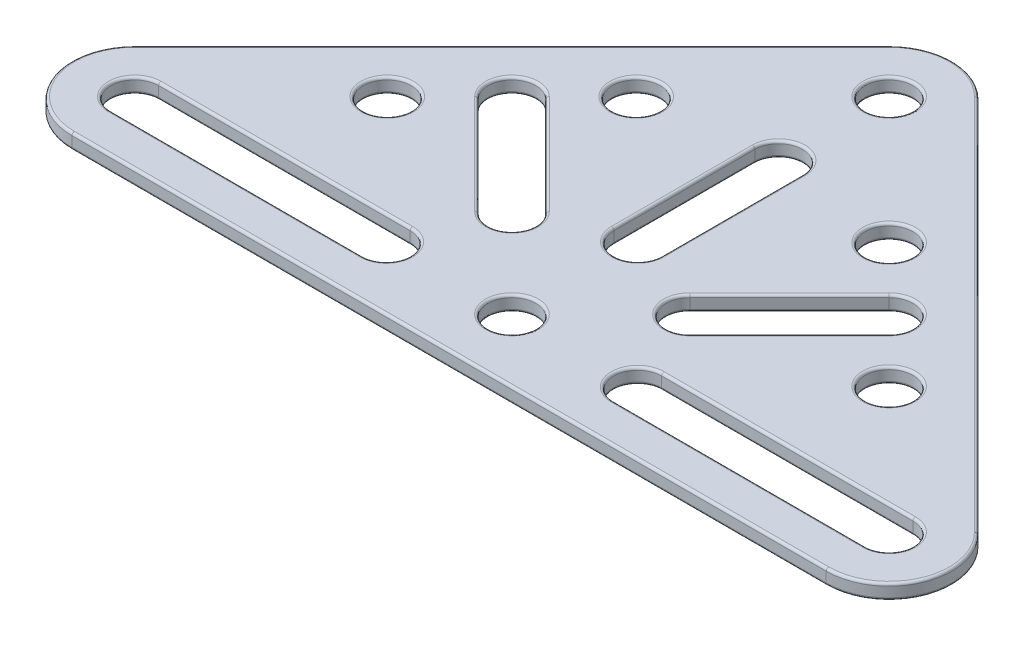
ISO-10303-21;
HEADER;
FILE_DESCRIPTION(('STEP AP214'),'2;1');
FILE_NAME('part.step','',(''),(''),'','','');
FILE_SCHEMA(('AUTOMOTIVE_DESIGN { 1 0 10303 214 1 1 1 1 }'));
ENDSEC;
DATA;
#1=APPLICATION_CONTEXT('core data for automotive mechanical design processes');
#2=APPLICATION_PROTOCOL_DEFINITION('international standard','automotive_design',2000,#1);
#3=PRODUCT_CONTEXT('',#1,'mechanical');
#4=PRODUCT('Part','Part','',(#3));
#5=PRODUCT_RELATED_PRODUCT_CATEGORY('part','',(#4));
#6=PRODUCT_DEFINITION_FORMATION('','',#4);
#7=PRODUCT_DEFINITION_CONTEXT('part definition',#1,'design');
#8=PRODUCT_DEFINITION('design','',#6,#7);
#9=PRODUCT_DEFINITION_SHAPE('','',#8);
#10=(LENGTH_UNIT() NAMED_UNIT(*) SI_UNIT(.MILLI.,.METRE.));
#11=(NAMED_UNIT(*) PLANE_ANGLE_UNIT() SI_UNIT($,.RADIAN.));
#12=(NAMED_UNIT(*) SI_UNIT($,.STERADIAN.) SOLID_ANGLE_UNIT());
#13=UNCERTAINTY_MEASURE_WITH_UNIT(LENGTH_MEASURE(1.E-05),#10,'distance_accuracy_value','');
#14=(GEOMETRIC_REPRESENTATION_CONTEXT(3) GLOBAL_UNCERTAINTY_ASSIGNED_CONTEXT((#13)) GLOBAL_UNIT_ASSIGNED_CONTEXT((#10,
#11,#12)) REPRESENTATION_CONTEXT('',''));
#15=CARTESIAN_POINT('',(0.,0.,0.));
#16=DIRECTION('',(0.,0.,1.));
#17=DIRECTION('',(1.,0.,0.));
#18=AXIS2_PLACEMENT_3D('',#15,#16,#17);
#19=CARTESIAN_POINT('',(53.4302561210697,1.524,-44.45));
#20=DIRECTION('',(0.,1.,0.));
#21=DIRECTION('',(0.,0.,1.));
#22=AXIS2_PLACEMENT_3D('',#19,#20,#21);
#23=PLANE('',#22);
#24=CARTESIAN_POINT('',(66.2059338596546,1.524,-31.6743222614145));
#25=DIRECTION('',(0.,1.,0.));
#26=DIRECTION('',(0.,0.,1.));
#27=AXIS2_PLACEMENT_3D('',#24,#25,#26);
#28=CIRCLE('',#27,2.66699999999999);
#29=CARTESIAN_POINT('',(66.2059338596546,1.524,-29.0073222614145));
#30=VERTEX_POINT('',#29);
#31=EDGE_CURVE('E11',#30,#30,#28,.F.);
#32=ORIENTED_EDGE('',*,*,#31,.T.);
#33=EDGE_LOOP('',(#32));
#34=FACE_BOUND('',#33,.T.);
#35=DIRECTION('',(-1.,0.,0.));
#36=VECTOR('',#35,1.);
#37=CARTESIAN_POINT('',(53.4302561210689,1.524,-3.68300000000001));
#38=LINE('',#37,#36);
#39=CARTESIAN_POINT('',(91.5302561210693,1.524,-3.68299999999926));
#40=VERTEX_POINT('',#39);
#41=CARTESIAN_POINT('',(66.1302561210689,1.524,-3.68299999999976));
#42=VERTEX_POINT('',#41);
#43=EDGE_CURVE('E51',#40,#42,#38,.T.);
#44=ORIENTED_EDGE('',*,*,#43,.T.);
#45=CARTESIAN_POINT('',(66.1302561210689,1.524,-6.34999999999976));
#46=DIRECTION('',(0.,1.,0.));
#47=DIRECTION('',(0.,0.,1.));
#48=AXIS2_PLACEMENT_3D('',#45,#46,#47);
#49=CIRCLE('',#48,2.667);
#50=CARTESIAN_POINT('',(66.130256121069,1.524,-9.01699999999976));
#51=VERTEX_POINT('',#50);
#52=EDGE_CURVE('E44',#42,#51,#49,.F.);
#53=ORIENTED_EDGE('',*,*,#52,.T.);
#54=DIRECTION('',(1.,0.,0.));
#55=VECTOR('',#54,1.);
#56=CARTESIAN_POINT('',(53.430256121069,1.524,-9.017));
#57=LINE('',#56,#55);
#58=CARTESIAN_POINT('',(91.5302561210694,1.524,-9.01699999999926));
#59=VERTEX_POINT('',#58);
#60=EDGE_CURVE('E665',#51,#59,#57,.T.);
#61=ORIENTED_EDGE('',*,*,#60,.T.);
#62=CARTESIAN_POINT('',(91.5302561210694,1.524,-6.34999999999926));
#63=DIRECTION('',(0.,1.,0.));
#64=DIRECTION('',(0.,0.,1.));
#65=AXIS2_PLACEMENT_3D('',#62,#63,#64);
#66=CIRCLE('',#65,2.667);
#67=EDGE_CURVE('E56',#59,#40,#66,.F.);
#68=ORIENTED_EDGE('',*,*,#67,.T.);
#69=EDGE_LOOP('',(#44,#53,#61,#68));
#70=FACE_BOUND('',#69,.T.);
#71=CARTESIAN_POINT('',(40.6545783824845,1.524,-31.6743222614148));
#72=DIRECTION('',(0.,1.,0.));
#73=DIRECTION('',(0.,0.,1.));
#74=AXIS2_PLACEMENT_3D('',#71,#72,#73);
#75=CIRCLE('',#74,2.66699999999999);
#76=CARTESIAN_POINT('',(40.6545783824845,1.524,-29.0073222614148));
#77=VERTEX_POINT('',#76);
#78=EDGE_CURVE('E662',#77,#77,#75,.F.);
#79=ORIENTED_EDGE('',*,*,#78,.T.);
#80=EDGE_LOOP('',(#79));
#81=FACE_BOUND('',#80,.T.);
#82=CARTESIAN_POINT('',(28.0822198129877,1.524,-19.101963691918));
#83=DIRECTION('',(0.,1.,0.));
#84=DIRECTION('',(0.,0.,1.));
#85=AXIS2_PLACEMENT_3D('',#82,#83,#84);
#86=CIRCLE('',#85,2.667);
#87=CARTESIAN_POINT('',(28.0822198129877,1.524,-16.434963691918));
#88=VERTEX_POINT('',#87);
#89=EDGE_CURVE('E659',#88,#88,#86,.F.);
#90=ORIENTED_EDGE('',*,*,#89,.T.);
#91=EDGE_LOOP('',(#90));
#92=FACE_BOUND('',#91,.T.);
#93=CARTESIAN_POINT('',(40.7302561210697,1.524,-6.35));
#94=DIRECTION('',(0.,1.,0.));
#95=DIRECTION('',(0.,0.,1.));
#96=AXIS2_PLACEMENT_3D('',#93,#94,#95);
#97=CIRCLE('',#96,2.667);
#98=CARTESIAN_POINT('',(40.7302561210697,1.524,-9.017));
#99=VERTEX_POINT('',#98);
#100=CARTESIAN_POINT('',(40.7302561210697,1.524,-3.683));
#101=VERTEX_POINT('',#100);
#102=EDGE_CURVE('E654',#99,#101,#97,.F.);
#103=ORIENTED_EDGE('',*,*,#102,.T.);
#104=DIRECTION('',(1.,0.,0.));
#105=VECTOR('',#104,1.);
#106=CARTESIAN_POINT('',(15.3302561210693,1.524,-3.683));
#107=LINE('',#106,#105);
#108=CARTESIAN_POINT('',(15.3302561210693,1.524,-3.683));
#109=VERTEX_POINT('',#108);
#110=EDGE_CURVE('E656',#101,#109,#107,.F.);
#111=ORIENTED_EDGE('',*,*,#110,.T.);
#112=CARTESIAN_POINT('',(15.3302561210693,1.524,-6.35));
#113=DIRECTION('',(0.,1.,0.));
#114=DIRECTION('',(0.,0.,1.));
#115=AXIS2_PLACEMENT_3D('',#112,#113,#114);
#116=CIRCLE('',#115,2.667);
#117=CARTESIAN_POINT('',(15.3302561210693,1.524,-9.017));
#118=VERTEX_POINT('',#117);
#119=EDGE_CURVE('E650',#109,#118,#116,.F.);
#120=ORIENTED_EDGE('',*,*,#119,.T.);
#121=DIRECTION('',(-1.,0.,0.));
#122=VECTOR('',#121,1.);
#123=CARTESIAN_POINT('',(40.7302561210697,1.524,-9.017));
#124=LINE('',#123,#122);
#125=EDGE_CURVE('E652',#118,#99,#124,.F.);
#126=ORIENTED_EDGE('',*,*,#125,.T.);
#127=EDGE_LOOP('',(#103,#111,#120,#126));
#128=FACE_BOUND('',#127,.T.);
#129=CARTESIAN_POINT('',(44.4381429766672,1.524,-15.3421131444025));
#130=DIRECTION('',(0.,1.,0.));
#131=DIRECTION('',(0.,0.,1.));
#132=AXIS2_PLACEMENT_3D('',#129,#130,#131);
#133=CIRCLE('',#132,2.667);
#134=CARTESIAN_POINT('',(46.3239967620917,1.524,-17.227966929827));
#135=VERTEX_POINT('',#134);
#136=CARTESIAN_POINT('',(42.5522891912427,1.524,-13.4562593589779));
#137=VERTEX_POINT('',#136);
#138=EDGE_CURVE('E645',#135,#137,#133,.F.);
#139=ORIENTED_EDGE('',*,*,#138,.T.);
#140=DIRECTION('',(0.70710678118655,0.,0.707106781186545));
#141=VECTOR('',#140,1.);
#142=CARTESIAN_POINT('',(32.4944023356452,1.524,-23.5141462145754));
#143=LINE('',#142,#141);
#144=CARTESIAN_POINT('',(32.4944023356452,1.524,-23.5141462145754));
#145=VERTEX_POINT('',#144);
#146=EDGE_CURVE('E647',#137,#145,#143,.F.);
#147=ORIENTED_EDGE('',*,*,#146,.T.);
#148=CARTESIAN_POINT('',(34.3802561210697,1.524,-25.3999999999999));
#149=DIRECTION('',(0.,1.,0.));
#150=DIRECTION('',(0.,0.,1.));
#151=AXIS2_PLACEMENT_3D('',#148,#149,#150);
#152=CIRCLE('',#151,2.66700000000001);
#153=CARTESIAN_POINT('',(36.2661099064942,1.524,-27.2858537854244));
#154=VERTEX_POINT('',#153);
#155=EDGE_CURVE('E641',#145,#154,#152,.F.);
#156=ORIENTED_EDGE('',*,*,#155,.T.);
#157=DIRECTION('',(-0.70710678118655,0.,-0.707106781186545));
#158=VECTOR('',#157,1.);
#159=CARTESIAN_POINT('',(46.3239967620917,1.524,-17.227966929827));
#160=LINE('',#159,#158);
#161=EDGE_CURVE('E643',#154,#135,#160,.F.);
#162=ORIENTED_EDGE('',*,*,#161,.T.);
#163=EDGE_LOOP('',(#139,#147,#156,#162));
#164=FACE_BOUND('',#163,.T.);
#165=CARTESIAN_POINT('',(53.4302561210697,1.524,-19.0667683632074));
#166=DIRECTION('',(0.,1.,0.));
#167=DIRECTION('',(0.,0.,1.));
#168=AXIS2_PLACEMENT_3D('',#165,#166,#167);
#169=CIRCLE('',#168,2.667);
#170=CARTESIAN_POINT('',(56.0972561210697,1.524,-19.0667683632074));
#171=VERTEX_POINT('',#170);
#172=CARTESIAN_POINT('',(50.7632561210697,1.524,-19.0667683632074));
#173=VERTEX_POINT('',#172);
#174=EDGE_CURVE('E636',#171,#173,#169,.F.);
#175=ORIENTED_EDGE('',*,*,#174,.T.);
#176=DIRECTION('',(0.,0.,1.));
#177=VECTOR('',#176,1.);
#178=CARTESIAN_POINT('',(50.7632561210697,1.524,-33.2907683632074));
#179=LINE('',#178,#177);
#180=CARTESIAN_POINT('',(50.7632561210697,1.524,-33.2907683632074));
#181=VERTEX_POINT('',#180);
#182=EDGE_CURVE('E638',#173,#181,#179,.F.);
#183=ORIENTED_EDGE('',*,*,#182,.T.);
#184=CARTESIAN_POINT('',(53.4302561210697,1.524,-33.2907683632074));
#185=DIRECTION('',(0.,1.,0.));
#186=DIRECTION('',(0.,0.,1.));
#187=AXIS2_PLACEMENT_3D('',#184,#185,#186);
#188=CIRCLE('',#187,2.66700000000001);
#189=CARTESIAN_POINT('',(56.0972561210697,1.524,-33.2907683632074));
#190=VERTEX_POINT('',#189);
#191=EDGE_CURVE('E632',#181,#190,#188,.F.);
#192=ORIENTED_EDGE('',*,*,#191,.T.);
#193=DIRECTION('',(0.,0.,-1.));
#194=VECTOR('',#193,1.);
#195=CARTESIAN_POINT('',(56.0972561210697,1.524,-19.0667683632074));
#196=LINE('',#195,#194);
#197=EDGE_CURVE('E634',#190,#171,#196,.F.);
#198=ORIENTED_EDGE('',*,*,#197,.T.);
#199=EDGE_LOOP('',(#175,#183,#192,#198));
#200=FACE_BOUND('',#199,.T.);
#201=CARTESIAN_POINT('',(62.4223692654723,1.524,-15.3421131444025));
#202=DIRECTION('',(0.,1.,0.));
#203=DIRECTION('',(0.,0.,1.));
#204=AXIS2_PLACEMENT_3D('',#201,#202,#203);
#205=CIRCLE('',#204,2.667);
#206=CARTESIAN_POINT('',(64.3082230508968,1.524,-13.456259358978));
#207=VERTEX_POINT('',#206);
#208=CARTESIAN_POINT('',(60.5365154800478,1.524,-17.227966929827));
#209=VERTEX_POINT('',#208);
#210=EDGE_CURVE('E627',#207,#209,#205,.F.);
#211=ORIENTED_EDGE('',*,*,#210,.T.);
#212=DIRECTION('',(-0.707106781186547,0.,0.707106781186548));
#213=VECTOR('',#212,1.);
#214=CARTESIAN_POINT('',(70.5944023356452,1.524,-27.2858537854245));
#215=LINE('',#214,#213);
#216=CARTESIAN_POINT('',(70.5944023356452,1.524,-27.2858537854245));
#217=VERTEX_POINT('',#216);
#218=EDGE_CURVE('E629',#209,#217,#215,.F.);
#219=ORIENTED_EDGE('',*,*,#218,.T.);
#220=CARTESIAN_POINT('',(72.4802561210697,1.524,-25.4));
#221=DIRECTION('',(0.,1.,0.));
#222=DIRECTION('',(0.,0.,1.));
#223=AXIS2_PLACEMENT_3D('',#220,#221,#222);
#224=CIRCLE('',#223,2.66700000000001);
#225=CARTESIAN_POINT('',(74.3661099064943,1.524,-23.5141462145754));
#226=VERTEX_POINT('',#225);
#227=EDGE_CURVE('E623',#217,#226,#224,.F.);
#228=ORIENTED_EDGE('',*,*,#227,.T.);
#229=DIRECTION('',(0.707106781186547,0.,-0.707106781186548));
#230=VECTOR('',#229,1.);
#231=CARTESIAN_POINT('',(64.3082230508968,1.524,-13.456259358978));
#232=LINE('',#231,#230);
#233=EDGE_CURVE('E625',#226,#207,#232,.F.);
#234=ORIENTED_EDGE('',*,*,#233,.T.);
#235=EDGE_LOOP('',(#211,#219,#228,#234));
#236=FACE_BOUND('',#235,.T.);
#237=CARTESIAN_POINT('',(53.4302561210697,1.524,-44.45));
#238=DIRECTION('',(0.,1.,0.));
#239=DIRECTION('',(0.,0.,1.));
#240=AXIS2_PLACEMENT_3D('',#237,#238,#239);
#241=CIRCLE('',#240,2.667);
#242=CARTESIAN_POINT('',(53.4302561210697,1.524,-41.783));
#243=VERTEX_POINT('',#242);
#244=EDGE_CURVE('E620',#243,#243,#241,.F.);
#245=ORIENTED_EDGE('',*,*,#244,.T.);
#246=EDGE_LOOP('',(#245));
#247=FACE_BOUND('',#246,.T.);
#248=CARTESIAN_POINT('',(91.5302561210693,1.524,-6.35));
#249=DIRECTION('',(0.,1.,0.));
#250=DIRECTION('',(0.,0.,1.));
#251=AXIS2_PLACEMENT_3D('',#248,#249,#250);
#252=CIRCLE('',#251,6.09599999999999);
#253=CARTESIAN_POINT('',(91.5302561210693,1.524,-0.253999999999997));
#254=VERTEX_POINT('',#253);
#255=CARTESIAN_POINT('',(95.8407790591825,1.524,-10.6605229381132));
#256=VERTEX_POINT('',#255);
#257=EDGE_CURVE('E615',#254,#256,#252,.T.);
#258=ORIENTED_EDGE('',*,*,#257,.T.);
#259=DIRECTION('',(-0.707106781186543,0.,-0.707106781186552));
#260=VECTOR('',#259,1.);
#261=CARTESIAN_POINT('',(57.7407790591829,1.524,-48.7605229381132));
#262=LINE('',#261,#260);
#263=CARTESIAN_POINT('',(57.7407790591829,1.524,-48.7605229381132));
#264=VERTEX_POINT('',#263);
#265=EDGE_CURVE('E617',#256,#264,#262,.T.);
#266=ORIENTED_EDGE('',*,*,#265,.T.);
#267=CARTESIAN_POINT('',(53.4302561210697,1.524,-44.45));
#268=DIRECTION('',(0.,1.,0.));
#269=DIRECTION('',(0.,0.,1.));
#270=AXIS2_PLACEMENT_3D('',#267,#268,#269);
#271=CIRCLE('',#270,6.09600000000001);
#272=CARTESIAN_POINT('',(49.1197331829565,1.524,-48.7605229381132));
#273=VERTEX_POINT('',#272);
#274=EDGE_CURVE('E607',#264,#273,#271,.T.);
#275=ORIENTED_EDGE('',*,*,#274,.T.);
#276=DIRECTION('',(-0.707106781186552,0.,0.707106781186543));
#277=VECTOR('',#276,1.);
#278=CARTESIAN_POINT('',(11.0197331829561,1.524,-10.6605229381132));
#279=LINE('',#278,#277);
#280=CARTESIAN_POINT('',(11.0197331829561,1.524,-10.6605229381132));
#281=VERTEX_POINT('',#280);
#282=EDGE_CURVE('E609',#273,#281,#279,.T.);
#283=ORIENTED_EDGE('',*,*,#282,.T.);
#284=CARTESIAN_POINT('',(15.3302561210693,1.524,-6.35));
#285=DIRECTION('',(0.,1.,0.));
#286=DIRECTION('',(0.,0.,1.));
#287=AXIS2_PLACEMENT_3D('',#284,#285,#286);
#288=CIRCLE('',#287,6.096);
#289=CARTESIAN_POINT('',(15.3302561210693,1.524,-0.253999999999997));
#290=VERTEX_POINT('',#289);
#291=EDGE_CURVE('E611',#281,#290,#288,.T.);
#292=ORIENTED_EDGE('',*,*,#291,.T.);
#293=DIRECTION('',(1.,0.,0.));
#294=VECTOR('',#293,1.);
#295=CARTESIAN_POINT('',(91.5302561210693,1.524,-0.253999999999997));
#296=LINE('',#295,#294);
#297=EDGE_CURVE('E613',#290,#254,#296,.T.);
#298=ORIENTED_EDGE('',*,*,#297,.T.);
#299=EDGE_LOOP('',(#258,#266,#275,#283,#292,#298));
#300=FACE_BOUND('',#299,.T.);
#301=CARTESIAN_POINT('',(53.4302561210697,1.524,-6.34999999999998));
#302=DIRECTION('',(0.,1.,0.));
#303=DIRECTION('',(0.,0.,1.));
#304=AXIS2_PLACEMENT_3D('',#301,#302,#303);
#305=CIRCLE('',#304,2.667);
#306=CARTESIAN_POINT('',(53.4302561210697,1.524,-3.68299999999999));
#307=VERTEX_POINT('',#306);
#308=EDGE_CURVE('E604',#307,#307,#305,.F.);
#309=ORIENTED_EDGE('',*,*,#308,.T.);
#310=EDGE_LOOP('',(#309));
#311=FACE_BOUND('',#310,.T.);
#312=CARTESIAN_POINT('',(78.7782924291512,1.524,-19.1019636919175));
#313=DIRECTION('',(0.,1.,0.));
#314=DIRECTION('',(0.,0.,1.));
#315=AXIS2_PLACEMENT_3D('',#312,#313,#314);
#316=CIRCLE('',#315,2.667);
#317=CARTESIAN_POINT('',(78.7782924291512,1.524,-16.4349636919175));
#318=VERTEX_POINT('',#317);
#319=EDGE_CURVE('E600',#318,#318,#316,.F.);
#320=ORIENTED_EDGE('',*,*,#319,.T.);
#321=EDGE_LOOP('',(#320));
#322=FACE_BOUND('',#321,.T.);
#323=ADVANCED_FACE('F36',(#34,#70,#81,#92,#128,#164,#200,#236,#247,#300,#311,#322),#23,.T.);
#324=CARTESIAN_POINT('',(53.4302561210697,0.,-44.45));
#325=DIRECTION('',(0.,1.,0.));
#326=DIRECTION('',(0.,0.,1.));
#327=AXIS2_PLACEMENT_3D('',#324,#325,#326);
#328=PLANE('',#327);
#329=CARTESIAN_POINT('',(66.2059338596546,0.,-31.6743222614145));
#330=DIRECTION('',(0.,1.,0.));
#331=DIRECTION('',(0.,0.,1.));
#332=AXIS2_PLACEMENT_3D('',#329,#330,#331);
#333=CIRCLE('',#332,2.66699999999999);
#334=CARTESIAN_POINT('',(66.2059338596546,0.,-29.0073222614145));
#335=VERTEX_POINT('',#334);
#336=EDGE_CURVE('E452',#335,#335,#333,.T.);
#337=ORIENTED_EDGE('',*,*,#336,.T.);
#338=EDGE_LOOP('',(#337));
#339=FACE_BOUND('',#338,.T.);
#340=CARTESIAN_POINT('',(66.1302561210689,0.,-6.34999999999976));
#341=DIRECTION('',(0.,1.,0.));
#342=DIRECTION('',(0.,0.,1.));
#343=AXIS2_PLACEMENT_3D('',#340,#341,#342);
#344=CIRCLE('',#343,2.667);
#345=CARTESIAN_POINT('',(66.130256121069,0.,-9.01699999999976));
#346=VERTEX_POINT('',#345);
#347=CARTESIAN_POINT('',(66.1302561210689,0.,-3.68299999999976));
#348=VERTEX_POINT('',#347);
#349=EDGE_CURVE('E447',#346,#348,#344,.T.);
#350=ORIENTED_EDGE('',*,*,#349,.T.);
#351=DIRECTION('',(-1.,0.,0.));
#352=VECTOR('',#351,1.);
#353=CARTESIAN_POINT('',(91.5302561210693,0.,-3.68299999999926));
#354=LINE('',#353,#352);
#355=CARTESIAN_POINT('',(91.5302561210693,0.,-3.68299999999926));
#356=VERTEX_POINT('',#355);
#357=EDGE_CURVE('E449',#348,#356,#354,.F.);
#358=ORIENTED_EDGE('',*,*,#357,.T.);
#359=CARTESIAN_POINT('',(91.5302561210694,0.,-6.34999999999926));
#360=DIRECTION('',(0.,1.,0.));
#361=DIRECTION('',(0.,0.,1.));
#362=AXIS2_PLACEMENT_3D('',#359,#360,#361);
#363=CIRCLE('',#362,2.667);
#364=CARTESIAN_POINT('',(91.5302561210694,0.,-9.01699999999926));
#365=VERTEX_POINT('',#364);
#366=EDGE_CURVE('E443',#356,#365,#363,.T.);
#367=ORIENTED_EDGE('',*,*,#366,.T.);
#368=DIRECTION('',(1.,0.,0.));
#369=VECTOR('',#368,1.);
#370=CARTESIAN_POINT('',(66.130256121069,0.,-9.01699999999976));
#371=LINE('',#370,#369);
#372=EDGE_CURVE('E445',#365,#346,#371,.F.);
#373=ORIENTED_EDGE('',*,*,#372,.T.);
#374=EDGE_LOOP('',(#350,#358,#367,#373));
#375=FACE_BOUND('',#374,.T.);
#376=CARTESIAN_POINT('',(40.6545783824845,0.,-31.6743222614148));
#377=DIRECTION('',(0.,1.,0.));
#378=DIRECTION('',(0.,0.,1.));
#379=AXIS2_PLACEMENT_3D('',#376,#377,#378);
#380=CIRCLE('',#379,2.66699999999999);
#381=CARTESIAN_POINT('',(40.6545783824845,0.,-29.0073222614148));
#382=VERTEX_POINT('',#381);
#383=EDGE_CURVE('E440',#382,#382,#380,.T.);
#384=ORIENTED_EDGE('',*,*,#383,.T.);
#385=EDGE_LOOP('',(#384));
#386=FACE_BOUND('',#385,.T.);
#387=CARTESIAN_POINT('',(28.0822198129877,0.,-19.101963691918));
#388=DIRECTION('',(0.,1.,0.));
#389=DIRECTION('',(0.,0.,1.));
#390=AXIS2_PLACEMENT_3D('',#387,#388,#389);
#391=CIRCLE('',#390,2.667);
#392=CARTESIAN_POINT('',(28.0822198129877,0.,-16.434963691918));
#393=VERTEX_POINT('',#392);
#394=EDGE_CURVE('E437',#393,#393,#391,.T.);
#395=ORIENTED_EDGE('',*,*,#394,.T.);
#396=EDGE_LOOP('',(#395));
#397=FACE_BOUND('',#396,.T.);
#398=DIRECTION('',(1.,0.,0.));
#399=VECTOR('',#398,1.);
#400=CARTESIAN_POINT('',(53.4302561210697,0.,-3.68300000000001));
#401=LINE('',#400,#399);
#402=CARTESIAN_POINT('',(15.3302561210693,0.,-3.683));
#403=VERTEX_POINT('',#402);
#404=CARTESIAN_POINT('',(40.7302561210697,0.,-3.683));
#405=VERTEX_POINT('',#404);
#406=EDGE_CURVE('E432',#403,#405,#401,.T.);
#407=ORIENTED_EDGE('',*,*,#406,.T.);
#408=CARTESIAN_POINT('',(40.7302561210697,0.,-6.35));
#409=DIRECTION('',(0.,1.,0.));
#410=DIRECTION('',(0.,0.,1.));
#411=AXIS2_PLACEMENT_3D('',#408,#409,#410);
#412=CIRCLE('',#411,2.667);
#413=CARTESIAN_POINT('',(40.7302561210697,0.,-9.017));
#414=VERTEX_POINT('',#413);
#415=EDGE_CURVE('E434',#405,#414,#412,.T.);
#416=ORIENTED_EDGE('',*,*,#415,.T.);
#417=DIRECTION('',(-1.,0.,0.));
#418=VECTOR('',#417,1.);
#419=CARTESIAN_POINT('',(53.4302561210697,0.,-9.017));
#420=LINE('',#419,#418);
#421=CARTESIAN_POINT('',(15.3302561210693,0.,-9.017));
#422=VERTEX_POINT('',#421);
#423=EDGE_CURVE('E428',#414,#422,#420,.T.);
#424=ORIENTED_EDGE('',*,*,#423,.T.);
#425=CARTESIAN_POINT('',(15.3302561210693,0.,-6.35));
#426=DIRECTION('',(0.,1.,0.));
#427=DIRECTION('',(0.,0.,1.));
#428=AXIS2_PLACEMENT_3D('',#425,#426,#427);
#429=CIRCLE('',#428,2.667);
#430=EDGE_CURVE('E430',#422,#403,#429,.T.);
#431=ORIENTED_EDGE('',*,*,#430,.T.);
#432=EDGE_LOOP('',(#407,#416,#424,#431));
#433=FACE_BOUND('',#432,.T.);
#434=DIRECTION('',(0.70710678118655,0.,0.707106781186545));
#435=VECTOR('',#434,1.);
#436=CARTESIAN_POINT('',(32.4944023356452,0.,-23.5141462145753));
#437=LINE('',#436,#435);
#438=CARTESIAN_POINT('',(32.4944023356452,0.,-23.5141462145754));
#439=VERTEX_POINT('',#438);
#440=CARTESIAN_POINT('',(42.5522891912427,0.,-13.4562593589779));
#441=VERTEX_POINT('',#440);
#442=EDGE_CURVE('E423',#439,#441,#437,.T.);
#443=ORIENTED_EDGE('',*,*,#442,.T.);
#444=CARTESIAN_POINT('',(44.4381429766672,0.,-15.3421131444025));
#445=DIRECTION('',(0.,1.,0.));
#446=DIRECTION('',(0.,0.,1.));
#447=AXIS2_PLACEMENT_3D('',#444,#445,#446);
#448=CIRCLE('',#447,2.667);
#449=CARTESIAN_POINT('',(46.3239967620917,0.,-17.227966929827));
#450=VERTEX_POINT('',#449);
#451=EDGE_CURVE('E425',#441,#450,#448,.T.);
#452=ORIENTED_EDGE('',*,*,#451,.T.);
#453=DIRECTION('',(-0.70710678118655,0.,-0.707106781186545));
#454=VECTOR('',#453,1.);
#455=CARTESIAN_POINT('',(36.2661099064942,0.,-27.2858537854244));
#456=LINE('',#455,#454);
#457=CARTESIAN_POINT('',(36.2661099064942,0.,-27.2858537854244));
#458=VERTEX_POINT('',#457);
#459=EDGE_CURVE('E419',#450,#458,#456,.T.);
#460=ORIENTED_EDGE('',*,*,#459,.T.);
#461=CARTESIAN_POINT('',(34.3802561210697,0.,-25.3999999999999));
#462=DIRECTION('',(0.,1.,0.));
#463=DIRECTION('',(0.,0.,1.));
#464=AXIS2_PLACEMENT_3D('',#461,#462,#463);
#465=CIRCLE('',#464,2.66700000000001);
#466=EDGE_CURVE('E421',#458,#439,#465,.T.);
#467=ORIENTED_EDGE('',*,*,#466,.T.);
#468=EDGE_LOOP('',(#443,#452,#460,#467));
#469=FACE_BOUND('',#468,.T.);
#470=DIRECTION('',(0.,0.,1.));
#471=VECTOR('',#470,1.);
#472=CARTESIAN_POINT('',(50.7632561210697,0.,-44.45));
#473=LINE('',#472,#471);
#474=CARTESIAN_POINT('',(50.7632561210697,0.,-33.2907683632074));
#475=VERTEX_POINT('',#474);
#476=CARTESIAN_POINT('',(50.7632561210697,0.,-19.0667683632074));
#477=VERTEX_POINT('',#476);
#478=EDGE_CURVE('E414',#475,#477,#473,.T.);
#479=ORIENTED_EDGE('',*,*,#478,.T.);
#480=CARTESIAN_POINT('',(53.4302561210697,0.,-19.0667683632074));
#481=DIRECTION('',(0.,1.,0.));
#482=DIRECTION('',(0.,0.,1.));
#483=AXIS2_PLACEMENT_3D('',#480,#481,#482);
#484=CIRCLE('',#483,2.667);
#485=CARTESIAN_POINT('',(56.0972561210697,0.,-19.0667683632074));
#486=VERTEX_POINT('',#485);
#487=EDGE_CURVE('E416',#477,#486,#484,.T.);
#488=ORIENTED_EDGE('',*,*,#487,.T.);
#489=DIRECTION('',(0.,0.,-1.));
#490=VECTOR('',#489,1.);
#491=CARTESIAN_POINT('',(56.0972561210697,0.,-44.45));
#492=LINE('',#491,#490);
#493=CARTESIAN_POINT('',(56.0972561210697,0.,-33.2907683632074));
#494=VERTEX_POINT('',#493);
#495=EDGE_CURVE('E410',#486,#494,#492,.T.);
#496=ORIENTED_EDGE('',*,*,#495,.T.);
#497=CARTESIAN_POINT('',(53.4302561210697,0.,-33.2907683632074));
#498=DIRECTION('',(0.,1.,0.));
#499=DIRECTION('',(0.,0.,1.));
#500=AXIS2_PLACEMENT_3D('',#497,#498,#499);
#501=CIRCLE('',#500,2.66700000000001);
#502=EDGE_CURVE('E412',#494,#475,#501,.T.);
#503=ORIENTED_EDGE('',*,*,#502,.T.);
#504=EDGE_LOOP('',(#479,#488,#496,#503));
#505=FACE_BOUND('',#504,.T.);
#506=DIRECTION('',(-0.707106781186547,0.,0.707106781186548));
#507=VECTOR('',#506,1.);
#508=CARTESIAN_POINT('',(70.5944023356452,0.,-27.2858537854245));
#509=LINE('',#508,#507);
#510=CARTESIAN_POINT('',(70.5944023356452,0.,-27.2858537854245));
#511=VERTEX_POINT('',#510);
#512=CARTESIAN_POINT('',(60.5365154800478,0.,-17.227966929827));
#513=VERTEX_POINT('',#512);
#514=EDGE_CURVE('E405',#511,#513,#509,.T.);
#515=ORIENTED_EDGE('',*,*,#514,.T.);
#516=CARTESIAN_POINT('',(62.4223692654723,0.,-15.3421131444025));
#517=DIRECTION('',(0.,1.,0.));
#518=DIRECTION('',(0.,0.,1.));
#519=AXIS2_PLACEMENT_3D('',#516,#517,#518);
#520=CIRCLE('',#519,2.667);
#521=CARTESIAN_POINT('',(64.3082230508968,0.,-13.456259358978));
#522=VERTEX_POINT('',#521);
#523=EDGE_CURVE('E407',#513,#522,#520,.T.);
#524=ORIENTED_EDGE('',*,*,#523,.T.);
#525=DIRECTION('',(0.707106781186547,0.,-0.707106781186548));
#526=VECTOR('',#525,1.);
#527=CARTESIAN_POINT('',(74.3661099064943,0.,-23.5141462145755));
#528=LINE('',#527,#526);
#529=CARTESIAN_POINT('',(74.3661099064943,0.,-23.5141462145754));
#530=VERTEX_POINT('',#529);
#531=EDGE_CURVE('E396',#522,#530,#528,.T.);
#532=ORIENTED_EDGE('',*,*,#531,.T.);
#533=CARTESIAN_POINT('',(72.4802561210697,0.,-25.4));
#534=DIRECTION('',(0.,1.,0.));
#535=DIRECTION('',(0.,0.,1.));
#536=AXIS2_PLACEMENT_3D('',#533,#534,#535);
#537=CIRCLE('',#536,2.66700000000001);
#538=EDGE_CURVE('E403',#530,#511,#537,.T.);
#539=ORIENTED_EDGE('',*,*,#538,.T.);
#540=EDGE_LOOP('',(#515,#524,#532,#539));
#541=FACE_BOUND('',#540,.T.);
#542=CARTESIAN_POINT('',(53.4302561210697,0.,-44.45));
#543=DIRECTION('',(0.,1.,0.));
#544=DIRECTION('',(0.,0.,1.));
#545=AXIS2_PLACEMENT_3D('',#542,#543,#544);
#546=CIRCLE('',#545,2.667);
#547=CARTESIAN_POINT('',(53.4302561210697,0.,-41.783));
#548=VERTEX_POINT('',#547);
#549=EDGE_CURVE('E393',#548,#548,#546,.T.);
#550=ORIENTED_EDGE('',*,*,#549,.T.);
#551=EDGE_LOOP('',(#550));
#552=FACE_BOUND('',#551,.T.);
#553=CARTESIAN_POINT('',(15.3302561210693,0.,-6.35));
#554=DIRECTION('',(0.,1.,0.));
#555=DIRECTION('',(0.,0.,1.));
#556=AXIS2_PLACEMENT_3D('',#553,#554,#555);
#557=CIRCLE('',#556,6.096);
#558=CARTESIAN_POINT('',(15.3302561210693,0.,-0.254));
#559=VERTEX_POINT('',#558);
#560=CARTESIAN_POINT('',(11.0197331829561,0.,-10.6605229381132));
#561=VERTEX_POINT('',#560);
#562=EDGE_CURVE('E392',#559,#561,#557,.F.);
#563=ORIENTED_EDGE('',*,*,#562,.T.);
#564=DIRECTION('',(-0.707106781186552,0.,0.707106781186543));
#565=VECTOR('',#564,1.);
#566=CARTESIAN_POINT('',(49.1197331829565,0.,-48.7605229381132));
#567=LINE('',#566,#565);
#568=CARTESIAN_POINT('',(49.1197331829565,0.,-48.7605229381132));
#569=VERTEX_POINT('',#568);
#570=EDGE_CURVE('E370',#561,#569,#567,.F.);
#571=ORIENTED_EDGE('',*,*,#570,.T.);
#572=CARTESIAN_POINT('',(53.4302561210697,0.,-44.45));
#573=DIRECTION('',(0.,1.,0.));
#574=DIRECTION('',(0.,0.,1.));
#575=AXIS2_PLACEMENT_3D('',#572,#573,#574);
#576=CIRCLE('',#575,6.09600000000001);
#577=CARTESIAN_POINT('',(57.7407790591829,0.,-48.7605229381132));
#578=VERTEX_POINT('',#577);
#579=EDGE_CURVE('E380',#569,#578,#576,.F.);
#580=ORIENTED_EDGE('',*,*,#579,.T.);
#581=DIRECTION('',(-0.707106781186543,0.,-0.707106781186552));
#582=VECTOR('',#581,1.);
#583=CARTESIAN_POINT('',(57.7407790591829,0.,-48.7605229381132));
#584=LINE('',#583,#582);
#585=CARTESIAN_POINT('',(95.8407790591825,0.,-10.6605229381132));
#586=VERTEX_POINT('',#585);
#587=EDGE_CURVE('E386',#578,#586,#584,.F.);
#588=ORIENTED_EDGE('',*,*,#587,.T.);
#589=CARTESIAN_POINT('',(91.5302561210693,0.,-6.35));
#590=DIRECTION('',(0.,1.,0.));
#591=DIRECTION('',(0.,0.,1.));
#592=AXIS2_PLACEMENT_3D('',#589,#590,#591);
#593=CIRCLE('',#592,6.09599999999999);
#594=CARTESIAN_POINT('',(91.5302561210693,0.,-0.254000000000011));
#595=VERTEX_POINT('',#594);
#596=EDGE_CURVE('E844',#586,#595,#593,.F.);
#597=ORIENTED_EDGE('',*,*,#596,.T.);
#598=DIRECTION('',(1.,0.,0.));
#599=VECTOR('',#598,1.);
#600=CARTESIAN_POINT('',(53.4302561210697,0.,-0.253999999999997));
#601=LINE('',#600,#599);
#602=EDGE_CURVE('E398',#595,#559,#601,.F.);
#603=ORIENTED_EDGE('',*,*,#602,.T.);
#604=EDGE_LOOP('',(#563,#571,#580,#588,#597,#603));
#605=FACE_BOUND('',#604,.T.);
#606=CARTESIAN_POINT('',(53.4302561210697,0.,-6.34999999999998));
#607=DIRECTION('',(0.,1.,0.));
#608=DIRECTION('',(0.,0.,1.));
#609=AXIS2_PLACEMENT_3D('',#606,#607,#608);
#610=CIRCLE('',#609,2.667);
#611=CARTESIAN_POINT('',(53.4302561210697,0.,-3.68299999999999));
#612=VERTEX_POINT('',#611);
#613=EDGE_CURVE('E387',#612,#612,#610,.T.);
#614=ORIENTED_EDGE('',*,*,#613,.T.);
#615=EDGE_LOOP('',(#614));
#616=FACE_BOUND('',#615,.T.);
#617=CARTESIAN_POINT('',(78.7782924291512,0.,-19.1019636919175));
#618=DIRECTION('',(0.,1.,0.));
#619=DIRECTION('',(0.,0.,1.));
#620=AXIS2_PLACEMENT_3D('',#617,#618,#619);
#621=CIRCLE('',#620,2.667);
#622=CARTESIAN_POINT('',(78.7782924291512,0.,-16.4349636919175));
#623=VERTEX_POINT('',#622);
#624=EDGE_CURVE('E838',#623,#623,#621,.T.);
#625=ORIENTED_EDGE('',*,*,#624,.T.);
#626=EDGE_LOOP('',(#625));
#627=FACE_BOUND('',#626,.T.);
#628=ADVANCED_FACE('F389',(#339,#375,#386,#397,#433,#469,#505,#541,#552,#605,#616,#627),#328,.F.);
#629=CARTESIAN_POINT('',(53.4302561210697,1.524,-44.45));
#630=DIRECTION('',(0.,-1.,0.));
#631=DIRECTION('',(0.,0.,-1.));
#632=AXIS2_PLACEMENT_3D('',#629,#630,#631);
#633=CYLINDRICAL_SURFACE('',#632,6.35000000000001);
#634=DIRECTION('',(0.,-1.,0.));
#635=VECTOR('',#634,1.);
#636=CARTESIAN_POINT('',(57.9203841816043,1.524,-48.9401280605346));
#637=LINE('',#636,#635);
#638=CARTESIAN_POINT('',(57.9203841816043,1.27,-48.9401280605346));
#639=VERTEX_POINT('',#638);
#640=CARTESIAN_POINT('',(57.9203841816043,0.254000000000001,-48.9401280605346));
#641=VERTEX_POINT('',#640);
#642=EDGE_CURVE('E806',#639,#641,#637,.T.);
#643=ORIENTED_EDGE('',*,*,#642,.T.);
#644=CARTESIAN_POINT('',(53.4302561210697,0.254,-44.45));
#645=DIRECTION('',(0.,1.,0.));
#646=DIRECTION('',(0.,0.,1.));
#647=AXIS2_PLACEMENT_3D('',#644,#645,#646);
#648=CIRCLE('',#647,6.35000000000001);
#649=CARTESIAN_POINT('',(48.9401280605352,0.254000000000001,-48.9401280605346));
#650=VERTEX_POINT('',#649);
#651=EDGE_CURVE('E586',#641,#650,#648,.T.);
#652=ORIENTED_EDGE('',*,*,#651,.T.);
#653=DIRECTION('',(0.,-1.,0.));
#654=VECTOR('',#653,1.);
#655=CARTESIAN_POINT('',(48.9401280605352,1.524,-48.9401280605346));
#656=LINE('',#655,#654);
#657=CARTESIAN_POINT('',(48.9401280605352,1.27,-48.9401280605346));
#658=VERTEX_POINT('',#657);
#659=EDGE_CURVE('E829',#658,#650,#656,.T.);
#660=ORIENTED_EDGE('',*,*,#659,.F.);
#661=CARTESIAN_POINT('',(53.4302561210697,1.27,-44.45));
#662=DIRECTION('',(0.,1.,0.));
#663=DIRECTION('',(0.,0.,1.));
#664=AXIS2_PLACEMENT_3D('',#661,#662,#663);
#665=CIRCLE('',#664,6.35000000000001);
#666=EDGE_CURVE('E584',#658,#639,#665,.F.);
#667=ORIENTED_EDGE('',*,*,#666,.T.);
#668=EDGE_LOOP('',(#643,#652,#660,#667));
#669=FACE_BOUND('',#668,.T.);
#670=ADVANCED_FACE('F38',(#669),#633,.T.);
#671=CARTESIAN_POINT('',(48.9401280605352,1.524,-48.9401280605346));
#672=DIRECTION('',(0.707106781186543,0.,0.707106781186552));
#673=DIRECTION('',(0.707106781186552,0.,-0.707106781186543));
#674=AXIS2_PLACEMENT_3D('',#671,#672,#673);
#675=PLANE('',#674);
#676=ORIENTED_EDGE('',*,*,#659,.T.);
#677=DIRECTION('',(-0.707106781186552,0.,0.707106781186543));
#678=VECTOR('',#677,1.);
#679=CARTESIAN_POINT('',(48.9401280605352,0.254,-48.9401280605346));
#680=LINE('',#679,#678);
#681=CARTESIAN_POINT('',(10.8401280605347,0.254000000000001,-10.8401280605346));
#682=VERTEX_POINT('',#681);
#683=EDGE_CURVE('E373',#650,#682,#680,.T.);
#684=ORIENTED_EDGE('',*,*,#683,.T.);
#685=DIRECTION('',(0.,-1.,0.));
#686=VECTOR('',#685,1.);
#687=CARTESIAN_POINT('',(10.8401280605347,1.524,-10.8401280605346));
#688=LINE('',#687,#686);
#689=CARTESIAN_POINT('',(10.8401280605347,1.27,-10.8401280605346));
#690=VERTEX_POINT('',#689);
#691=EDGE_CURVE('E826',#690,#682,#688,.T.);
#692=ORIENTED_EDGE('',*,*,#691,.F.);
#693=DIRECTION('',(-0.707106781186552,0.,0.707106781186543));
#694=VECTOR('',#693,1.);
#695=CARTESIAN_POINT('',(48.9401280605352,1.27,-48.9401280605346));
#696=LINE('',#695,#694);
#697=EDGE_CURVE('E564',#690,#658,#696,.F.);
#698=ORIENTED_EDGE('',*,*,#697,.T.);
#699=EDGE_LOOP('',(#676,#684,#692,#698));
#700=FACE_BOUND('',#699,.T.);
#701=ADVANCED_FACE('F859',(#700),#675,.F.);
#702=CARTESIAN_POINT('',(15.3302561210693,1.524,-6.35));
#703=DIRECTION('',(0.,-1.,0.));
#704=DIRECTION('',(0.,0.,-1.));
#705=AXIS2_PLACEMENT_3D('',#702,#703,#704);
#706=CYLINDRICAL_SURFACE('',#705,6.35);
#707=ORIENTED_EDGE('',*,*,#691,.T.);
#708=CARTESIAN_POINT('',(15.3302561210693,0.254,-6.35));
#709=DIRECTION('',(0.,1.,0.));
#710=DIRECTION('',(0.,0.,1.));
#711=AXIS2_PLACEMENT_3D('',#708,#709,#710);
#712=CIRCLE('',#711,6.35);
#713=CARTESIAN_POINT('',(15.3302561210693,0.254000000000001,0.));
#714=VERTEX_POINT('',#713);
#715=EDGE_CURVE('E569',#682,#714,#712,.T.);
#716=ORIENTED_EDGE('',*,*,#715,.T.);
#717=DIRECTION('',(0.,-1.,0.));
#718=VECTOR('',#717,1.);
#719=CARTESIAN_POINT('',(15.3302561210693,1.524,0.));
#720=LINE('',#719,#718);
#721=CARTESIAN_POINT('',(15.3302561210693,1.27,0.));
#722=VERTEX_POINT('',#721);
#723=EDGE_CURVE('E823',#722,#714,#720,.T.);
#724=ORIENTED_EDGE('',*,*,#723,.F.);
#725=CARTESIAN_POINT('',(15.3302561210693,1.27,-6.35));
#726=DIRECTION('',(0.,1.,0.));
#727=DIRECTION('',(0.,0.,1.));
#728=AXIS2_PLACEMENT_3D('',#725,#726,#727);
#729=CIRCLE('',#728,6.35);
#730=EDGE_CURVE('E567',#722,#690,#729,.F.);
#731=ORIENTED_EDGE('',*,*,#730,.T.);
#732=EDGE_LOOP('',(#707,#716,#724,#731));
#733=FACE_BOUND('',#732,.T.);
#734=ADVANCED_FACE('F862',(#733),#706,.T.);
#735=CARTESIAN_POINT('',(15.3302561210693,1.524,0.));
#736=DIRECTION('',(0.,0.,-1.));
#737=DIRECTION('',(-1.,0.,0.));
#738=AXIS2_PLACEMENT_3D('',#735,#736,#737);
#739=PLANE('',#738);
#740=ORIENTED_EDGE('',*,*,#723,.T.);
#741=DIRECTION('',(1.,0.,0.));
#742=VECTOR('',#741,1.);
#743=CARTESIAN_POINT('',(15.3302561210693,0.254,0.));
#744=LINE('',#743,#742);
#745=CARTESIAN_POINT('',(91.5302561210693,0.254000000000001,0.));
#746=VERTEX_POINT('',#745);
#747=EDGE_CURVE('E573',#714,#746,#744,.T.);
#748=ORIENTED_EDGE('',*,*,#747,.T.);
#749=DIRECTION('',(0.,-1.,0.));
#750=VECTOR('',#749,1.);
#751=CARTESIAN_POINT('',(91.5302561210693,1.524,0.));
#752=LINE('',#751,#750);
#753=CARTESIAN_POINT('',(91.5302561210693,1.27,0.));
#754=VERTEX_POINT('',#753);
#755=EDGE_CURVE('E820',#754,#746,#752,.T.);
#756=ORIENTED_EDGE('',*,*,#755,.F.);
#757=DIRECTION('',(1.,0.,0.));
#758=VECTOR('',#757,1.);
#759=CARTESIAN_POINT('',(15.3302561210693,1.27,0.));
#760=LINE('',#759,#758);
#761=EDGE_CURVE('E571',#754,#722,#760,.F.);
#762=ORIENTED_EDGE('',*,*,#761,.T.);
#763=EDGE_LOOP('',(#740,#748,#756,#762));
#764=FACE_BOUND('',#763,.T.);
#765=ADVANCED_FACE('F1005',(#764),#739,.F.);
#766=CARTESIAN_POINT('',(91.5302561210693,1.524,-6.35));
#767=DIRECTION('',(0.,-1.,0.));
#768=DIRECTION('',(0.,0.,-1.));
#769=AXIS2_PLACEMENT_3D('',#766,#767,#768);
#770=CYLINDRICAL_SURFACE('',#769,6.34999999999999);
#771=ORIENTED_EDGE('',*,*,#755,.T.);
#772=CARTESIAN_POINT('',(91.5302561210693,0.254,-6.35));
#773=DIRECTION('',(0.,1.,0.));
#774=DIRECTION('',(0.,0.,1.));
#775=AXIS2_PLACEMENT_3D('',#772,#773,#774);
#776=CIRCLE('',#775,6.34999999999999);
#777=CARTESIAN_POINT('',(96.0203841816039,0.254000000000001,-10.8401280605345));
#778=VERTEX_POINT('',#777);
#779=EDGE_CURVE('E577',#746,#778,#776,.T.);
#780=ORIENTED_EDGE('',*,*,#779,.T.);
#781=DIRECTION('',(0.,-1.,0.));
#782=VECTOR('',#781,1.);
#783=CARTESIAN_POINT('',(96.0203841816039,1.524,-10.8401280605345));
#784=LINE('',#783,#782);
#785=CARTESIAN_POINT('',(96.0203841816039,1.27,-10.8401280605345));
#786=VERTEX_POINT('',#785);
#787=EDGE_CURVE('E817',#786,#778,#784,.T.);
#788=ORIENTED_EDGE('',*,*,#787,.F.);
#789=CARTESIAN_POINT('',(91.5302561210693,1.27,-6.35));
#790=DIRECTION('',(0.,1.,0.));
#791=DIRECTION('',(0.,0.,1.));
#792=AXIS2_PLACEMENT_3D('',#789,#790,#791);
#793=CIRCLE('',#792,6.34999999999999);
#794=EDGE_CURVE('E575',#786,#754,#793,.F.);
#795=ORIENTED_EDGE('',*,*,#794,.T.);
#796=EDGE_LOOP('',(#771,#780,#788,#795));
#797=FACE_BOUND('',#796,.T.);
#798=ADVANCED_FACE('F1001',(#797),#770,.T.);
#799=CARTESIAN_POINT('',(96.0203841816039,1.524,-10.8401280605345));
#800=DIRECTION('',(-0.707106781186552,0.,0.707106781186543));
#801=DIRECTION('',(0.707106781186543,0.,0.707106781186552));
#802=AXIS2_PLACEMENT_3D('',#799,#800,#801);
#803=PLANE('',#802);
#804=ORIENTED_EDGE('',*,*,#787,.T.);
#805=DIRECTION('',(-0.707106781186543,0.,-0.707106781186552));
#806=VECTOR('',#805,1.);
#807=CARTESIAN_POINT('',(96.0203841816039,0.254,-10.8401280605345));
#808=LINE('',#807,#806);
#809=EDGE_CURVE('E582',#778,#641,#808,.T.);
#810=ORIENTED_EDGE('',*,*,#809,.T.);
#811=ORIENTED_EDGE('',*,*,#642,.F.);
#812=DIRECTION('',(-0.707106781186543,0.,-0.707106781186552));
#813=VECTOR('',#812,1.);
#814=CARTESIAN_POINT('',(96.0203841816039,1.27,-10.8401280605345));
#815=LINE('',#814,#813);
#816=EDGE_CURVE('E579',#639,#786,#815,.F.);
#817=ORIENTED_EDGE('',*,*,#816,.T.);
#818=EDGE_LOOP('',(#804,#810,#811,#817));
#819=FACE_BOUND('',#818,.T.);
#820=ADVANCED_FACE('F997',(#819),#803,.F.);
#821=CARTESIAN_POINT('',(53.4302561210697,1.524,-44.45));
#822=DIRECTION('',(0.,-1.,0.));
#823=DIRECTION('',(0.,0.,-1.));
#824=AXIS2_PLACEMENT_3D('',#821,#822,#823);
#825=CYLINDRICAL_SURFACE('',#824,2.413);
#826=CARTESIAN_POINT('',(53.4302561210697,0.254,-44.45));
#827=DIRECTION('',(0.,1.,0.));
#828=DIRECTION('',(0.,0.,1.));
#829=AXIS2_PLACEMENT_3D('',#826,#827,#828);
#830=CIRCLE('',#829,2.413);
#831=CARTESIAN_POINT('',(53.4302561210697,0.254,-46.863));
#832=VERTEX_POINT('',#831);
#833=EDGE_CURVE('E561',#832,#832,#830,.F.);
#834=CARTESIAN_POINT('',(53.4302561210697,1.27,-44.45));
#835=DIRECTION('',(0.,1.,0.));
#836=DIRECTION('',(0.,0.,1.));
#837=AXIS2_PLACEMENT_3D('',#834,#835,#836);
#838=CIRCLE('',#837,2.413);
#839=CARTESIAN_POINT('',(53.4302561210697,1.27,-46.863));
#840=VERTEX_POINT('',#839);
#841=EDGE_CURVE('E558',#840,#840,#838,.T.);
#842=CARTESIAN_POINT('',(53.4302561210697,0.254,-46.863));
#843=CARTESIAN_POINT('',(53.4302561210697,0.264583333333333,-46.863));
#844=CARTESIAN_POINT('',(53.4302561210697,0.275166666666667,-46.863));
#845=CARTESIAN_POINT('',(53.4302561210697,0.296333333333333,-46.863));
#846=CARTESIAN_POINT('',(53.4302561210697,0.306916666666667,-46.863));
#847=CARTESIAN_POINT('',(53.4302561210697,0.328083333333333,-46.863));
#848=CARTESIAN_POINT('',(53.4302561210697,0.338666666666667,-46.863));
#849=CARTESIAN_POINT('',(53.4302561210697,0.359833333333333,-46.863));
#850=CARTESIAN_POINT('',(53.4302561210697,0.370416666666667,-46.863));
#851=CARTESIAN_POINT('',(53.4302561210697,0.391583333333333,-46.863));
#852=CARTESIAN_POINT('',(53.4302561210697,0.402166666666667,-46.863));
#853=CARTESIAN_POINT('',(53.4302561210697,0.423333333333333,-46.863));
#854=CARTESIAN_POINT('',(53.4302561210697,0.433916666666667,-46.863));
#855=CARTESIAN_POINT('',(53.4302561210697,0.455083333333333,-46.863));
#856=CARTESIAN_POINT('',(53.4302561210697,0.465666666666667,-46.863));
#857=CARTESIAN_POINT('',(53.4302561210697,0.486833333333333,-46.863));
#858=CARTESIAN_POINT('',(53.4302561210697,0.497416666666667,-46.863));
#859=CARTESIAN_POINT('',(53.4302561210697,0.518583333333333,-46.863));
#860=CARTESIAN_POINT('',(53.4302561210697,0.529166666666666,-46.863));
#861=CARTESIAN_POINT('',(53.4302561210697,0.550333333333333,-46.863));
#862=CARTESIAN_POINT('',(53.4302561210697,0.560916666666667,-46.863));
#863=CARTESIAN_POINT('',(53.4302561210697,0.582083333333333,-46.863));
#864=CARTESIAN_POINT('',(53.4302561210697,0.592666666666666,-46.863));
#865=CARTESIAN_POINT('',(53.4302561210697,0.613833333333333,-46.863));
#866=CARTESIAN_POINT('',(53.4302561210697,0.624416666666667,-46.863));
#867=CARTESIAN_POINT('',(53.4302561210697,0.645583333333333,-46.863));
#868=CARTESIAN_POINT('',(53.4302561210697,0.656166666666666,-46.863));
#869=CARTESIAN_POINT('',(53.4302561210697,0.677333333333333,-46.863));
#870=CARTESIAN_POINT('',(53.4302561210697,0.687916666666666,-46.863));
#871=CARTESIAN_POINT('',(53.4302561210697,0.709083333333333,-46.863));
#872=CARTESIAN_POINT('',(53.4302561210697,0.719666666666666,-46.863));
#873=CARTESIAN_POINT('',(53.4302561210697,0.740833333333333,-46.863));
#874=CARTESIAN_POINT('',(53.4302561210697,0.751416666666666,-46.863));
#875=CARTESIAN_POINT('',(53.4302561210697,0.772583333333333,-46.863));
#876=CARTESIAN_POINT('',(53.4302561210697,0.783166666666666,-46.863));
#877=CARTESIAN_POINT('',(53.4302561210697,0.804333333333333,-46.863));
#878=CARTESIAN_POINT('',(53.4302561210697,0.814916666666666,-46.863));
#879=CARTESIAN_POINT('',(53.4302561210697,0.836083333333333,-46.863));
#880=CARTESIAN_POINT('',(53.4302561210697,0.846666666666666,-46.863));
#881=CARTESIAN_POINT('',(53.4302561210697,0.867833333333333,-46.863));
#882=CARTESIAN_POINT('',(53.4302561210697,0.878416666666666,-46.863));
#883=CARTESIAN_POINT('',(53.4302561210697,0.899583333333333,-46.863));
#884=CARTESIAN_POINT('',(53.4302561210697,0.910166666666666,-46.863));
#885=CARTESIAN_POINT('',(53.4302561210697,0.931333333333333,-46.863));
#886=CARTESIAN_POINT('',(53.4302561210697,0.941916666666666,-46.863));
#887=CARTESIAN_POINT('',(53.4302561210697,0.963083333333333,-46.863));
#888=CARTESIAN_POINT('',(53.4302561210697,0.973666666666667,-46.863));
#889=CARTESIAN_POINT('',(53.4302561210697,0.994833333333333,-46.863));
#890=CARTESIAN_POINT('',(53.4302561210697,1.00541666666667,-46.863));
#891=CARTESIAN_POINT('',(53.4302561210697,1.02658333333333,-46.863));
#892=CARTESIAN_POINT('',(53.4302561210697,1.03716666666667,-46.863));
#893=CARTESIAN_POINT('',(53.4302561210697,1.05833333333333,-46.863));
#894=CARTESIAN_POINT('',(53.4302561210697,1.06891666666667,-46.863));
#895=CARTESIAN_POINT('',(53.4302561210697,1.09008333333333,-46.863));
#896=CARTESIAN_POINT('',(53.4302561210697,1.10066666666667,-46.863));
#897=CARTESIAN_POINT('',(53.4302561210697,1.12183333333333,-46.863));
#898=CARTESIAN_POINT('',(53.4302561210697,1.13241666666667,-46.863));
#899=CARTESIAN_POINT('',(53.4302561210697,1.15358333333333,-46.863));
#900=CARTESIAN_POINT('',(53.4302561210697,1.16416666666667,-46.863));
#901=CARTESIAN_POINT('',(53.4302561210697,1.18533333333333,-46.863));
#902=CARTESIAN_POINT('',(53.4302561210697,1.19591666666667,-46.863));
#903=CARTESIAN_POINT('',(53.4302561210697,1.21708333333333,-46.863));
#904=CARTESIAN_POINT('',(53.4302561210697,1.22766666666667,-46.863));
#905=CARTESIAN_POINT('',(53.4302561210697,1.24883333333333,-46.863));
#906=CARTESIAN_POINT('',(53.4302561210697,1.25941666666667,-46.863));
#907=CARTESIAN_POINT('',(53.4302561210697,1.27,-46.863));
#908=B_SPLINE_CURVE_WITH_KNOTS('',3,(#842,#843,#844,#845,#846,#847,#848,#849,#850,#851,#852,
#853,#854,#855,#856,#857,#858,#859,#860,#861,#862,#863,#864,#865,#866,#867,#868,#869,#870,#871,
#872,#873,#874,#875,#876,#877,#878,#879,#880,#881,#882,#883,#884,#885,#886,#887,#888,#889,#890,
#891,#892,#893,#894,#895,#896,#897,#898,#899,#900,#901,#902,#903,#904,#905,#906,#907),
.UNSPECIFIED.,.F.,.F.,(4,2,2,2,2,2,2,2,2,2,2,2,2,2,2,2,2,2,2,2,2,2,2,2,2,2,2,2,2,2,2,2,4),(0.,
0.0317500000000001,0.0635,0.0952500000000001,0.127,0.15875,0.1905,0.22225,0.254,0.28575,0.3175,
0.34925,0.381,0.41275,0.4445,0.47625,0.508,0.53975,0.5715,0.60325,0.635,0.66675,0.6985,0.73025,
0.762,0.79375,0.8255,0.85725,0.889,0.92075,0.9525,0.98425,1.016),.UNSPECIFIED.);
#909=EDGE_CURVE('BSEAM1000',#832,#840,#908,.T.);
#910=ORIENTED_EDGE('',*,*,#833,.T.);
#911=ORIENTED_EDGE('',*,*,#841,.T.);
#912=ORIENTED_EDGE('',*,*,#909,.T.);
#913=ORIENTED_EDGE('',*,*,#909,.F.);
#914=EDGE_LOOP('',(#910,#912,#911,#913));
#915=FACE_BOUND('',#914,.T.);
#916=ADVANCED_FACE('F1000',(#915),#825,.F.);
#917=CARTESIAN_POINT('',(53.4302561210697,1.524,-6.34999999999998));
#918=DIRECTION('',(0.,-1.,0.));
#919=DIRECTION('',(0.,0.,-1.));
#920=AXIS2_PLACEMENT_3D('',#917,#918,#919);
#921=CYLINDRICAL_SURFACE('',#920,2.413);
#922=CARTESIAN_POINT('',(53.4302561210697,0.254,-6.34999999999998));
#923=DIRECTION('',(0.,1.,0.));
#924=DIRECTION('',(0.,0.,1.));
#925=AXIS2_PLACEMENT_3D('',#922,#923,#924);
#926=CIRCLE('',#925,2.413);
#927=CARTESIAN_POINT('',(53.4302561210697,0.254,-8.76299999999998));
#928=VERTEX_POINT('',#927);
#929=EDGE_CURVE('E591',#928,#928,#926,.F.);
#930=CARTESIAN_POINT('',(53.4302561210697,1.27,-6.34999999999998));
#931=DIRECTION('',(0.,1.,0.));
#932=DIRECTION('',(0.,0.,1.));
#933=AXIS2_PLACEMENT_3D('',#930,#931,#932);
#934=CIRCLE('',#933,2.413);
#935=CARTESIAN_POINT('',(53.4302561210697,1.27,-8.76299999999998));
#936=VERTEX_POINT('',#935);
#937=EDGE_CURVE('E588',#936,#936,#934,.T.);
#938=CARTESIAN_POINT('',(53.4302561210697,0.254,-8.76299999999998));
#939=CARTESIAN_POINT('',(53.4302561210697,0.264583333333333,-8.76299999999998));
#940=CARTESIAN_POINT('',(53.4302561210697,0.275166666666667,-8.76299999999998));
#941=CARTESIAN_POINT('',(53.4302561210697,0.296333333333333,-8.76299999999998));
#942=CARTESIAN_POINT('',(53.4302561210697,0.306916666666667,-8.76299999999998));
#943=CARTESIAN_POINT('',(53.4302561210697,0.328083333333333,-8.76299999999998));
#944=CARTESIAN_POINT('',(53.4302561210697,0.338666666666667,-8.76299999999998));
#945=CARTESIAN_POINT('',(53.4302561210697,0.359833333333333,-8.76299999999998));
#946=CARTESIAN_POINT('',(53.4302561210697,0.370416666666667,-8.76299999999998));
#947=CARTESIAN_POINT('',(53.4302561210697,0.391583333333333,-8.76299999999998));
#948=CARTESIAN_POINT('',(53.4302561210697,0.402166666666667,-8.76299999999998));
#949=CARTESIAN_POINT('',(53.4302561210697,0.423333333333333,-8.76299999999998));
#950=CARTESIAN_POINT('',(53.4302561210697,0.433916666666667,-8.76299999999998));
#951=CARTESIAN_POINT('',(53.4302561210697,0.455083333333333,-8.76299999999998));
#952=CARTESIAN_POINT('',(53.4302561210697,0.465666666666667,-8.76299999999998));
#953=CARTESIAN_POINT('',(53.4302561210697,0.486833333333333,-8.76299999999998));
#954=CARTESIAN_POINT('',(53.4302561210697,0.497416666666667,-8.76299999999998));
#955=CARTESIAN_POINT('',(53.4302561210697,0.518583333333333,-8.76299999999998));
#956=CARTESIAN_POINT('',(53.4302561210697,0.529166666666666,-8.76299999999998));
#957=CARTESIAN_POINT('',(53.4302561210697,0.550333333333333,-8.76299999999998));
#958=CARTESIAN_POINT('',(53.4302561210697,0.560916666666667,-8.76299999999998));
#959=CARTESIAN_POINT('',(53.4302561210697,0.582083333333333,-8.76299999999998));
#960=CARTESIAN_POINT('',(53.4302561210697,0.592666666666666,-8.76299999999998));
#961=CARTESIAN_POINT('',(53.4302561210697,0.613833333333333,-8.76299999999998));
#962=CARTESIAN_POINT('',(53.4302561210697,0.624416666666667,-8.76299999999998));
#963=CARTESIAN_POINT('',(53.4302561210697,0.645583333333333,-8.76299999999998));
#964=CARTESIAN_POINT('',(53.4302561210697,0.656166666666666,-8.76299999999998));
#965=CARTESIAN_POINT('',(53.4302561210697,0.677333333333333,-8.76299999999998));
#966=CARTESIAN_POINT('',(53.4302561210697,0.687916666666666,-8.76299999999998));
#967=CARTESIAN_POINT('',(53.4302561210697,0.709083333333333,-8.76299999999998));
#968=CARTESIAN_POINT('',(53.4302561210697,0.719666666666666,-8.76299999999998));
#969=CARTESIAN_POINT('',(53.4302561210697,0.740833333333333,-8.76299999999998));
#970=CARTESIAN_POINT('',(53.4302561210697,0.751416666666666,-8.76299999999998));
#971=CARTESIAN_POINT('',(53.4302561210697,0.772583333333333,-8.76299999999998));
#972=CARTESIAN_POINT('',(53.4302561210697,0.783166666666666,-8.76299999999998));
#973=CARTESIAN_POINT('',(53.4302561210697,0.804333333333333,-8.76299999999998));
#974=CARTESIAN_POINT('',(53.4302561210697,0.814916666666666,-8.76299999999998));
#975=CARTESIAN_POINT('',(53.4302561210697,0.836083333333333,-8.76299999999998));
#976=CARTESIAN_POINT('',(53.4302561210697,0.846666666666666,-8.76299999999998));
#977=CARTESIAN_POINT('',(53.4302561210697,0.867833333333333,-8.76299999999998));
#978=CARTESIAN_POINT('',(53.4302561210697,0.878416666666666,-8.76299999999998));
#979=CARTESIAN_POINT('',(53.4302561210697,0.899583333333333,-8.76299999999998));
#980=CARTESIAN_POINT('',(53.4302561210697,0.910166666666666,-8.76299999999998));
#981=CARTESIAN_POINT('',(53.4302561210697,0.931333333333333,-8.76299999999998));
#982=CARTESIAN_POINT('',(53.4302561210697,0.941916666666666,-8.76299999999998));
#983=CARTESIAN_POINT('',(53.4302561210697,0.963083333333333,-8.76299999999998));
#984=CARTESIAN_POINT('',(53.4302561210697,0.973666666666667,-8.76299999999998));
#985=CARTESIAN_POINT('',(53.4302561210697,0.994833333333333,-8.76299999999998));
#986=CARTESIAN_POINT('',(53.4302561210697,1.00541666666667,-8.76299999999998));
#987=CARTESIAN_POINT('',(53.4302561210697,1.02658333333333,-8.76299999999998));
#988=CARTESIAN_POINT('',(53.4302561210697,1.03716666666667,-8.76299999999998));
#989=CARTESIAN_POINT('',(53.4302561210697,1.05833333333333,-8.76299999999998));
#990=CARTESIAN_POINT('',(53.4302561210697,1.06891666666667,-8.76299999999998));
#991=CARTESIAN_POINT('',(53.4302561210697,1.09008333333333,-8.76299999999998));
#992=CARTESIAN_POINT('',(53.4302561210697,1.10066666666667,-8.76299999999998));
#993=CARTESIAN_POINT('',(53.4302561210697,1.12183333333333,-8.76299999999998));
#994=CARTESIAN_POINT('',(53.4302561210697,1.13241666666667,-8.76299999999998));
#995=CARTESIAN_POINT('',(53.4302561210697,1.15358333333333,-8.76299999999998));
#996=CARTESIAN_POINT('',(53.4302561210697,1.16416666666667,-8.76299999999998));
#997=CARTESIAN_POINT('',(53.4302561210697,1.18533333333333,-8.76299999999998));
#998=CARTESIAN_POINT('',(53.4302561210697,1.19591666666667,-8.76299999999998));
#999=CARTESIAN_POINT('',(53.4302561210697,1.21708333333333,-8.76299999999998));
#1000=CARTESIAN_POINT('',(53.4302561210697,1.22766666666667,-8.76299999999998));
#1001=CARTESIAN_POINT('',(53.4302561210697,1.24883333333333,-8.76299999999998));
#1002=CARTESIAN_POINT('',(53.4302561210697,1.25941666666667,-8.76299999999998));
#1003=CARTESIAN_POINT('',(53.4302561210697,1.27,-8.76299999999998));
#1004=B_SPLINE_CURVE_WITH_KNOTS('',3,(#938,#939,#940,#941,#942,#943,#944,#945,#946,#947,#948,
#949,#950,#951,#952,#953,#954,#955,#956,#957,#958,#959,#960,#961,#962,#963,#964,#965,#966,#967,
#968,#969,#970,#971,#972,#973,#974,#975,#976,#977,#978,#979,#980,#981,#982,#983,#984,#985,#986,
#987,#988,#989,#990,#991,#992,#993,#994,#995,#996,#997,#998,#999,#1000,#1001,#1002,#1003),
.UNSPECIFIED.,.F.,.F.,(4,2,2,2,2,2,2,2,2,2,2,2,2,2,2,2,2,2,2,2,2,2,2,2,2,2,2,2,2,2,2,2,4),(0.,
0.0317500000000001,0.0635,0.0952500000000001,0.127,0.15875,0.1905,0.22225,0.254,0.28575,0.3175,
0.34925,0.381,0.41275,0.4445,0.47625,0.508,0.53975,0.5715,0.60325,0.635,0.66675,0.6985,0.73025,
0.762,0.79375,0.8255,0.85725,0.889,0.92075,0.9525,0.98425,1.016),.UNSPECIFIED.);
#1005=EDGE_CURVE('BSEAM1569',#928,#936,#1004,.T.);
#1006=ORIENTED_EDGE('',*,*,#929,.T.);
#1007=ORIENTED_EDGE('',*,*,#937,.T.);
#1008=ORIENTED_EDGE('',*,*,#1005,.T.);
#1009=ORIENTED_EDGE('',*,*,#1005,.F.);
#1010=EDGE_LOOP('',(#1006,#1008,#1007,#1009));
#1011=FACE_BOUND('',#1010,.T.);
#1012=ADVANCED_FACE('F1569',(#1011),#921,.F.);
#1013=CARTESIAN_POINT('',(72.4802561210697,0.,-25.4));
#1014=DIRECTION('',(0.,1.,0.));
#1015=DIRECTION('',(0.,0.,1.));
#1016=AXIS2_PLACEMENT_3D('',#1013,#1014,#1015);
#1017=CYLINDRICAL_SURFACE('',#1016,2.41300000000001);
#1018=DIRECTION('',(0.,1.,0.));
#1019=VECTOR('',#1018,1.);
#1020=CARTESIAN_POINT('',(70.7740074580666,0.,-27.1062486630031));
#1021=LINE('',#1020,#1019);
#1022=CARTESIAN_POINT('',(70.7740074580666,0.254,-27.1062486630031));
#1023=VERTEX_POINT('',#1022);
#1024=CARTESIAN_POINT('',(70.7740074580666,1.27,-27.1062486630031));
#1025=VERTEX_POINT('',#1024);
#1026=EDGE_CURVE('E802',#1023,#1025,#1021,.T.);
#1027=ORIENTED_EDGE('',*,*,#1026,.F.);
#1028=CARTESIAN_POINT('',(72.4802561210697,0.254,-25.4));
#1029=DIRECTION('',(0.,1.,0.));
#1030=DIRECTION('',(0.,0.,1.));
#1031=AXIS2_PLACEMENT_3D('',#1028,#1029,#1030);
#1032=CIRCLE('',#1031,2.41300000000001);
#1033=CARTESIAN_POINT('',(74.1865047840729,0.254,-23.6937513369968));
#1034=VERTEX_POINT('',#1033);
#1035=EDGE_CURVE('E552',#1023,#1034,#1032,.F.);
#1036=ORIENTED_EDGE('',*,*,#1035,.T.);
#1037=DIRECTION('',(0.,1.,0.));
#1038=VECTOR('',#1037,1.);
#1039=CARTESIAN_POINT('',(74.1865047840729,0.,-23.6937513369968));
#1040=LINE('',#1039,#1038);
#1041=CARTESIAN_POINT('',(74.1865047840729,1.27,-23.6937513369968));
#1042=VERTEX_POINT('',#1041);
#1043=EDGE_CURVE('E803',#1034,#1042,#1040,.T.);
#1044=ORIENTED_EDGE('',*,*,#1043,.T.);
#1045=CARTESIAN_POINT('',(72.4802561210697,1.27,-25.4));
#1046=DIRECTION('',(0.,1.,0.));
#1047=DIRECTION('',(0.,0.,1.));
#1048=AXIS2_PLACEMENT_3D('',#1045,#1046,#1047);
#1049=CIRCLE('',#1048,2.41300000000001);
#1050=EDGE_CURVE('E550',#1042,#1025,#1049,.T.);
#1051=ORIENTED_EDGE('',*,*,#1050,.T.);
#1052=EDGE_LOOP('',(#1027,#1036,#1044,#1051));
#1053=FACE_BOUND('',#1052,.T.);
#1054=ADVANCED_FACE('F1559',(#1053),#1017,.F.);
#1055=CARTESIAN_POINT('',(74.1865047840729,0.,-23.6937513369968));
#1056=DIRECTION('',(0.707106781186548,0.,0.707106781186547));
#1057=DIRECTION('',(0.707106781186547,0.,-0.707106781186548));
#1058=AXIS2_PLACEMENT_3D('',#1055,#1056,#1057);
#1059=PLANE('',#1058);
#1060=ORIENTED_EDGE('',*,*,#1043,.F.);
#1061=DIRECTION('',(0.707106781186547,0.,-0.707106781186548));
#1062=VECTOR('',#1061,1.);
#1063=CARTESIAN_POINT('',(74.1865047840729,0.254,-23.6937513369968));
#1064=LINE('',#1063,#1062);
#1065=CARTESIAN_POINT('',(64.1286179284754,0.254,-13.6358644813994));
#1066=VERTEX_POINT('',#1065);
#1067=EDGE_CURVE('E556',#1034,#1066,#1064,.F.);
#1068=ORIENTED_EDGE('',*,*,#1067,.T.);
#1069=DIRECTION('',(0.,1.,0.));
#1070=VECTOR('',#1069,1.);
#1071=CARTESIAN_POINT('',(64.1286179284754,0.,-13.6358644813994));
#1072=LINE('',#1071,#1070);
#1073=CARTESIAN_POINT('',(64.1286179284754,1.27,-13.6358644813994));
#1074=VERTEX_POINT('',#1073);
#1075=EDGE_CURVE('E807',#1066,#1074,#1072,.T.);
#1076=ORIENTED_EDGE('',*,*,#1075,.T.);
#1077=DIRECTION('',(0.707106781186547,0.,-0.707106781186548));
#1078=VECTOR('',#1077,1.);
#1079=CARTESIAN_POINT('',(74.1865047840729,1.27,-23.6937513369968));
#1080=LINE('',#1079,#1078);
#1081=EDGE_CURVE('E554',#1074,#1042,#1080,.T.);
#1082=ORIENTED_EDGE('',*,*,#1081,.T.);
#1083=EDGE_LOOP('',(#1060,#1068,#1076,#1082));
#1084=FACE_BOUND('',#1083,.T.);
#1085=ADVANCED_FACE('F1555',(#1084),#1059,.F.);
#1086=CARTESIAN_POINT('',(62.4223692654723,0.,-15.3421131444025));
#1087=DIRECTION('',(0.,1.,0.));
#1088=DIRECTION('',(0.,0.,1.));
#1089=AXIS2_PLACEMENT_3D('',#1086,#1087,#1088);
#1090=CYLINDRICAL_SURFACE('',#1089,2.413);
#1091=ORIENTED_EDGE('',*,*,#1075,.F.);
#1092=CARTESIAN_POINT('',(62.4223692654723,0.254,-15.3421131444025));
#1093=DIRECTION('',(0.,1.,0.));
#1094=DIRECTION('',(0.,0.,1.));
#1095=AXIS2_PLACEMENT_3D('',#1092,#1093,#1094);
#1096=CIRCLE('',#1095,2.413);
#1097=CARTESIAN_POINT('',(60.7161206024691,0.254,-17.0483618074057));
#1098=VERTEX_POINT('',#1097);
#1099=EDGE_CURVE('E542',#1066,#1098,#1096,.F.);
#1100=ORIENTED_EDGE('',*,*,#1099,.T.);
#1101=DIRECTION('',(0.,1.,0.));
#1102=VECTOR('',#1101,1.);
#1103=CARTESIAN_POINT('',(60.7161206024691,0.,-17.0483618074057));
#1104=LINE('',#1103,#1102);
#1105=CARTESIAN_POINT('',(60.7161206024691,1.27,-17.0483618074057));
#1106=VERTEX_POINT('',#1105);
#1107=EDGE_CURVE('E810',#1098,#1106,#1104,.T.);
#1108=ORIENTED_EDGE('',*,*,#1107,.T.);
#1109=CARTESIAN_POINT('',(62.4223692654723,1.27,-15.3421131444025));
#1110=DIRECTION('',(0.,1.,0.));
#1111=DIRECTION('',(0.,0.,1.));
#1112=AXIS2_PLACEMENT_3D('',#1109,#1110,#1111);
#1113=CIRCLE('',#1112,2.413);
#1114=EDGE_CURVE('E540',#1106,#1074,#1113,.T.);
#1115=ORIENTED_EDGE('',*,*,#1114,.T.);
#1116=EDGE_LOOP('',(#1091,#1100,#1108,#1115));
#1117=FACE_BOUND('',#1116,.T.);
#1118=ADVANCED_FACE('F1558',(#1117),#1090,.F.);
#1119=CARTESIAN_POINT('',(70.7740074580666,0.,-27.1062486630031));
#1120=DIRECTION('',(-0.707106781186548,0.,-0.707106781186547));
#1121=DIRECTION('',(-0.707106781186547,0.,0.707106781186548));
#1122=AXIS2_PLACEMENT_3D('',#1119,#1120,#1121);
#1123=PLANE('',#1122);
#1124=ORIENTED_EDGE('',*,*,#1107,.F.);
#1125=DIRECTION('',(-0.707106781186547,0.,0.707106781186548));
#1126=VECTOR('',#1125,1.);
#1127=CARTESIAN_POINT('',(70.7740074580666,0.254,-27.1062486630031));
#1128=LINE('',#1127,#1126);
#1129=EDGE_CURVE('E548',#1098,#1023,#1128,.F.);
#1130=ORIENTED_EDGE('',*,*,#1129,.T.);
#1131=ORIENTED_EDGE('',*,*,#1026,.T.);
#1132=DIRECTION('',(-0.707106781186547,0.,0.707106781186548));
#1133=VECTOR('',#1132,1.);
#1134=CARTESIAN_POINT('',(60.7161206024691,1.27,-17.0483618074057));
#1135=LINE('',#1134,#1133);
#1136=EDGE_CURVE('E545',#1025,#1106,#1135,.T.);
#1137=ORIENTED_EDGE('',*,*,#1136,.T.);
#1138=EDGE_LOOP('',(#1124,#1130,#1131,#1137));
#1139=FACE_BOUND('',#1138,.T.);
#1140=ADVANCED_FACE('F1544',(#1139),#1123,.F.);
#1141=CARTESIAN_POINT('',(53.4302561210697,0.,-33.2907683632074));
#1142=DIRECTION('',(0.,1.,0.));
#1143=DIRECTION('',(0.707106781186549,0.,0.707106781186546));
#1144=AXIS2_PLACEMENT_3D('',#1141,#1142,#1143);
#1145=CYLINDRICAL_SURFACE('',#1144,2.41300000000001);
#1146=DIRECTION('',(0.,1.,0.));
#1147=VECTOR('',#1146,1.);
#1148=CARTESIAN_POINT('',(51.0172561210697,0.,-33.2907683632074));
#1149=LINE('',#1148,#1147);
#1150=CARTESIAN_POINT('',(51.0172561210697,0.254,-33.2907683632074));
#1151=VERTEX_POINT('',#1150);
#1152=CARTESIAN_POINT('',(51.0172561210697,1.27,-33.2907683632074));
#1153=VERTEX_POINT('',#1152);
#1154=EDGE_CURVE('E793',#1151,#1153,#1149,.T.);
#1155=ORIENTED_EDGE('',*,*,#1154,.F.);
#1156=CARTESIAN_POINT('',(53.4302561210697,0.254,-33.2907683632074));
#1157=DIRECTION('',(0.,1.,0.));
#1158=DIRECTION('',(0.,0.,1.));
#1159=AXIS2_PLACEMENT_3D('',#1156,#1157,#1158);
#1160=CIRCLE('',#1159,2.41300000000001);
#1161=CARTESIAN_POINT('',(55.8432561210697,0.254,-33.2907683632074));
#1162=VERTEX_POINT('',#1161);
#1163=EDGE_CURVE('E534',#1151,#1162,#1160,.F.);
#1164=ORIENTED_EDGE('',*,*,#1163,.T.);
#1165=DIRECTION('',(0.,1.,0.));
#1166=VECTOR('',#1165,1.);
#1167=CARTESIAN_POINT('',(55.8432561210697,0.,-33.2907683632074));
#1168=LINE('',#1167,#1166);
#1169=CARTESIAN_POINT('',(55.8432561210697,1.27,-33.2907683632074));
#1170=VERTEX_POINT('',#1169);
#1171=EDGE_CURVE('E799',#1162,#1170,#1168,.T.);
#1172=ORIENTED_EDGE('',*,*,#1171,.T.);
#1173=CARTESIAN_POINT('',(53.4302561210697,1.27,-33.2907683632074));
#1174=DIRECTION('',(0.,1.,0.));
#1175=DIRECTION('',(0.,0.,1.));
#1176=AXIS2_PLACEMENT_3D('',#1173,#1174,#1175);
#1177=CIRCLE('',#1176,2.41300000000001);
#1178=EDGE_CURVE('E532',#1170,#1153,#1177,.T.);
#1179=ORIENTED_EDGE('',*,*,#1178,.T.);
#1180=EDGE_LOOP('',(#1155,#1164,#1172,#1179));
#1181=FACE_BOUND('',#1180,.T.);
#1182=ADVANCED_FACE('F1528',(#1181),#1145,.F.);
#1183=CARTESIAN_POINT('',(55.8432561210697,0.,-33.2907683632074));
#1184=DIRECTION('',(1.,0.,0.));
#1185=DIRECTION('',(0.,0.,-1.));
#1186=AXIS2_PLACEMENT_3D('',#1183,#1184,#1185);
#1187=PLANE('',#1186);
#1188=ORIENTED_EDGE('',*,*,#1171,.F.);
#1189=DIRECTION('',(0.,0.,-1.));
#1190=VECTOR('',#1189,1.);
#1191=CARTESIAN_POINT('',(55.8432561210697,0.254,-33.2907683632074));
#1192=LINE('',#1191,#1190);
#1193=CARTESIAN_POINT('',(55.8432561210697,0.254,-19.0667683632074));
#1194=VERTEX_POINT('',#1193);
#1195=EDGE_CURVE('E538',#1162,#1194,#1192,.F.);
#1196=ORIENTED_EDGE('',*,*,#1195,.T.);
#1197=DIRECTION('',(0.,1.,0.));
#1198=VECTOR('',#1197,1.);
#1199=CARTESIAN_POINT('',(55.8432561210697,0.,-19.0667683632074));
#1200=LINE('',#1199,#1198);
#1201=CARTESIAN_POINT('',(55.8432561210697,1.27,-19.0667683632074));
#1202=VERTEX_POINT('',#1201);
#1203=EDGE_CURVE('E796',#1194,#1202,#1200,.T.);
#1204=ORIENTED_EDGE('',*,*,#1203,.T.);
#1205=DIRECTION('',(0.,0.,-1.));
#1206=VECTOR('',#1205,1.);
#1207=CARTESIAN_POINT('',(55.8432561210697,1.27,-33.2907683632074));
#1208=LINE('',#1207,#1206);
#1209=EDGE_CURVE('E536',#1202,#1170,#1208,.T.);
#1210=ORIENTED_EDGE('',*,*,#1209,.T.);
#1211=EDGE_LOOP('',(#1188,#1196,#1204,#1210));
#1212=FACE_BOUND('',#1211,.T.);
#1213=ADVANCED_FACE('F1547',(#1212),#1187,.F.);
#1214=CARTESIAN_POINT('',(53.4302561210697,0.,-19.0667683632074));
#1215=DIRECTION('',(0.,1.,0.));
#1216=DIRECTION('',(0.707106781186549,0.,0.707106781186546));
#1217=AXIS2_PLACEMENT_3D('',#1214,#1215,#1216);
#1218=CYLINDRICAL_SURFACE('',#1217,2.413);
#1219=ORIENTED_EDGE('',*,*,#1203,.F.);
#1220=CARTESIAN_POINT('',(53.4302561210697,0.254,-19.0667683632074));
#1221=DIRECTION('',(0.,1.,0.));
#1222=DIRECTION('',(0.,0.,1.));
#1223=AXIS2_PLACEMENT_3D('',#1220,#1221,#1222);
#1224=CIRCLE('',#1223,2.413);
#1225=CARTESIAN_POINT('',(51.0172561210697,0.254,-19.0667683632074));
#1226=VERTEX_POINT('',#1225);
#1227=EDGE_CURVE('E524',#1194,#1226,#1224,.F.);
#1228=ORIENTED_EDGE('',*,*,#1227,.T.);
#1229=DIRECTION('',(0.,1.,0.));
#1230=VECTOR('',#1229,1.);
#1231=CARTESIAN_POINT('',(51.0172561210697,0.,-19.0667683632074));
#1232=LINE('',#1231,#1230);
#1233=CARTESIAN_POINT('',(51.0172561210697,1.27,-19.0667683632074));
#1234=VERTEX_POINT('',#1233);
#1235=EDGE_CURVE('E790',#1226,#1234,#1232,.T.);
#1236=ORIENTED_EDGE('',*,*,#1235,.T.);
#1237=CARTESIAN_POINT('',(53.4302561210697,1.27,-19.0667683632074));
#1238=DIRECTION('',(0.,1.,0.));
#1239=DIRECTION('',(0.,0.,1.));
#1240=AXIS2_PLACEMENT_3D('',#1237,#1238,#1239);
#1241=CIRCLE('',#1240,2.413);
#1242=EDGE_CURVE('E522',#1234,#1202,#1241,.T.);
#1243=ORIENTED_EDGE('',*,*,#1242,.T.);
#1244=EDGE_LOOP('',(#1219,#1228,#1236,#1243));
#1245=FACE_BOUND('',#1244,.T.);
#1246=ADVANCED_FACE('F1542',(#1245),#1218,.F.);
#1247=CARTESIAN_POINT('',(51.0172561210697,0.,-33.2907683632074));
#1248=DIRECTION('',(-1.,0.,0.));
#1249=DIRECTION('',(0.,0.,1.));
#1250=AXIS2_PLACEMENT_3D('',#1247,#1248,#1249);
#1251=PLANE('',#1250);
#1252=ORIENTED_EDGE('',*,*,#1235,.F.);
#1253=DIRECTION('',(0.,0.,1.));
#1254=VECTOR('',#1253,1.);
#1255=CARTESIAN_POINT('',(51.0172561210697,0.254,-33.2907683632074));
#1256=LINE('',#1255,#1254);
#1257=EDGE_CURVE('E530',#1226,#1151,#1256,.F.);
#1258=ORIENTED_EDGE('',*,*,#1257,.T.);
#1259=ORIENTED_EDGE('',*,*,#1154,.T.);
#1260=DIRECTION('',(0.,0.,1.));
#1261=VECTOR('',#1260,1.);
#1262=CARTESIAN_POINT('',(51.0172561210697,1.27,-19.0667683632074));
#1263=LINE('',#1262,#1261);
#1264=EDGE_CURVE('E527',#1153,#1234,#1263,.T.);
#1265=ORIENTED_EDGE('',*,*,#1264,.T.);
#1266=EDGE_LOOP('',(#1252,#1258,#1259,#1265));
#1267=FACE_BOUND('',#1266,.T.);
#1268=ADVANCED_FACE('F1538',(#1267),#1251,.F.);
#1269=CARTESIAN_POINT('',(34.3802561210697,0.,-25.3999999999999));
#1270=DIRECTION('',(0.,1.,0.));
#1271=DIRECTION('',(1.,0.,0.));
#1272=AXIS2_PLACEMENT_3D('',#1269,#1270,#1271);
#1273=CYLINDRICAL_SURFACE('',#1272,2.41300000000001);
#1274=DIRECTION('',(0.,1.,0.));
#1275=VECTOR('',#1274,1.);
#1276=CARTESIAN_POINT('',(32.6740074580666,0.,-23.6937513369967));
#1277=LINE('',#1276,#1275);
#1278=CARTESIAN_POINT('',(32.6740074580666,0.254,-23.6937513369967));
#1279=VERTEX_POINT('',#1278);
#1280=CARTESIAN_POINT('',(32.6740074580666,1.27,-23.6937513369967));
#1281=VERTEX_POINT('',#1280);
#1282=EDGE_CURVE('E781',#1279,#1281,#1277,.T.);
#1283=ORIENTED_EDGE('',*,*,#1282,.F.);
#1284=CARTESIAN_POINT('',(34.3802561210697,0.254,-25.3999999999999));
#1285=DIRECTION('',(0.,1.,0.));
#1286=DIRECTION('',(0.,0.,1.));
#1287=AXIS2_PLACEMENT_3D('',#1284,#1285,#1286);
#1288=CIRCLE('',#1287,2.41300000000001);
#1289=CARTESIAN_POINT('',(36.0865047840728,0.254,-27.106248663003));
#1290=VERTEX_POINT('',#1289);
#1291=EDGE_CURVE('E516',#1279,#1290,#1288,.F.);
#1292=ORIENTED_EDGE('',*,*,#1291,.T.);
#1293=DIRECTION('',(0.,1.,0.));
#1294=VECTOR('',#1293,1.);
#1295=CARTESIAN_POINT('',(36.0865047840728,0.,-27.106248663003));
#1296=LINE('',#1295,#1294);
#1297=CARTESIAN_POINT('',(36.0865047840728,1.27,-27.106248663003));
#1298=VERTEX_POINT('',#1297);
#1299=EDGE_CURVE('E787',#1290,#1298,#1296,.T.);
#1300=ORIENTED_EDGE('',*,*,#1299,.T.);
#1301=CARTESIAN_POINT('',(34.3802561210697,1.27,-25.3999999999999));
#1302=DIRECTION('',(0.,1.,0.));
#1303=DIRECTION('',(0.,0.,1.));
#1304=AXIS2_PLACEMENT_3D('',#1301,#1302,#1303);
#1305=CIRCLE('',#1304,2.41300000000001);
#1306=EDGE_CURVE('E514',#1298,#1281,#1305,.T.);
#1307=ORIENTED_EDGE('',*,*,#1306,.T.);
#1308=EDGE_LOOP('',(#1283,#1292,#1300,#1307));
#1309=FACE_BOUND('',#1308,.T.);
#1310=ADVANCED_FACE('F1523',(#1309),#1273,.F.);
#1311=CARTESIAN_POINT('',(36.0865047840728,0.,-27.106248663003));
#1312=DIRECTION('',(0.707106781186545,0.,-0.70710678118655));
#1313=DIRECTION('',(-0.70710678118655,0.,-0.707106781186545));
#1314=AXIS2_PLACEMENT_3D('',#1311,#1312,#1313);
#1315=PLANE('',#1314);
#1316=ORIENTED_EDGE('',*,*,#1299,.F.);
#1317=DIRECTION('',(-0.70710678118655,0.,-0.707106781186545));
#1318=VECTOR('',#1317,1.);
#1319=CARTESIAN_POINT('',(36.0865047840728,0.254,-27.106248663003));
#1320=LINE('',#1319,#1318);
#1321=CARTESIAN_POINT('',(46.1443916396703,0.254,-17.0483618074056));
#1322=VERTEX_POINT('',#1321);
#1323=EDGE_CURVE('E520',#1290,#1322,#1320,.F.);
#1324=ORIENTED_EDGE('',*,*,#1323,.T.);
#1325=DIRECTION('',(0.,1.,0.));
#1326=VECTOR('',#1325,1.);
#1327=CARTESIAN_POINT('',(46.1443916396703,0.,-17.0483618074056));
#1328=LINE('',#1327,#1326);
#1329=CARTESIAN_POINT('',(46.1443916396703,1.27,-17.0483618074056));
#1330=VERTEX_POINT('',#1329);
#1331=EDGE_CURVE('E784',#1322,#1330,#1328,.T.);
#1332=ORIENTED_EDGE('',*,*,#1331,.T.);
#1333=DIRECTION('',(-0.70710678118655,0.,-0.707106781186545));
#1334=VECTOR('',#1333,1.);
#1335=CARTESIAN_POINT('',(36.0865047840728,1.27,-27.106248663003));
#1336=LINE('',#1335,#1334);
#1337=EDGE_CURVE('E518',#1330,#1298,#1336,.T.);
#1338=ORIENTED_EDGE('',*,*,#1337,.T.);
#1339=EDGE_LOOP('',(#1316,#1324,#1332,#1338));
#1340=FACE_BOUND('',#1339,.T.);
#1341=ADVANCED_FACE('F1531',(#1340),#1315,.F.);
#1342=CARTESIAN_POINT('',(44.4381429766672,0.,-15.3421131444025));
#1343=DIRECTION('',(0.,1.,0.));
#1344=DIRECTION('',(1.,0.,0.));
#1345=AXIS2_PLACEMENT_3D('',#1342,#1343,#1344);
#1346=CYLINDRICAL_SURFACE('',#1345,2.413);
#1347=ORIENTED_EDGE('',*,*,#1331,.F.);
#1348=CARTESIAN_POINT('',(44.4381429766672,0.254,-15.3421131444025));
#1349=DIRECTION('',(0.,1.,0.));
#1350=DIRECTION('',(0.,0.,1.));
#1351=AXIS2_PLACEMENT_3D('',#1348,#1349,#1350);
#1352=CIRCLE('',#1351,2.413);
#1353=CARTESIAN_POINT('',(42.731894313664,0.254,-13.6358644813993));
#1354=VERTEX_POINT('',#1353);
#1355=EDGE_CURVE('E506',#1322,#1354,#1352,.F.);
#1356=ORIENTED_EDGE('',*,*,#1355,.T.);
#1357=DIRECTION('',(0.,1.,0.));
#1358=VECTOR('',#1357,1.);
#1359=CARTESIAN_POINT('',(42.731894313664,0.,-13.6358644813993));
#1360=LINE('',#1359,#1358);
#1361=CARTESIAN_POINT('',(42.731894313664,1.27,-13.6358644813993));
#1362=VERTEX_POINT('',#1361);
#1363=EDGE_CURVE('E770',#1354,#1362,#1360,.T.);
#1364=ORIENTED_EDGE('',*,*,#1363,.T.);
#1365=CARTESIAN_POINT('',(44.4381429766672,1.27,-15.3421131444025));
#1366=DIRECTION('',(0.,1.,0.));
#1367=DIRECTION('',(0.,0.,1.));
#1368=AXIS2_PLACEMENT_3D('',#1365,#1366,#1367);
#1369=CIRCLE('',#1368,2.413);
#1370=EDGE_CURVE('E504',#1362,#1330,#1369,.T.);
#1371=ORIENTED_EDGE('',*,*,#1370,.T.);
#1372=EDGE_LOOP('',(#1347,#1356,#1364,#1371));
#1373=FACE_BOUND('',#1372,.T.);
#1374=ADVANCED_FACE('F1526',(#1373),#1346,.F.);
#1375=CARTESIAN_POINT('',(32.6740074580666,0.,-23.6937513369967));
#1376=DIRECTION('',(-0.707106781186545,0.,0.70710678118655));
#1377=DIRECTION('',(0.70710678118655,0.,0.707106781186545));
#1378=AXIS2_PLACEMENT_3D('',#1375,#1376,#1377);
#1379=PLANE('',#1378);
#1380=ORIENTED_EDGE('',*,*,#1363,.F.);
#1381=DIRECTION('',(0.70710678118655,0.,0.707106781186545));
#1382=VECTOR('',#1381,1.);
#1383=CARTESIAN_POINT('',(32.6740074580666,0.254,-23.6937513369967));
#1384=LINE('',#1383,#1382);
#1385=EDGE_CURVE('E512',#1354,#1279,#1384,.F.);
#1386=ORIENTED_EDGE('',*,*,#1385,.T.);
#1387=ORIENTED_EDGE('',*,*,#1282,.T.);
#1388=DIRECTION('',(0.70710678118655,0.,0.707106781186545));
#1389=VECTOR('',#1388,1.);
#1390=CARTESIAN_POINT('',(42.731894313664,1.27,-13.6358644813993));
#1391=LINE('',#1390,#1389);
#1392=EDGE_CURVE('E509',#1281,#1362,#1391,.T.);
#1393=ORIENTED_EDGE('',*,*,#1392,.T.);
#1394=EDGE_LOOP('',(#1380,#1386,#1387,#1393));
#1395=FACE_BOUND('',#1394,.T.);
#1396=ADVANCED_FACE('F1522',(#1395),#1379,.F.);
#1397=CARTESIAN_POINT('',(15.3302561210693,0.,-6.35));
#1398=DIRECTION('',(0.,1.,0.));
#1399=DIRECTION('',(0.,0.,1.));
#1400=AXIS2_PLACEMENT_3D('',#1397,#1398,#1399);
#1401=CYLINDRICAL_SURFACE('',#1400,2.413);
#1402=DIRECTION('',(0.,1.,0.));
#1403=VECTOR('',#1402,1.);
#1404=CARTESIAN_POINT('',(15.3302561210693,0.,-3.937));
#1405=LINE('',#1404,#1403);
#1406=CARTESIAN_POINT('',(15.3302561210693,0.254,-3.937));
#1407=VERTEX_POINT('',#1406);
#1408=CARTESIAN_POINT('',(15.3302561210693,1.27,-3.937));
#1409=VERTEX_POINT('',#1408);
#1410=EDGE_CURVE('E758',#1407,#1409,#1405,.T.);
#1411=ORIENTED_EDGE('',*,*,#1410,.F.);
#1412=CARTESIAN_POINT('',(15.3302561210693,0.254,-6.35));
#1413=DIRECTION('',(0.,1.,0.));
#1414=DIRECTION('',(0.,0.,1.));
#1415=AXIS2_PLACEMENT_3D('',#1412,#1413,#1414);
#1416=CIRCLE('',#1415,2.413);
#1417=CARTESIAN_POINT('',(15.3302561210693,0.254,-8.763));
#1418=VERTEX_POINT('',#1417);
#1419=EDGE_CURVE('E498',#1407,#1418,#1416,.F.);
#1420=ORIENTED_EDGE('',*,*,#1419,.T.);
#1421=DIRECTION('',(0.,1.,0.));
#1422=VECTOR('',#1421,1.);
#1423=CARTESIAN_POINT('',(15.3302561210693,0.,-8.763));
#1424=LINE('',#1423,#1422);
#1425=CARTESIAN_POINT('',(15.3302561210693,1.27,-8.763));
#1426=VERTEX_POINT('',#1425);
#1427=EDGE_CURVE('E767',#1418,#1426,#1424,.T.);
#1428=ORIENTED_EDGE('',*,*,#1427,.T.);
#1429=CARTESIAN_POINT('',(15.3302561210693,1.27,-6.35));
#1430=DIRECTION('',(0.,1.,0.));
#1431=DIRECTION('',(0.,0.,1.));
#1432=AXIS2_PLACEMENT_3D('',#1429,#1430,#1431);
#1433=CIRCLE('',#1432,2.413);
#1434=EDGE_CURVE('E496',#1426,#1409,#1433,.T.);
#1435=ORIENTED_EDGE('',*,*,#1434,.T.);
#1436=EDGE_LOOP('',(#1411,#1420,#1428,#1435));
#1437=FACE_BOUND('',#1436,.T.);
#1438=ADVANCED_FACE('F972',(#1437),#1401,.F.);
#1439=CARTESIAN_POINT('',(15.3302561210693,0.,-8.763));
#1440=DIRECTION('',(0.,0.,-1.));
#1441=DIRECTION('',(-1.,0.,0.));
#1442=AXIS2_PLACEMENT_3D('',#1439,#1440,#1441);
#1443=PLANE('',#1442);
#1444=ORIENTED_EDGE('',*,*,#1427,.F.);
#1445=DIRECTION('',(-1.,0.,0.));
#1446=VECTOR('',#1445,1.);
#1447=CARTESIAN_POINT('',(15.3302561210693,0.254,-8.763));
#1448=LINE('',#1447,#1446);
#1449=CARTESIAN_POINT('',(40.7302561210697,0.254,-8.763));
#1450=VERTEX_POINT('',#1449);
#1451=EDGE_CURVE('E502',#1418,#1450,#1448,.F.);
#1452=ORIENTED_EDGE('',*,*,#1451,.T.);
#1453=DIRECTION('',(0.,1.,0.));
#1454=VECTOR('',#1453,1.);
#1455=CARTESIAN_POINT('',(40.7302561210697,0.,-8.763));
#1456=LINE('',#1455,#1454);
#1457=CARTESIAN_POINT('',(40.7302561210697,1.27,-8.763));
#1458=VERTEX_POINT('',#1457);
#1459=EDGE_CURVE('E771',#1450,#1458,#1456,.T.);
#1460=ORIENTED_EDGE('',*,*,#1459,.T.);
#1461=DIRECTION('',(-1.,0.,0.));
#1462=VECTOR('',#1461,1.);
#1463=CARTESIAN_POINT('',(15.3302561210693,1.27,-8.763));
#1464=LINE('',#1463,#1462);
#1465=EDGE_CURVE('E500',#1458,#1426,#1464,.T.);
#1466=ORIENTED_EDGE('',*,*,#1465,.T.);
#1467=EDGE_LOOP('',(#1444,#1452,#1460,#1466));
#1468=FACE_BOUND('',#1467,.T.);
#1469=ADVANCED_FACE('F1512',(#1468),#1443,.F.);
#1470=CARTESIAN_POINT('',(40.7302561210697,0.,-6.35));
#1471=DIRECTION('',(0.,1.,0.));
#1472=DIRECTION('',(0.,0.,1.));
#1473=AXIS2_PLACEMENT_3D('',#1470,#1471,#1472);
#1474=CYLINDRICAL_SURFACE('',#1473,2.413);
#1475=ORIENTED_EDGE('',*,*,#1459,.F.);
#1476=CARTESIAN_POINT('',(40.7302561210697,0.254,-6.35));
#1477=DIRECTION('',(0.,1.,0.));
#1478=DIRECTION('',(0.,0.,1.));
#1479=AXIS2_PLACEMENT_3D('',#1476,#1477,#1478);
#1480=CIRCLE('',#1479,2.413);
#1481=CARTESIAN_POINT('',(40.7302561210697,0.254,-3.937));
#1482=VERTEX_POINT('',#1481);
#1483=EDGE_CURVE('E488',#1450,#1482,#1480,.F.);
#1484=ORIENTED_EDGE('',*,*,#1483,.T.);
#1485=DIRECTION('',(0.,1.,0.));
#1486=VECTOR('',#1485,1.);
#1487=CARTESIAN_POINT('',(40.7302561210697,0.,-3.937));
#1488=LINE('',#1487,#1486);
#1489=CARTESIAN_POINT('',(40.7302561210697,1.27,-3.937));
#1490=VERTEX_POINT('',#1489);
#1491=EDGE_CURVE('E774',#1482,#1490,#1488,.T.);
#1492=ORIENTED_EDGE('',*,*,#1491,.T.);
#1493=CARTESIAN_POINT('',(40.7302561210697,1.27,-6.35));
#1494=DIRECTION('',(0.,1.,0.));
#1495=DIRECTION('',(0.,0.,1.));
#1496=AXIS2_PLACEMENT_3D('',#1493,#1494,#1495);
#1497=CIRCLE('',#1496,2.413);
#1498=EDGE_CURVE('E486',#1490,#1458,#1497,.T.);
#1499=ORIENTED_EDGE('',*,*,#1498,.T.);
#1500=EDGE_LOOP('',(#1475,#1484,#1492,#1499));
#1501=FACE_BOUND('',#1500,.T.);
#1502=ADVANCED_FACE('F950',(#1501),#1474,.F.);
#1503=CARTESIAN_POINT('',(15.3302561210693,0.,-3.937));
#1504=DIRECTION('',(0.,0.,1.));
#1505=DIRECTION('',(1.,0.,0.));
#1506=AXIS2_PLACEMENT_3D('',#1503,#1504,#1505);
#1507=PLANE('',#1506);
#1508=ORIENTED_EDGE('',*,*,#1491,.F.);
#1509=DIRECTION('',(1.,0.,0.));
#1510=VECTOR('',#1509,1.);
#1511=CARTESIAN_POINT('',(15.3302561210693,0.254,-3.937));
#1512=LINE('',#1511,#1510);
#1513=EDGE_CURVE('E494',#1482,#1407,#1512,.F.);
#1514=ORIENTED_EDGE('',*,*,#1513,.T.);
#1515=ORIENTED_EDGE('',*,*,#1410,.T.);
#1516=DIRECTION('',(1.,0.,0.));
#1517=VECTOR('',#1516,1.);
#1518=CARTESIAN_POINT('',(40.7302561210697,1.27,-3.937));
#1519=LINE('',#1518,#1517);
#1520=EDGE_CURVE('E491',#1409,#1490,#1519,.T.);
#1521=ORIENTED_EDGE('',*,*,#1520,.T.);
#1522=EDGE_LOOP('',(#1508,#1514,#1515,#1521));
#1523=FACE_BOUND('',#1522,.T.);
#1524=ADVANCED_FACE('F948',(#1523),#1507,.F.);
#1525=CARTESIAN_POINT('',(28.0822198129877,0.,-19.101963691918));
#1526=DIRECTION('',(0.,1.,0.));
#1527=DIRECTION('',(0.,0.,1.));
#1528=AXIS2_PLACEMENT_3D('',#1525,#1526,#1527);
#1529=CYLINDRICAL_SURFACE('',#1528,2.413);
#1530=CARTESIAN_POINT('',(28.0822198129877,0.254,-19.101963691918));
#1531=DIRECTION('',(0.,1.,0.));
#1532=DIRECTION('',(0.,0.,1.));
#1533=AXIS2_PLACEMENT_3D('',#1530,#1531,#1532);
#1534=CIRCLE('',#1533,2.413);
#1535=CARTESIAN_POINT('',(28.0822198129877,0.254,-16.688963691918));
#1536=VERTEX_POINT('',#1535);
#1537=EDGE_CURVE('E483',#1536,#1536,#1534,.F.);
#1538=CARTESIAN_POINT('',(28.0822198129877,1.27,-19.101963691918));
#1539=DIRECTION('',(0.,1.,0.));
#1540=DIRECTION('',(0.,0.,1.));
#1541=AXIS2_PLACEMENT_3D('',#1538,#1539,#1540);
#1542=CIRCLE('',#1541,2.413);
#1543=CARTESIAN_POINT('',(28.0822198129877,1.27,-16.688963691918));
#1544=VERTEX_POINT('',#1543);
#1545=EDGE_CURVE('E479',#1544,#1544,#1542,.T.);
#1546=CARTESIAN_POINT('',(28.0822198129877,0.254,-16.688963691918));
#1547=CARTESIAN_POINT('',(28.0822198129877,0.264583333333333,-16.688963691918));
#1548=CARTESIAN_POINT('',(28.0822198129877,0.275166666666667,-16.688963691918));
#1549=CARTESIAN_POINT('',(28.0822198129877,0.296333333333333,-16.688963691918));
#1550=CARTESIAN_POINT('',(28.0822198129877,0.306916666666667,-16.688963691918));
#1551=CARTESIAN_POINT('',(28.0822198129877,0.328083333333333,-16.688963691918));
#1552=CARTESIAN_POINT('',(28.0822198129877,0.338666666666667,-16.688963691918));
#1553=CARTESIAN_POINT('',(28.0822198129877,0.359833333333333,-16.688963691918));
#1554=CARTESIAN_POINT('',(28.0822198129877,0.370416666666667,-16.688963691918));
#1555=CARTESIAN_POINT('',(28.0822198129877,0.391583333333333,-16.688963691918));
#1556=CARTESIAN_POINT('',(28.0822198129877,0.402166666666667,-16.688963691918));
#1557=CARTESIAN_POINT('',(28.0822198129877,0.423333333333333,-16.688963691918));
#1558=CARTESIAN_POINT('',(28.0822198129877,0.433916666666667,-16.688963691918));
#1559=CARTESIAN_POINT('',(28.0822198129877,0.455083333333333,-16.688963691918));
#1560=CARTESIAN_POINT('',(28.0822198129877,0.465666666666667,-16.688963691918));
#1561=CARTESIAN_POINT('',(28.0822198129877,0.486833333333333,-16.688963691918));
#1562=CARTESIAN_POINT('',(28.0822198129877,0.497416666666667,-16.688963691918));
#1563=CARTESIAN_POINT('',(28.0822198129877,0.518583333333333,-16.688963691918));
#1564=CARTESIAN_POINT('',(28.0822198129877,0.529166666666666,-16.688963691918));
#1565=CARTESIAN_POINT('',(28.0822198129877,0.550333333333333,-16.688963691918));
#1566=CARTESIAN_POINT('',(28.0822198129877,0.560916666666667,-16.688963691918));
#1567=CARTESIAN_POINT('',(28.0822198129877,0.582083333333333,-16.688963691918));
#1568=CARTESIAN_POINT('',(28.0822198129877,0.592666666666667,-16.688963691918));
#1569=CARTESIAN_POINT('',(28.0822198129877,0.613833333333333,-16.688963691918));
#1570=CARTESIAN_POINT('',(28.0822198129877,0.624416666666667,-16.688963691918));
#1571=CARTESIAN_POINT('',(28.0822198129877,0.645583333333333,-16.688963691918));
#1572=CARTESIAN_POINT('',(28.0822198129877,0.656166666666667,-16.688963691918));
#1573=CARTESIAN_POINT('',(28.0822198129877,0.677333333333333,-16.688963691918));
#1574=CARTESIAN_POINT('',(28.0822198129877,0.687916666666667,-16.688963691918));
#1575=CARTESIAN_POINT('',(28.0822198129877,0.709083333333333,-16.688963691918));
#1576=CARTESIAN_POINT('',(28.0822198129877,0.719666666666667,-16.688963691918));
#1577=CARTESIAN_POINT('',(28.0822198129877,0.740833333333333,-16.688963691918));
#1578=CARTESIAN_POINT('',(28.0822198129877,0.751416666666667,-16.688963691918));
#1579=CARTESIAN_POINT('',(28.0822198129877,0.772583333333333,-16.688963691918));
#1580=CARTESIAN_POINT('',(28.0822198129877,0.783166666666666,-16.688963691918));
#1581=CARTESIAN_POINT('',(28.0822198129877,0.804333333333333,-16.688963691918));
#1582=CARTESIAN_POINT('',(28.0822198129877,0.814916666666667,-16.688963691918));
#1583=CARTESIAN_POINT('',(28.0822198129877,0.836083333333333,-16.688963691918));
#1584=CARTESIAN_POINT('',(28.0822198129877,0.846666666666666,-16.688963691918));
#1585=CARTESIAN_POINT('',(28.0822198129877,0.867833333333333,-16.688963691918));
#1586=CARTESIAN_POINT('',(28.0822198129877,0.878416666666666,-16.688963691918));
#1587=CARTESIAN_POINT('',(28.0822198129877,0.899583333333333,-16.688963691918));
#1588=CARTESIAN_POINT('',(28.0822198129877,0.910166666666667,-16.688963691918));
#1589=CARTESIAN_POINT('',(28.0822198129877,0.931333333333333,-16.688963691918));
#1590=CARTESIAN_POINT('',(28.0822198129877,0.941916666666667,-16.688963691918));
#1591=CARTESIAN_POINT('',(28.0822198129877,0.963083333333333,-16.688963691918));
#1592=CARTESIAN_POINT('',(28.0822198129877,0.973666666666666,-16.688963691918));
#1593=CARTESIAN_POINT('',(28.0822198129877,0.994833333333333,-16.688963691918));
#1594=CARTESIAN_POINT('',(28.0822198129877,1.00541666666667,-16.688963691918));
#1595=CARTESIAN_POINT('',(28.0822198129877,1.02658333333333,-16.688963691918));
#1596=CARTESIAN_POINT('',(28.0822198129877,1.03716666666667,-16.688963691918));
#1597=CARTESIAN_POINT('',(28.0822198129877,1.05833333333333,-16.688963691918));
#1598=CARTESIAN_POINT('',(28.0822198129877,1.06891666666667,-16.688963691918));
#1599=CARTESIAN_POINT('',(28.0822198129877,1.09008333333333,-16.688963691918));
#1600=CARTESIAN_POINT('',(28.0822198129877,1.10066666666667,-16.688963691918));
#1601=CARTESIAN_POINT('',(28.0822198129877,1.12183333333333,-16.688963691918));
#1602=CARTESIAN_POINT('',(28.0822198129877,1.13241666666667,-16.688963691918));
#1603=CARTESIAN_POINT('',(28.0822198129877,1.15358333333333,-16.688963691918));
#1604=CARTESIAN_POINT('',(28.0822198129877,1.16416666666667,-16.688963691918));
#1605=CARTESIAN_POINT('',(28.0822198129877,1.18533333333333,-16.688963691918));
#1606=CARTESIAN_POINT('',(28.0822198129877,1.19591666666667,-16.688963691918));
#1607=CARTESIAN_POINT('',(28.0822198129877,1.21708333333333,-16.688963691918));
#1608=CARTESIAN_POINT('',(28.0822198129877,1.22766666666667,-16.688963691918));
#1609=CARTESIAN_POINT('',(28.0822198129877,1.24883333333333,-16.688963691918));
#1610=CARTESIAN_POINT('',(28.0822198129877,1.25941666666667,-16.688963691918));
#1611=CARTESIAN_POINT('',(28.0822198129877,1.27,-16.688963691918));
#1612=B_SPLINE_CURVE_WITH_KNOTS('',3,(#1546,#1547,#1548,#1549,#1550,#1551,#1552,#1553,#1554,
#1555,#1556,#1557,#1558,#1559,#1560,#1561,#1562,#1563,#1564,#1565,#1566,#1567,#1568,#1569,#1570,
#1571,#1572,#1573,#1574,#1575,#1576,#1577,#1578,#1579,#1580,#1581,#1582,#1583,#1584,#1585,#1586,
#1587,#1588,#1589,#1590,#1591,#1592,#1593,#1594,#1595,#1596,#1597,#1598,#1599,#1600,#1601,#1602,
#1603,#1604,#1605,#1606,#1607,#1608,#1609,#1610,#1611),.UNSPECIFIED.,.F.,.F.,(4,2,2,2,2,2,2,2,2,
2,2,2,2,2,2,2,2,2,2,2,2,2,2,2,2,2,2,2,2,2,2,2,4),(0.,0.03175,0.0635,0.09525,0.127,0.15875,
0.1905,0.22225,0.254,0.28575,0.3175,0.34925,0.381,0.41275,0.4445,0.47625,0.508,0.53975,0.5715,
0.60325,0.635,0.66675,0.6985,0.73025,0.762,0.79375,0.8255,0.85725,0.889,0.92075,0.9525,0.98425,
1.016),.UNSPECIFIED.);
#1613=EDGE_CURVE('BSEAM1507',#1536,#1544,#1612,.T.);
#1614=ORIENTED_EDGE('',*,*,#1537,.T.);
#1615=ORIENTED_EDGE('',*,*,#1545,.T.);
#1616=ORIENTED_EDGE('',*,*,#1613,.T.);
#1617=ORIENTED_EDGE('',*,*,#1613,.F.);
#1618=EDGE_LOOP('',(#1614,#1616,#1615,#1617));
#1619=FACE_BOUND('',#1618,.T.);
#1620=ADVANCED_FACE('F1507',(#1619),#1529,.F.);
#1621=CARTESIAN_POINT('',(40.6545783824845,0.,-31.6743222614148));
#1622=DIRECTION('',(0.,1.,0.));
#1623=DIRECTION('',(0.,0.,1.));
#1624=AXIS2_PLACEMENT_3D('',#1621,#1622,#1623);
#1625=CYLINDRICAL_SURFACE('',#1624,2.41299999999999);
#1626=CARTESIAN_POINT('',(40.6545783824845,0.254,-31.6743222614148));
#1627=DIRECTION('',(0.,1.,0.));
#1628=DIRECTION('',(0.,0.,1.));
#1629=AXIS2_PLACEMENT_3D('',#1626,#1627,#1628);
#1630=CIRCLE('',#1629,2.41299999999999);
#1631=CARTESIAN_POINT('',(40.6545783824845,0.254,-29.2613222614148));
#1632=VERTEX_POINT('',#1631);
#1633=EDGE_CURVE('E476',#1632,#1632,#1630,.F.);
#1634=CARTESIAN_POINT('',(40.6545783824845,1.27,-31.6743222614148));
#1635=DIRECTION('',(0.,1.,0.));
#1636=DIRECTION('',(0.,0.,1.));
#1637=AXIS2_PLACEMENT_3D('',#1634,#1635,#1636);
#1638=CIRCLE('',#1637,2.41299999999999);
#1639=CARTESIAN_POINT('',(40.6545783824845,1.27,-29.2613222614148));
#1640=VERTEX_POINT('',#1639);
#1641=EDGE_CURVE('E473',#1640,#1640,#1638,.T.);
#1642=CARTESIAN_POINT('',(40.6545783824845,0.254,-29.2613222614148));
#1643=CARTESIAN_POINT('',(40.6545783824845,0.264583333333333,-29.2613222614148));
#1644=CARTESIAN_POINT('',(40.6545783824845,0.275166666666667,-29.2613222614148));
#1645=CARTESIAN_POINT('',(40.6545783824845,0.296333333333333,-29.2613222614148));
#1646=CARTESIAN_POINT('',(40.6545783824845,0.306916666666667,-29.2613222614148));
#1647=CARTESIAN_POINT('',(40.6545783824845,0.328083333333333,-29.2613222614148));
#1648=CARTESIAN_POINT('',(40.6545783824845,0.338666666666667,-29.2613222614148));
#1649=CARTESIAN_POINT('',(40.6545783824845,0.359833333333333,-29.2613222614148));
#1650=CARTESIAN_POINT('',(40.6545783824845,0.370416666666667,-29.2613222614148));
#1651=CARTESIAN_POINT('',(40.6545783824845,0.391583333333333,-29.2613222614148));
#1652=CARTESIAN_POINT('',(40.6545783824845,0.402166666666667,-29.2613222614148));
#1653=CARTESIAN_POINT('',(40.6545783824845,0.423333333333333,-29.2613222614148));
#1654=CARTESIAN_POINT('',(40.6545783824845,0.433916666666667,-29.2613222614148));
#1655=CARTESIAN_POINT('',(40.6545783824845,0.455083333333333,-29.2613222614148));
#1656=CARTESIAN_POINT('',(40.6545783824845,0.465666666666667,-29.2613222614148));
#1657=CARTESIAN_POINT('',(40.6545783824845,0.486833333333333,-29.2613222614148));
#1658=CARTESIAN_POINT('',(40.6545783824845,0.497416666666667,-29.2613222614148));
#1659=CARTESIAN_POINT('',(40.6545783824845,0.518583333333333,-29.2613222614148));
#1660=CARTESIAN_POINT('',(40.6545783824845,0.529166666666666,-29.2613222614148));
#1661=CARTESIAN_POINT('',(40.6545783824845,0.550333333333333,-29.2613222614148));
#1662=CARTESIAN_POINT('',(40.6545783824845,0.560916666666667,-29.2613222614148));
#1663=CARTESIAN_POINT('',(40.6545783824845,0.582083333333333,-29.2613222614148));
#1664=CARTESIAN_POINT('',(40.6545783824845,0.592666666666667,-29.2613222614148));
#1665=CARTESIAN_POINT('',(40.6545783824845,0.613833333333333,-29.2613222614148));
#1666=CARTESIAN_POINT('',(40.6545783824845,0.624416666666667,-29.2613222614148));
#1667=CARTESIAN_POINT('',(40.6545783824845,0.645583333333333,-29.2613222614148));
#1668=CARTESIAN_POINT('',(40.6545783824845,0.656166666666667,-29.2613222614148));
#1669=CARTESIAN_POINT('',(40.6545783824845,0.677333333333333,-29.2613222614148));
#1670=CARTESIAN_POINT('',(40.6545783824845,0.687916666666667,-29.2613222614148));
#1671=CARTESIAN_POINT('',(40.6545783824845,0.709083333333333,-29.2613222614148));
#1672=CARTESIAN_POINT('',(40.6545783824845,0.719666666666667,-29.2613222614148));
#1673=CARTESIAN_POINT('',(40.6545783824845,0.740833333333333,-29.2613222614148));
#1674=CARTESIAN_POINT('',(40.6545783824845,0.751416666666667,-29.2613222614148));
#1675=CARTESIAN_POINT('',(40.6545783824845,0.772583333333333,-29.2613222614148));
#1676=CARTESIAN_POINT('',(40.6545783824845,0.783166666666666,-29.2613222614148));
#1677=CARTESIAN_POINT('',(40.6545783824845,0.804333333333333,-29.2613222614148));
#1678=CARTESIAN_POINT('',(40.6545783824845,0.814916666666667,-29.2613222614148));
#1679=CARTESIAN_POINT('',(40.6545783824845,0.836083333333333,-29.2613222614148));
#1680=CARTESIAN_POINT('',(40.6545783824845,0.846666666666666,-29.2613222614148));
#1681=CARTESIAN_POINT('',(40.6545783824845,0.867833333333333,-29.2613222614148));
#1682=CARTESIAN_POINT('',(40.6545783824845,0.878416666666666,-29.2613222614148));
#1683=CARTESIAN_POINT('',(40.6545783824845,0.899583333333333,-29.2613222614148));
#1684=CARTESIAN_POINT('',(40.6545783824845,0.910166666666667,-29.2613222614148));
#1685=CARTESIAN_POINT('',(40.6545783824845,0.931333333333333,-29.2613222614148));
#1686=CARTESIAN_POINT('',(40.6545783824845,0.941916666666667,-29.2613222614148));
#1687=CARTESIAN_POINT('',(40.6545783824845,0.963083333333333,-29.2613222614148));
#1688=CARTESIAN_POINT('',(40.6545783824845,0.973666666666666,-29.2613222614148));
#1689=CARTESIAN_POINT('',(40.6545783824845,0.994833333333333,-29.2613222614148));
#1690=CARTESIAN_POINT('',(40.6545783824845,1.00541666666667,-29.2613222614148));
#1691=CARTESIAN_POINT('',(40.6545783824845,1.02658333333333,-29.2613222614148));
#1692=CARTESIAN_POINT('',(40.6545783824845,1.03716666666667,-29.2613222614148));
#1693=CARTESIAN_POINT('',(40.6545783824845,1.05833333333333,-29.2613222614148));
#1694=CARTESIAN_POINT('',(40.6545783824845,1.06891666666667,-29.2613222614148));
#1695=CARTESIAN_POINT('',(40.6545783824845,1.09008333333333,-29.2613222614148));
#1696=CARTESIAN_POINT('',(40.6545783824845,1.10066666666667,-29.2613222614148));
#1697=CARTESIAN_POINT('',(40.6545783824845,1.12183333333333,-29.2613222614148));
#1698=CARTESIAN_POINT('',(40.6545783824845,1.13241666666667,-29.2613222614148));
#1699=CARTESIAN_POINT('',(40.6545783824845,1.15358333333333,-29.2613222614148));
#1700=CARTESIAN_POINT('',(40.6545783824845,1.16416666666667,-29.2613222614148));
#1701=CARTESIAN_POINT('',(40.6545783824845,1.18533333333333,-29.2613222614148));
#1702=CARTESIAN_POINT('',(40.6545783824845,1.19591666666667,-29.2613222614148));
#1703=CARTESIAN_POINT('',(40.6545783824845,1.21708333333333,-29.2613222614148));
#1704=CARTESIAN_POINT('',(40.6545783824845,1.22766666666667,-29.2613222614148));
#1705=CARTESIAN_POINT('',(40.6545783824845,1.24883333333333,-29.2613222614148));
#1706=CARTESIAN_POINT('',(40.6545783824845,1.25941666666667,-29.2613222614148));
#1707=CARTESIAN_POINT('',(40.6545783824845,1.27,-29.2613222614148));
#1708=B_SPLINE_CURVE_WITH_KNOTS('',3,(#1642,#1643,#1644,#1645,#1646,#1647,#1648,#1649,#1650,
#1651,#1652,#1653,#1654,#1655,#1656,#1657,#1658,#1659,#1660,#1661,#1662,#1663,#1664,#1665,#1666,
#1667,#1668,#1669,#1670,#1671,#1672,#1673,#1674,#1675,#1676,#1677,#1678,#1679,#1680,#1681,#1682,
#1683,#1684,#1685,#1686,#1687,#1688,#1689,#1690,#1691,#1692,#1693,#1694,#1695,#1696,#1697,#1698,
#1699,#1700,#1701,#1702,#1703,#1704,#1705,#1706,#1707),.UNSPECIFIED.,.F.,.F.,(4,2,2,2,2,2,2,2,2,
2,2,2,2,2,2,2,2,2,2,2,2,2,2,2,2,2,2,2,2,2,2,2,4),(0.,0.03175,0.0635,0.09525,0.127,0.15875,
0.1905,0.22225,0.254,0.28575,0.3175,0.34925,0.381,0.41275,0.4445,0.47625,0.508,0.53975,0.5715,
0.60325,0.635,0.66675,0.6985,0.73025,0.762,0.79375,0.8255,0.85725,0.889,0.92075,0.9525,0.98425,
1.016),.UNSPECIFIED.);
#1709=EDGE_CURVE('BSEAM1503',#1632,#1640,#1708,.T.);
#1710=ORIENTED_EDGE('',*,*,#1633,.T.);
#1711=ORIENTED_EDGE('',*,*,#1641,.T.);
#1712=ORIENTED_EDGE('',*,*,#1709,.T.);
#1713=ORIENTED_EDGE('',*,*,#1709,.F.);
#1714=EDGE_LOOP('',(#1710,#1712,#1711,#1713));
#1715=FACE_BOUND('',#1714,.T.);
#1716=ADVANCED_FACE('F1503',(#1715),#1625,.F.);
#1717=CARTESIAN_POINT('',(91.5302561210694,0.,-6.34999999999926));
#1718=DIRECTION('',(0.,1.,0.));
#1719=DIRECTION('',(0.,0.,1.));
#1720=AXIS2_PLACEMENT_3D('',#1717,#1718,#1719);
#1721=CYLINDRICAL_SURFACE('',#1720,2.413);
#1722=DIRECTION('',(0.,1.,0.));
#1723=VECTOR('',#1722,1.);
#1724=CARTESIAN_POINT('',(91.5302561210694,0.,-8.76299999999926));
#1725=LINE('',#1724,#1723);
#1726=CARTESIAN_POINT('',(91.5302561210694,0.254,-8.76299999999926));
#1727=VERTEX_POINT('',#1726);
#1728=CARTESIAN_POINT('',(91.5302561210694,1.27,-8.76299999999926));
#1729=VERTEX_POINT('',#1728);
#1730=EDGE_CURVE('E754',#1727,#1729,#1725,.T.);
#1731=ORIENTED_EDGE('',*,*,#1730,.F.);
#1732=CARTESIAN_POINT('',(91.5302561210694,0.254,-6.34999999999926));
#1733=DIRECTION('',(0.,1.,0.));
#1734=DIRECTION('',(0.,0.,1.));
#1735=AXIS2_PLACEMENT_3D('',#1732,#1733,#1734);
#1736=CIRCLE('',#1735,2.413);
#1737=CARTESIAN_POINT('',(91.5302561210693,0.254,-3.93699999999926));
#1738=VERTEX_POINT('',#1737);
#1739=EDGE_CURVE('E471',#1727,#1738,#1736,.F.);
#1740=ORIENTED_EDGE('',*,*,#1739,.T.);
#1741=DIRECTION('',(0.,1.,0.));
#1742=VECTOR('',#1741,1.);
#1743=CARTESIAN_POINT('',(91.5302561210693,0.,-3.93699999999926));
#1744=LINE('',#1743,#1742);
#1745=CARTESIAN_POINT('',(91.5302561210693,1.27,-3.93699999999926));
#1746=VERTEX_POINT('',#1745);
#1747=EDGE_CURVE('E755',#1738,#1746,#1744,.T.);
#1748=ORIENTED_EDGE('',*,*,#1747,.T.);
#1749=CARTESIAN_POINT('',(91.5302561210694,1.27,-6.34999999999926));
#1750=DIRECTION('',(0.,1.,0.));
#1751=DIRECTION('',(0.,0.,1.));
#1752=AXIS2_PLACEMENT_3D('',#1749,#1750,#1751);
#1753=CIRCLE('',#1752,2.413);
#1754=EDGE_CURVE('E469',#1746,#1729,#1753,.T.);
#1755=ORIENTED_EDGE('',*,*,#1754,.T.);
#1756=EDGE_LOOP('',(#1731,#1740,#1748,#1755));
#1757=FACE_BOUND('',#1756,.T.);
#1758=ADVANCED_FACE('F1496',(#1757),#1721,.F.);
#1759=CARTESIAN_POINT('',(91.5302561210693,0.,-3.93699999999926));
#1760=DIRECTION('',(0.,0.,-1.));
#1761=DIRECTION('',(-1.,0.,0.));
#1762=AXIS2_PLACEMENT_3D('',#1759,#1760,#1761);
#1763=PLANE('',#1762);
#1764=ORIENTED_EDGE('',*,*,#1747,.F.);
#1765=DIRECTION('',(-1.,0.,0.));
#1766=VECTOR('',#1765,1.);
#1767=CARTESIAN_POINT('',(66.1302561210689,0.254,-3.93699999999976));
#1768=LINE('',#1767,#1766);
#1769=CARTESIAN_POINT('',(66.1302561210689,0.254,-3.93699999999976));
#1770=VERTEX_POINT('',#1769);
#1771=EDGE_CURVE('E457',#1738,#1770,#1768,.T.);
#1772=ORIENTED_EDGE('',*,*,#1771,.T.);
#1773=DIRECTION('',(0.,1.,0.));
#1774=VECTOR('',#1773,1.);
#1775=CARTESIAN_POINT('',(66.1302561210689,0.,-3.93699999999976));
#1776=LINE('',#1775,#1774);
#1777=CARTESIAN_POINT('',(66.1302561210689,1.27,-3.93699999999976));
#1778=VERTEX_POINT('',#1777);
#1779=EDGE_CURVE('E759',#1770,#1778,#1776,.T.);
#1780=ORIENTED_EDGE('',*,*,#1779,.T.);
#1781=DIRECTION('',(-1.,0.,0.));
#1782=VECTOR('',#1781,1.);
#1783=CARTESIAN_POINT('',(91.5302561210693,1.27,-3.93699999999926));
#1784=LINE('',#1783,#1782);
#1785=EDGE_CURVE('E455',#1778,#1746,#1784,.F.);
#1786=ORIENTED_EDGE('',*,*,#1785,.T.);
#1787=EDGE_LOOP('',(#1764,#1772,#1780,#1786));
#1788=FACE_BOUND('',#1787,.T.);
#1789=ADVANCED_FACE('F1493',(#1788),#1763,.T.);
#1790=CARTESIAN_POINT('',(66.1302561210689,0.,-6.34999999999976));
#1791=DIRECTION('',(0.,1.,0.));
#1792=DIRECTION('',(0.,0.,1.));
#1793=AXIS2_PLACEMENT_3D('',#1790,#1791,#1792);
#1794=CYLINDRICAL_SURFACE('',#1793,2.413);
#1795=ORIENTED_EDGE('',*,*,#1779,.F.);
#1796=CARTESIAN_POINT('',(66.1302561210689,0.254,-6.34999999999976));
#1797=DIRECTION('',(0.,1.,0.));
#1798=DIRECTION('',(0.,0.,1.));
#1799=AXIS2_PLACEMENT_3D('',#1796,#1797,#1798);
#1800=CIRCLE('',#1799,2.413);
#1801=CARTESIAN_POINT('',(66.130256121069,0.254,-8.76299999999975));
#1802=VERTEX_POINT('',#1801);
#1803=EDGE_CURVE('E463',#1770,#1802,#1800,.F.);
#1804=ORIENTED_EDGE('',*,*,#1803,.T.);
#1805=DIRECTION('',(0.,1.,0.));
#1806=VECTOR('',#1805,1.);
#1807=CARTESIAN_POINT('',(66.130256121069,0.,-8.76299999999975));
#1808=LINE('',#1807,#1806);
#1809=CARTESIAN_POINT('',(66.130256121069,1.27,-8.76299999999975));
#1810=VERTEX_POINT('',#1809);
#1811=EDGE_CURVE('E762',#1802,#1810,#1808,.T.);
#1812=ORIENTED_EDGE('',*,*,#1811,.T.);
#1813=CARTESIAN_POINT('',(66.1302561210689,1.27,-6.34999999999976));
#1814=DIRECTION('',(0.,1.,0.));
#1815=DIRECTION('',(0.,0.,1.));
#1816=AXIS2_PLACEMENT_3D('',#1813,#1814,#1815);
#1817=CIRCLE('',#1816,2.413);
#1818=EDGE_CURVE('E460',#1810,#1778,#1817,.T.);
#1819=ORIENTED_EDGE('',*,*,#1818,.T.);
#1820=EDGE_LOOP('',(#1795,#1804,#1812,#1819));
#1821=FACE_BOUND('',#1820,.T.);
#1822=ADVANCED_FACE('F1488',(#1821),#1794,.F.);
#1823=CARTESIAN_POINT('',(91.5302561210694,0.,-8.76299999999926));
#1824=DIRECTION('',(0.,0.,1.));
#1825=DIRECTION('',(1.,0.,0.));
#1826=AXIS2_PLACEMENT_3D('',#1823,#1824,#1825);
#1827=PLANE('',#1826);
#1828=ORIENTED_EDGE('',*,*,#1811,.F.);
#1829=DIRECTION('',(1.,0.,0.));
#1830=VECTOR('',#1829,1.);
#1831=CARTESIAN_POINT('',(91.5302561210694,0.254,-8.76299999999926));
#1832=LINE('',#1831,#1830);
#1833=EDGE_CURVE('E467',#1802,#1727,#1832,.T.);
#1834=ORIENTED_EDGE('',*,*,#1833,.T.);
#1835=ORIENTED_EDGE('',*,*,#1730,.T.);
#1836=DIRECTION('',(1.,0.,0.));
#1837=VECTOR('',#1836,1.);
#1838=CARTESIAN_POINT('',(91.5302561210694,1.27,-8.76299999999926));
#1839=LINE('',#1838,#1837);
#1840=EDGE_CURVE('E465',#1729,#1810,#1839,.F.);
#1841=ORIENTED_EDGE('',*,*,#1840,.T.);
#1842=EDGE_LOOP('',(#1828,#1834,#1835,#1841));
#1843=FACE_BOUND('',#1842,.T.);
#1844=ADVANCED_FACE('F1478',(#1843),#1827,.T.);
#1845=CARTESIAN_POINT('',(78.7782924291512,0.,-19.1019636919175));
#1846=DIRECTION('',(0.,1.,0.));
#1847=DIRECTION('',(0.,0.,1.));
#1848=AXIS2_PLACEMENT_3D('',#1845,#1846,#1847);
#1849=CYLINDRICAL_SURFACE('',#1848,2.413);
#1850=CARTESIAN_POINT('',(78.7782924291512,0.254,-19.1019636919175));
#1851=DIRECTION('',(0.,1.,0.));
#1852=DIRECTION('',(0.,0.,1.));
#1853=AXIS2_PLACEMENT_3D('',#1850,#1851,#1852);
#1854=CIRCLE('',#1853,2.413);
#1855=CARTESIAN_POINT('',(78.7782924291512,0.254,-16.6889636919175));
#1856=VERTEX_POINT('',#1855);
#1857=EDGE_CURVE('E597',#1856,#1856,#1854,.F.);
#1858=CARTESIAN_POINT('',(78.7782924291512,1.27,-19.1019636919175));
#1859=DIRECTION('',(0.,1.,0.));
#1860=DIRECTION('',(0.,0.,1.));
#1861=AXIS2_PLACEMENT_3D('',#1858,#1859,#1860);
#1862=CIRCLE('',#1861,2.413);
#1863=CARTESIAN_POINT('',(78.7782924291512,1.27,-16.6889636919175));
#1864=VERTEX_POINT('',#1863);
#1865=EDGE_CURVE('E594',#1864,#1864,#1862,.T.);
#1866=CARTESIAN_POINT('',(78.7782924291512,0.254,-16.6889636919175));
#1867=CARTESIAN_POINT('',(78.7782924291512,0.264583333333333,-16.6889636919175));
#1868=CARTESIAN_POINT('',(78.7782924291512,0.275166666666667,-16.6889636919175));
#1869=CARTESIAN_POINT('',(78.7782924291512,0.296333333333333,-16.6889636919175));
#1870=CARTESIAN_POINT('',(78.7782924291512,0.306916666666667,-16.6889636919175));
#1871=CARTESIAN_POINT('',(78.7782924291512,0.328083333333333,-16.6889636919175));
#1872=CARTESIAN_POINT('',(78.7782924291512,0.338666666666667,-16.6889636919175));
#1873=CARTESIAN_POINT('',(78.7782924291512,0.359833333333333,-16.6889636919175));
#1874=CARTESIAN_POINT('',(78.7782924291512,0.370416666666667,-16.6889636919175));
#1875=CARTESIAN_POINT('',(78.7782924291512,0.391583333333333,-16.6889636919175));
#1876=CARTESIAN_POINT('',(78.7782924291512,0.402166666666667,-16.6889636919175));
#1877=CARTESIAN_POINT('',(78.7782924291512,0.423333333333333,-16.6889636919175));
#1878=CARTESIAN_POINT('',(78.7782924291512,0.433916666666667,-16.6889636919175));
#1879=CARTESIAN_POINT('',(78.7782924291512,0.455083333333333,-16.6889636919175));
#1880=CARTESIAN_POINT('',(78.7782924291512,0.465666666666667,-16.6889636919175));
#1881=CARTESIAN_POINT('',(78.7782924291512,0.486833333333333,-16.6889636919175));
#1882=CARTESIAN_POINT('',(78.7782924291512,0.497416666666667,-16.6889636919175));
#1883=CARTESIAN_POINT('',(78.7782924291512,0.518583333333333,-16.6889636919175));
#1884=CARTESIAN_POINT('',(78.7782924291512,0.529166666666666,-16.6889636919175));
#1885=CARTESIAN_POINT('',(78.7782924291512,0.550333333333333,-16.6889636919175));
#1886=CARTESIAN_POINT('',(78.7782924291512,0.560916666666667,-16.6889636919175));
#1887=CARTESIAN_POINT('',(78.7782924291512,0.582083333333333,-16.6889636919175));
#1888=CARTESIAN_POINT('',(78.7782924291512,0.592666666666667,-16.6889636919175));
#1889=CARTESIAN_POINT('',(78.7782924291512,0.613833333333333,-16.6889636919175));
#1890=CARTESIAN_POINT('',(78.7782924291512,0.624416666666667,-16.6889636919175));
#1891=CARTESIAN_POINT('',(78.7782924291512,0.645583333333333,-16.6889636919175));
#1892=CARTESIAN_POINT('',(78.7782924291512,0.656166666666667,-16.6889636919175));
#1893=CARTESIAN_POINT('',(78.7782924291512,0.677333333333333,-16.6889636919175));
#1894=CARTESIAN_POINT('',(78.7782924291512,0.687916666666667,-16.6889636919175));
#1895=CARTESIAN_POINT('',(78.7782924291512,0.709083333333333,-16.6889636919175));
#1896=CARTESIAN_POINT('',(78.7782924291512,0.719666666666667,-16.6889636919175));
#1897=CARTESIAN_POINT('',(78.7782924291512,0.740833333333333,-16.6889636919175));
#1898=CARTESIAN_POINT('',(78.7782924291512,0.751416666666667,-16.6889636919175));
#1899=CARTESIAN_POINT('',(78.7782924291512,0.772583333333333,-16.6889636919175));
#1900=CARTESIAN_POINT('',(78.7782924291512,0.783166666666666,-16.6889636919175));
#1901=CARTESIAN_POINT('',(78.7782924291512,0.804333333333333,-16.6889636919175));
#1902=CARTESIAN_POINT('',(78.7782924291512,0.814916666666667,-16.6889636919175));
#1903=CARTESIAN_POINT('',(78.7782924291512,0.836083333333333,-16.6889636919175));
#1904=CARTESIAN_POINT('',(78.7782924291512,0.846666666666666,-16.6889636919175));
#1905=CARTESIAN_POINT('',(78.7782924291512,0.867833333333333,-16.6889636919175));
#1906=CARTESIAN_POINT('',(78.7782924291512,0.878416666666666,-16.6889636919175));
#1907=CARTESIAN_POINT('',(78.7782924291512,0.899583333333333,-16.6889636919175));
#1908=CARTESIAN_POINT('',(78.7782924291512,0.910166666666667,-16.6889636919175));
#1909=CARTESIAN_POINT('',(78.7782924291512,0.931333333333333,-16.6889636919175));
#1910=CARTESIAN_POINT('',(78.7782924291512,0.941916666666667,-16.6889636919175));
#1911=CARTESIAN_POINT('',(78.7782924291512,0.963083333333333,-16.6889636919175));
#1912=CARTESIAN_POINT('',(78.7782924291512,0.973666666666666,-16.6889636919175));
#1913=CARTESIAN_POINT('',(78.7782924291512,0.994833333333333,-16.6889636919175));
#1914=CARTESIAN_POINT('',(78.7782924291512,1.00541666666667,-16.6889636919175));
#1915=CARTESIAN_POINT('',(78.7782924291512,1.02658333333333,-16.6889636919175));
#1916=CARTESIAN_POINT('',(78.7782924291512,1.03716666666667,-16.6889636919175));
#1917=CARTESIAN_POINT('',(78.7782924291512,1.05833333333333,-16.6889636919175));
#1918=CARTESIAN_POINT('',(78.7782924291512,1.06891666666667,-16.6889636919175));
#1919=CARTESIAN_POINT('',(78.7782924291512,1.09008333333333,-16.6889636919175));
#1920=CARTESIAN_POINT('',(78.7782924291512,1.10066666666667,-16.6889636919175));
#1921=CARTESIAN_POINT('',(78.7782924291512,1.12183333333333,-16.6889636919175));
#1922=CARTESIAN_POINT('',(78.7782924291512,1.13241666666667,-16.6889636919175));
#1923=CARTESIAN_POINT('',(78.7782924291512,1.15358333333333,-16.6889636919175));
#1924=CARTESIAN_POINT('',(78.7782924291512,1.16416666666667,-16.6889636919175));
#1925=CARTESIAN_POINT('',(78.7782924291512,1.18533333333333,-16.6889636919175));
#1926=CARTESIAN_POINT('',(78.7782924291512,1.19591666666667,-16.6889636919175));
#1927=CARTESIAN_POINT('',(78.7782924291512,1.21708333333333,-16.6889636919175));
#1928=CARTESIAN_POINT('',(78.7782924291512,1.22766666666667,-16.6889636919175));
#1929=CARTESIAN_POINT('',(78.7782924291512,1.24883333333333,-16.6889636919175));
#1930=CARTESIAN_POINT('',(78.7782924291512,1.25941666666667,-16.6889636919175));
#1931=CARTESIAN_POINT('',(78.7782924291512,1.27,-16.6889636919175));
#1932=B_SPLINE_CURVE_WITH_KNOTS('',3,(#1866,#1867,#1868,#1869,#1870,#1871,#1872,#1873,#1874,
#1875,#1876,#1877,#1878,#1879,#1880,#1881,#1882,#1883,#1884,#1885,#1886,#1887,#1888,#1889,#1890,
#1891,#1892,#1893,#1894,#1895,#1896,#1897,#1898,#1899,#1900,#1901,#1902,#1903,#1904,#1905,#1906,
#1907,#1908,#1909,#1910,#1911,#1912,#1913,#1914,#1915,#1916,#1917,#1918,#1919,#1920,#1921,#1922,
#1923,#1924,#1925,#1926,#1927,#1928,#1929,#1930,#1931),.UNSPECIFIED.,.F.,.F.,(4,2,2,2,2,2,2,2,2,
2,2,2,2,2,2,2,2,2,2,2,2,2,2,2,2,2,2,2,2,2,2,2,4),(0.,0.03175,0.0635,0.09525,0.127,0.15875,
0.1905,0.22225,0.254,0.28575,0.3175,0.34925,0.381,0.41275,0.4445,0.47625,0.508,0.53975,0.5715,
0.60325,0.635,0.66675,0.6985,0.73025,0.762,0.79375,0.8255,0.85725,0.889,0.92075,0.9525,0.98425,
1.016),.UNSPECIFIED.);
#1933=EDGE_CURVE('BSEAM1475',#1856,#1864,#1932,.T.);
#1934=ORIENTED_EDGE('',*,*,#1857,.T.);
#1935=ORIENTED_EDGE('',*,*,#1865,.T.);
#1936=ORIENTED_EDGE('',*,*,#1933,.T.);
#1937=ORIENTED_EDGE('',*,*,#1933,.F.);
#1938=EDGE_LOOP('',(#1934,#1936,#1935,#1937));
#1939=FACE_BOUND('',#1938,.T.);
#1940=ADVANCED_FACE('F1475',(#1939),#1849,.F.);
#1941=CARTESIAN_POINT('',(66.2059338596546,0.,-31.6743222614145));
#1942=DIRECTION('',(0.,1.,0.));
#1943=DIRECTION('',(0.,0.,1.));
#1944=AXIS2_PLACEMENT_3D('',#1941,#1942,#1943);
#1945=CYLINDRICAL_SURFACE('',#1944,2.41299999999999);
#1946=CARTESIAN_POINT('',(66.2059338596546,0.254,-31.6743222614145));
#1947=DIRECTION('',(0.,1.,0.));
#1948=DIRECTION('',(0.,0.,1.));
#1949=AXIS2_PLACEMENT_3D('',#1946,#1947,#1948);
#1950=CIRCLE('',#1949,2.41299999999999);
#1951=CARTESIAN_POINT('',(66.2059338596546,0.254,-29.2613222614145));
#1952=VERTEX_POINT('',#1951);
#1953=EDGE_CURVE('E835',#1952,#1952,#1950,.F.);
#1954=CARTESIAN_POINT('',(66.2059338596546,1.27,-31.6743222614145));
#1955=DIRECTION('',(0.,1.,0.));
#1956=DIRECTION('',(0.,0.,1.));
#1957=AXIS2_PLACEMENT_3D('',#1954,#1955,#1956);
#1958=CIRCLE('',#1957,2.41299999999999);
#1959=CARTESIAN_POINT('',(66.2059338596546,1.27,-29.2613222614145));
#1960=VERTEX_POINT('',#1959);
#1961=EDGE_CURVE('E832',#1960,#1960,#1958,.T.);
#1962=CARTESIAN_POINT('',(66.2059338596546,0.254,-29.2613222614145));
#1963=CARTESIAN_POINT('',(66.2059338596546,0.264583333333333,-29.2613222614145));
#1964=CARTESIAN_POINT('',(66.2059338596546,0.275166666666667,-29.2613222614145));
#1965=CARTESIAN_POINT('',(66.2059338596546,0.296333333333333,-29.2613222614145));
#1966=CARTESIAN_POINT('',(66.2059338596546,0.306916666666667,-29.2613222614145));
#1967=CARTESIAN_POINT('',(66.2059338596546,0.328083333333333,-29.2613222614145));
#1968=CARTESIAN_POINT('',(66.2059338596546,0.338666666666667,-29.2613222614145));
#1969=CARTESIAN_POINT('',(66.2059338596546,0.359833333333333,-29.2613222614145));
#1970=CARTESIAN_POINT('',(66.2059338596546,0.370416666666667,-29.2613222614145));
#1971=CARTESIAN_POINT('',(66.2059338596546,0.391583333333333,-29.2613222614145));
#1972=CARTESIAN_POINT('',(66.2059338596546,0.402166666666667,-29.2613222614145));
#1973=CARTESIAN_POINT('',(66.2059338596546,0.423333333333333,-29.2613222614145));
#1974=CARTESIAN_POINT('',(66.2059338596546,0.433916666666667,-29.2613222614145));
#1975=CARTESIAN_POINT('',(66.2059338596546,0.455083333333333,-29.2613222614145));
#1976=CARTESIAN_POINT('',(66.2059338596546,0.465666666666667,-29.2613222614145));
#1977=CARTESIAN_POINT('',(66.2059338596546,0.486833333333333,-29.2613222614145));
#1978=CARTESIAN_POINT('',(66.2059338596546,0.497416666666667,-29.2613222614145));
#1979=CARTESIAN_POINT('',(66.2059338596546,0.518583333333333,-29.2613222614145));
#1980=CARTESIAN_POINT('',(66.2059338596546,0.529166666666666,-29.2613222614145));
#1981=CARTESIAN_POINT('',(66.2059338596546,0.550333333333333,-29.2613222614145));
#1982=CARTESIAN_POINT('',(66.2059338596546,0.560916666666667,-29.2613222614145));
#1983=CARTESIAN_POINT('',(66.2059338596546,0.582083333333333,-29.2613222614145));
#1984=CARTESIAN_POINT('',(66.2059338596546,0.592666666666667,-29.2613222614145));
#1985=CARTESIAN_POINT('',(66.2059338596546,0.613833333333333,-29.2613222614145));
#1986=CARTESIAN_POINT('',(66.2059338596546,0.624416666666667,-29.2613222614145));
#1987=CARTESIAN_POINT('',(66.2059338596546,0.645583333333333,-29.2613222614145));
#1988=CARTESIAN_POINT('',(66.2059338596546,0.656166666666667,-29.2613222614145));
#1989=CARTESIAN_POINT('',(66.2059338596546,0.677333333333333,-29.2613222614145));
#1990=CARTESIAN_POINT('',(66.2059338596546,0.687916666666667,-29.2613222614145));
#1991=CARTESIAN_POINT('',(66.2059338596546,0.709083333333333,-29.2613222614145));
#1992=CARTESIAN_POINT('',(66.2059338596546,0.719666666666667,-29.2613222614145));
#1993=CARTESIAN_POINT('',(66.2059338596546,0.740833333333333,-29.2613222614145));
#1994=CARTESIAN_POINT('',(66.2059338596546,0.751416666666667,-29.2613222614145));
#1995=CARTESIAN_POINT('',(66.2059338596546,0.772583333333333,-29.2613222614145));
#1996=CARTESIAN_POINT('',(66.2059338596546,0.783166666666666,-29.2613222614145));
#1997=CARTESIAN_POINT('',(66.2059338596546,0.804333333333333,-29.2613222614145));
#1998=CARTESIAN_POINT('',(66.2059338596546,0.814916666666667,-29.2613222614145));
#1999=CARTESIAN_POINT('',(66.2059338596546,0.836083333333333,-29.2613222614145));
#2000=CARTESIAN_POINT('',(66.2059338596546,0.846666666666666,-29.2613222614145));
#2001=CARTESIAN_POINT('',(66.2059338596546,0.867833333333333,-29.2613222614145));
#2002=CARTESIAN_POINT('',(66.2059338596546,0.878416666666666,-29.2613222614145));
#2003=CARTESIAN_POINT('',(66.2059338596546,0.899583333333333,-29.2613222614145));
#2004=CARTESIAN_POINT('',(66.2059338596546,0.910166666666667,-29.2613222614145));
#2005=CARTESIAN_POINT('',(66.2059338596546,0.931333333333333,-29.2613222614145));
#2006=CARTESIAN_POINT('',(66.2059338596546,0.941916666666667,-29.2613222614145));
#2007=CARTESIAN_POINT('',(66.2059338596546,0.963083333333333,-29.2613222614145));
#2008=CARTESIAN_POINT('',(66.2059338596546,0.973666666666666,-29.2613222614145));
#2009=CARTESIAN_POINT('',(66.2059338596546,0.994833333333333,-29.2613222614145));
#2010=CARTESIAN_POINT('',(66.2059338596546,1.00541666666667,-29.2613222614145));
#2011=CARTESIAN_POINT('',(66.2059338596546,1.02658333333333,-29.2613222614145));
#2012=CARTESIAN_POINT('',(66.2059338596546,1.03716666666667,-29.2613222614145));
#2013=CARTESIAN_POINT('',(66.2059338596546,1.05833333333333,-29.2613222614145));
#2014=CARTESIAN_POINT('',(66.2059338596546,1.06891666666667,-29.2613222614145));
#2015=CARTESIAN_POINT('',(66.2059338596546,1.09008333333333,-29.2613222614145));
#2016=CARTESIAN_POINT('',(66.2059338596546,1.10066666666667,-29.2613222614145));
#2017=CARTESIAN_POINT('',(66.2059338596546,1.12183333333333,-29.2613222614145));
#2018=CARTESIAN_POINT('',(66.2059338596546,1.13241666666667,-29.2613222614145));
#2019=CARTESIAN_POINT('',(66.2059338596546,1.15358333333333,-29.2613222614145));
#2020=CARTESIAN_POINT('',(66.2059338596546,1.16416666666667,-29.2613222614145));
#2021=CARTESIAN_POINT('',(66.2059338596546,1.18533333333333,-29.2613222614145));
#2022=CARTESIAN_POINT('',(66.2059338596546,1.19591666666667,-29.2613222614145));
#2023=CARTESIAN_POINT('',(66.2059338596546,1.21708333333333,-29.2613222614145));
#2024=CARTESIAN_POINT('',(66.2059338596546,1.22766666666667,-29.2613222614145));
#2025=CARTESIAN_POINT('',(66.2059338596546,1.24883333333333,-29.2613222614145));
#2026=CARTESIAN_POINT('',(66.2059338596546,1.25941666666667,-29.2613222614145));
#2027=CARTESIAN_POINT('',(66.2059338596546,1.27,-29.2613222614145));
#2028=B_SPLINE_CURVE_WITH_KNOTS('',3,(#1962,#1963,#1964,#1965,#1966,#1967,#1968,#1969,#1970,
#1971,#1972,#1973,#1974,#1975,#1976,#1977,#1978,#1979,#1980,#1981,#1982,#1983,#1984,#1985,#1986,
#1987,#1988,#1989,#1990,#1991,#1992,#1993,#1994,#1995,#1996,#1997,#1998,#1999,#2000,#2001,#2002,
#2003,#2004,#2005,#2006,#2007,#2008,#2009,#2010,#2011,#2012,#2013,#2014,#2015,#2016,#2017,#2018,
#2019,#2020,#2021,#2022,#2023,#2024,#2025,#2026,#2027),.UNSPECIFIED.,.F.,.F.,(4,2,2,2,2,2,2,2,2,
2,2,2,2,2,2,2,2,2,2,2,2,2,2,2,2,2,2,2,2,2,2,2,4),(0.,0.03175,0.0635,0.09525,0.127,0.15875,
0.1905,0.22225,0.254,0.28575,0.3175,0.34925,0.381,0.41275,0.4445,0.47625,0.508,0.53975,0.5715,
0.60325,0.635,0.66675,0.6985,0.73025,0.762,0.79375,0.8255,0.85725,0.889,0.92075,0.9525,0.98425,
1.016),.UNSPECIFIED.);
#2029=EDGE_CURVE('BSEAM1477',#1952,#1960,#2028,.T.);
#2030=ORIENTED_EDGE('',*,*,#1953,.T.);
#2031=ORIENTED_EDGE('',*,*,#1961,.T.);
#2032=ORIENTED_EDGE('',*,*,#2029,.T.);
#2033=ORIENTED_EDGE('',*,*,#2029,.F.);
#2034=EDGE_LOOP('',(#2030,#2032,#2031,#2033));
#2035=FACE_BOUND('',#2034,.T.);
#2036=ADVANCED_FACE('F1477',(#2035),#1945,.F.);
#2037=CARTESIAN_POINT('',(66.2059338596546,0.254,-31.6743222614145));
#2038=DIRECTION('',(0.,1.,0.));
#2039=DIRECTION('',(0.,0.,1.));
#2040=AXIS2_PLACEMENT_3D('',#2037,#2038,#2039);
#2041=TOROIDAL_SURFACE('',#2040,2.66699999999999,0.254);
#2042=ORIENTED_EDGE('',*,*,#336,.F.);
#2043=EDGE_LOOP('',(#2042));
#2044=FACE_BOUND('',#2043,.T.);
#2045=ORIENTED_EDGE('',*,*,#1953,.F.);
#2046=EDGE_LOOP('',(#2045));
#2047=FACE_BOUND('',#2046,.T.);
#2048=ADVANCED_FACE('F1485',(#2044,#2047),#2041,.T.);
#2049=CARTESIAN_POINT('',(91.5302561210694,0.254,-9.01699999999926));
#2050=DIRECTION('',(-1.,0.,0.));
#2051=DIRECTION('',(0.,0.,1.));
#2052=AXIS2_PLACEMENT_3D('',#2049,#2050,#2051);
#2053=CYLINDRICAL_SURFACE('',#2052,0.254);
#2054=CARTESIAN_POINT('',(66.130256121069,0.254,-9.01699999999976));
#2055=DIRECTION('',(-1.,0.,0.));
#2056=DIRECTION('',(0.,0.,1.));
#2057=AXIS2_PLACEMENT_3D('',#2054,#2055,#2056);
#2058=CIRCLE('',#2057,0.254);
#2059=EDGE_CURVE('E748',#346,#1802,#2058,.T.);
#2060=ORIENTED_EDGE('',*,*,#2059,.F.);
#2061=ORIENTED_EDGE('',*,*,#372,.F.);
#2062=CARTESIAN_POINT('',(91.5302561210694,0.254,-9.01699999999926));
#2063=DIRECTION('',(1.,0.,0.));
#2064=DIRECTION('',(0.,0.,-1.));
#2065=AXIS2_PLACEMENT_3D('',#2062,#2063,#2064);
#2066=CIRCLE('',#2065,0.254);
#2067=EDGE_CURVE('E751',#1727,#365,#2066,.T.);
#2068=ORIENTED_EDGE('',*,*,#2067,.F.);
#2069=ORIENTED_EDGE('',*,*,#1833,.F.);
#2070=EDGE_LOOP('',(#2060,#2061,#2068,#2069));
#2071=FACE_BOUND('',#2070,.T.);
#2072=ADVANCED_FACE('F1698',(#2071),#2053,.T.);
#2073=CARTESIAN_POINT('',(91.5302561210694,0.254,-6.34999999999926));
#2074=DIRECTION('',(0.,1.,0.));
#2075=DIRECTION('',(0.,0.,1.));
#2076=AXIS2_PLACEMENT_3D('',#2073,#2074,#2075);
#2077=TOROIDAL_SURFACE('',#2076,2.667,0.254);
#2078=ORIENTED_EDGE('',*,*,#2067,.T.);
#2079=ORIENTED_EDGE('',*,*,#366,.F.);
#2080=CARTESIAN_POINT('',(91.5302561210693,0.254,-3.68299999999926));
#2081=DIRECTION('',(-1.,0.,0.));
#2082=DIRECTION('',(0.,0.,1.));
#2083=AXIS2_PLACEMENT_3D('',#2080,#2081,#2082);
#2084=CIRCLE('',#2083,0.254);
#2085=EDGE_CURVE('E746',#1738,#356,#2084,.T.);
#2086=ORIENTED_EDGE('',*,*,#2085,.F.);
#2087=ORIENTED_EDGE('',*,*,#1739,.F.);
#2088=EDGE_LOOP('',(#2078,#2079,#2086,#2087));
#2089=FACE_BOUND('',#2088,.T.);
#2090=ADVANCED_FACE('F1707',(#2089),#2077,.T.);
#2091=CARTESIAN_POINT('',(66.1302561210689,0.254,-6.34999999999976));
#2092=DIRECTION('',(0.,1.,0.));
#2093=DIRECTION('',(0.,0.,1.));
#2094=AXIS2_PLACEMENT_3D('',#2091,#2092,#2093);
#2095=TOROIDAL_SURFACE('',#2094,2.667,0.254);
#2096=ORIENTED_EDGE('',*,*,#2059,.T.);
#2097=ORIENTED_EDGE('',*,*,#1803,.F.);
#2098=CARTESIAN_POINT('',(66.1302561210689,0.254,-3.68299999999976));
#2099=DIRECTION('',(1.,0.,0.));
#2100=DIRECTION('',(0.,0.,-1.));
#2101=AXIS2_PLACEMENT_3D('',#2098,#2099,#2100);
#2102=CIRCLE('',#2101,0.254);
#2103=EDGE_CURVE('E744',#348,#1770,#2102,.T.);
#2104=ORIENTED_EDGE('',*,*,#2103,.F.);
#2105=ORIENTED_EDGE('',*,*,#349,.F.);
#2106=EDGE_LOOP('',(#2096,#2097,#2104,#2105));
#2107=FACE_BOUND('',#2106,.T.);
#2108=ADVANCED_FACE('F1717',(#2107),#2095,.T.);
#2109=CARTESIAN_POINT('',(91.5302561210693,0.254,-3.68299999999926));
#2110=DIRECTION('',(1.,0.,0.));
#2111=DIRECTION('',(0.,0.,-1.));
#2112=AXIS2_PLACEMENT_3D('',#2109,#2110,#2111);
#2113=CYLINDRICAL_SURFACE('',#2112,0.254);
#2114=ORIENTED_EDGE('',*,*,#2085,.T.);
#2115=ORIENTED_EDGE('',*,*,#357,.F.);
#2116=ORIENTED_EDGE('',*,*,#2103,.T.);
#2117=ORIENTED_EDGE('',*,*,#1771,.F.);
#2118=EDGE_LOOP('',(#2114,#2115,#2116,#2117));
#2119=FACE_BOUND('',#2118,.T.);
#2120=ADVANCED_FACE('F1727',(#2119),#2113,.T.);
#2121=CARTESIAN_POINT('',(40.6545783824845,0.254,-31.6743222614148));
#2122=DIRECTION('',(0.,1.,0.));
#2123=DIRECTION('',(0.,0.,1.));
#2124=AXIS2_PLACEMENT_3D('',#2121,#2122,#2123);
#2125=TOROIDAL_SURFACE('',#2124,2.66699999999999,0.254);
#2126=ORIENTED_EDGE('',*,*,#1633,.F.);
#2127=EDGE_LOOP('',(#2126));
#2128=FACE_BOUND('',#2127,.T.);
#2129=ORIENTED_EDGE('',*,*,#383,.F.);
#2130=EDGE_LOOP('',(#2129));
#2131=FACE_BOUND('',#2130,.T.);
#2132=ADVANCED_FACE('F984',(#2128,#2131),#2125,.T.);
#2133=CARTESIAN_POINT('',(28.0822198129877,0.254,-19.101963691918));
#2134=DIRECTION('',(0.,1.,0.));
#2135=DIRECTION('',(0.,0.,1.));
#2136=AXIS2_PLACEMENT_3D('',#2133,#2134,#2135);
#2137=TOROIDAL_SURFACE('',#2136,2.667,0.254);
#2138=ORIENTED_EDGE('',*,*,#1537,.F.);
#2139=EDGE_LOOP('',(#2138));
#2140=FACE_BOUND('',#2139,.T.);
#2141=ORIENTED_EDGE('',*,*,#394,.F.);
#2142=EDGE_LOOP('',(#2141));
#2143=FACE_BOUND('',#2142,.T.);
#2144=ADVANCED_FACE('F977',(#2140,#2143),#2137,.T.);
#2145=CARTESIAN_POINT('',(15.3302561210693,0.254,-6.35));
#2146=DIRECTION('',(0.,1.,0.));
#2147=DIRECTION('',(0.,0.,1.));
#2148=AXIS2_PLACEMENT_3D('',#2145,#2146,#2147);
#2149=TOROIDAL_SURFACE('',#2148,2.667,0.254);
#2150=CARTESIAN_POINT('',(15.3302561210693,0.254,-9.017));
#2151=DIRECTION('',(1.,0.,0.));
#2152=DIRECTION('',(0.,0.,-1.));
#2153=AXIS2_PLACEMENT_3D('',#2150,#2151,#2152);
#2154=CIRCLE('',#2153,0.254);
#2155=EDGE_CURVE('E738',#1418,#422,#2154,.T.);
#2156=ORIENTED_EDGE('',*,*,#2155,.F.);
#2157=ORIENTED_EDGE('',*,*,#1419,.F.);
#2158=CARTESIAN_POINT('',(15.3302561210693,0.254,-3.683));
#2159=DIRECTION('',(1.,0.,0.));
#2160=DIRECTION('',(0.,0.,-1.));
#2161=AXIS2_PLACEMENT_3D('',#2158,#2159,#2160);
#2162=CIRCLE('',#2161,0.254);
#2163=EDGE_CURVE('E741',#403,#1407,#2162,.T.);
#2164=ORIENTED_EDGE('',*,*,#2163,.F.);
#2165=ORIENTED_EDGE('',*,*,#430,.F.);
#2166=EDGE_LOOP('',(#2156,#2157,#2164,#2165));
#2167=FACE_BOUND('',#2166,.T.);
#2168=ADVANCED_FACE('F975',(#2167),#2149,.T.);
#2169=CARTESIAN_POINT('',(53.4302561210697,0.254,-3.68300000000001));
#2170=DIRECTION('',(1.,0.,0.));
#2171=DIRECTION('',(0.,0.,-1.));
#2172=AXIS2_PLACEMENT_3D('',#2169,#2170,#2171);
#2173=CYLINDRICAL_SURFACE('',#2172,0.254);
#2174=ORIENTED_EDGE('',*,*,#2163,.T.);
#2175=ORIENTED_EDGE('',*,*,#1513,.F.);
#2176=CARTESIAN_POINT('',(40.7302561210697,0.254,-3.683));
#2177=DIRECTION('',(1.,0.,0.));
#2178=DIRECTION('',(0.,0.,-1.));
#2179=AXIS2_PLACEMENT_3D('',#2176,#2177,#2178);
#2180=CIRCLE('',#2179,0.254);
#2181=EDGE_CURVE('E736',#405,#1482,#2180,.T.);
#2182=ORIENTED_EDGE('',*,*,#2181,.F.);
#2183=ORIENTED_EDGE('',*,*,#406,.F.);
#2184=EDGE_LOOP('',(#2174,#2175,#2182,#2183));
#2185=FACE_BOUND('',#2184,.T.);
#2186=ADVANCED_FACE('F969',(#2185),#2173,.T.);
#2187=CARTESIAN_POINT('',(53.4302561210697,0.254,-9.017));
#2188=DIRECTION('',(-1.,0.,0.));
#2189=DIRECTION('',(0.,0.,1.));
#2190=AXIS2_PLACEMENT_3D('',#2187,#2188,#2189);
#2191=CYLINDRICAL_SURFACE('',#2190,0.254);
#2192=ORIENTED_EDGE('',*,*,#2155,.T.);
#2193=ORIENTED_EDGE('',*,*,#423,.F.);
#2194=CARTESIAN_POINT('',(40.7302561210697,0.254,-9.017));
#2195=DIRECTION('',(1.,0.,0.));
#2196=DIRECTION('',(0.,0.,-1.));
#2197=AXIS2_PLACEMENT_3D('',#2194,#2195,#2196);
#2198=CIRCLE('',#2197,0.254);
#2199=EDGE_CURVE('E734',#1450,#414,#2198,.T.);
#2200=ORIENTED_EDGE('',*,*,#2199,.F.);
#2201=ORIENTED_EDGE('',*,*,#1451,.F.);
#2202=EDGE_LOOP('',(#2192,#2193,#2200,#2201));
#2203=FACE_BOUND('',#2202,.T.);
#2204=ADVANCED_FACE('F961',(#2203),#2191,.T.);
#2205=CARTESIAN_POINT('',(40.7302561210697,0.254,-6.35));
#2206=DIRECTION('',(0.,1.,0.));
#2207=DIRECTION('',(0.,0.,1.));
#2208=AXIS2_PLACEMENT_3D('',#2205,#2206,#2207);
#2209=TOROIDAL_SURFACE('',#2208,2.667,0.254);
#2210=ORIENTED_EDGE('',*,*,#2181,.T.);
#2211=ORIENTED_EDGE('',*,*,#1483,.F.);
#2212=ORIENTED_EDGE('',*,*,#2199,.T.);
#2213=ORIENTED_EDGE('',*,*,#415,.F.);
#2214=EDGE_LOOP('',(#2210,#2211,#2212,#2213));
#2215=FACE_BOUND('',#2214,.T.);
#2216=ADVANCED_FACE('F954',(#2215),#2209,.T.);
#2217=CARTESIAN_POINT('',(34.3802561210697,0.254,-25.3999999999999));
#2218=DIRECTION('',(0.,1.,0.));
#2219=DIRECTION('',(0.,0.,1.));
#2220=AXIS2_PLACEMENT_3D('',#2217,#2218,#2219);
#2221=TOROIDAL_SURFACE('',#2220,2.66700000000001,0.254);
#2222=CARTESIAN_POINT('',(36.2661099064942,0.254,-27.2858537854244));
#2223=DIRECTION('',(0.707106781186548,0.,0.707106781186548));
#2224=DIRECTION('',(0.707106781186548,0.,-0.707106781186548));
#2225=AXIS2_PLACEMENT_3D('',#2222,#2223,#2224);
#2226=CIRCLE('',#2225,0.254);
#2227=EDGE_CURVE('E728',#1290,#458,#2226,.T.);
#2228=ORIENTED_EDGE('',*,*,#2227,.F.);
#2229=ORIENTED_EDGE('',*,*,#1291,.F.);
#2230=CARTESIAN_POINT('',(32.4944023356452,0.254,-23.5141462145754));
#2231=DIRECTION('',(0.707106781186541,0.,0.707106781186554));
#2232=DIRECTION('',(0.707106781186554,0.,-0.707106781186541));
#2233=AXIS2_PLACEMENT_3D('',#2230,#2231,#2232);
#2234=CIRCLE('',#2233,0.254);
#2235=EDGE_CURVE('E731',#439,#1279,#2234,.T.);
#2236=ORIENTED_EDGE('',*,*,#2235,.F.);
#2237=ORIENTED_EDGE('',*,*,#466,.F.);
#2238=EDGE_LOOP('',(#2228,#2229,#2236,#2237));
#2239=FACE_BOUND('',#2238,.T.);
#2240=ADVANCED_FACE('F1217',(#2239),#2221,.T.);
#2241=CARTESIAN_POINT('',(32.4944023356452,0.254,-23.5141462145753));
#2242=DIRECTION('',(0.70710678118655,0.,0.707106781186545));
#2243=DIRECTION('',(0.707106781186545,0.,-0.70710678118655));
#2244=AXIS2_PLACEMENT_3D('',#2241,#2242,#2243);
#2245=CYLINDRICAL_SURFACE('',#2244,0.254);
#2246=ORIENTED_EDGE('',*,*,#2235,.T.);
#2247=ORIENTED_EDGE('',*,*,#1385,.F.);
#2248=CARTESIAN_POINT('',(42.5522891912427,0.254,-13.4562593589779));
#2249=DIRECTION('',(0.707106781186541,0.,0.707106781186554));
#2250=DIRECTION('',(0.707106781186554,0.,-0.707106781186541));
#2251=AXIS2_PLACEMENT_3D('',#2248,#2249,#2250);
#2252=CIRCLE('',#2251,0.254);
#2253=EDGE_CURVE('E726',#441,#1354,#2252,.T.);
#2254=ORIENTED_EDGE('',*,*,#2253,.F.);
#2255=ORIENTED_EDGE('',*,*,#442,.F.);
#2256=EDGE_LOOP('',(#2246,#2247,#2254,#2255));
#2257=FACE_BOUND('',#2256,.T.);
#2258=ADVANCED_FACE('F1213',(#2257),#2245,.T.);
#2259=CARTESIAN_POINT('',(36.2661099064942,0.254,-27.2858537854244));
#2260=DIRECTION('',(-0.70710678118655,0.,-0.707106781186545));
#2261=DIRECTION('',(-0.707106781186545,0.,0.70710678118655));
#2262=AXIS2_PLACEMENT_3D('',#2259,#2260,#2261);
#2263=CYLINDRICAL_SURFACE('',#2262,0.254);
#2264=ORIENTED_EDGE('',*,*,#2227,.T.);
#2265=ORIENTED_EDGE('',*,*,#459,.F.);
#2266=CARTESIAN_POINT('',(46.3239967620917,0.254,-17.227966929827));
#2267=DIRECTION('',(0.707106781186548,0.,0.707106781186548));
#2268=DIRECTION('',(0.707106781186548,0.,-0.707106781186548));
#2269=AXIS2_PLACEMENT_3D('',#2266,#2267,#2268);
#2270=CIRCLE('',#2269,0.254);
#2271=EDGE_CURVE('E724',#1322,#450,#2270,.T.);
#2272=ORIENTED_EDGE('',*,*,#2271,.F.);
#2273=ORIENTED_EDGE('',*,*,#1323,.F.);
#2274=EDGE_LOOP('',(#2264,#2265,#2272,#2273));
#2275=FACE_BOUND('',#2274,.T.);
#2276=ADVANCED_FACE('F1209',(#2275),#2263,.T.);
#2277=CARTESIAN_POINT('',(44.4381429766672,0.254,-15.3421131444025));
#2278=DIRECTION('',(0.,1.,0.));
#2279=DIRECTION('',(0.,0.,1.));
#2280=AXIS2_PLACEMENT_3D('',#2277,#2278,#2279);
#2281=TOROIDAL_SURFACE('',#2280,2.667,0.254);
#2282=ORIENTED_EDGE('',*,*,#2253,.T.);
#2283=ORIENTED_EDGE('',*,*,#1355,.F.);
#2284=ORIENTED_EDGE('',*,*,#2271,.T.);
#2285=ORIENTED_EDGE('',*,*,#451,.F.);
#2286=EDGE_LOOP('',(#2282,#2283,#2284,#2285));
#2287=FACE_BOUND('',#2286,.T.);
#2288=ADVANCED_FACE('F1205',(#2287),#2281,.T.);
#2289=CARTESIAN_POINT('',(53.4302561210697,0.254,-33.2907683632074));
#2290=DIRECTION('',(0.,1.,0.));
#2291=DIRECTION('',(0.,0.,1.));
#2292=AXIS2_PLACEMENT_3D('',#2289,#2290,#2291);
#2293=TOROIDAL_SURFACE('',#2292,2.66700000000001,0.254);
#2294=CARTESIAN_POINT('',(56.0972561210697,0.254,-33.2907683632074));
#2295=DIRECTION('',(0.,0.,1.));
#2296=DIRECTION('',(1.,0.,0.));
#2297=AXIS2_PLACEMENT_3D('',#2294,#2295,#2296);
#2298=CIRCLE('',#2297,0.254);
#2299=EDGE_CURVE('E718',#1162,#494,#2298,.T.);
#2300=ORIENTED_EDGE('',*,*,#2299,.F.);
#2301=ORIENTED_EDGE('',*,*,#1163,.F.);
#2302=CARTESIAN_POINT('',(50.7632561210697,0.254,-33.2907683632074));
#2303=DIRECTION('',(0.,0.,1.));
#2304=DIRECTION('',(1.,0.,0.));
#2305=AXIS2_PLACEMENT_3D('',#2302,#2303,#2304);
#2306=CIRCLE('',#2305,0.254);
#2307=EDGE_CURVE('E721',#475,#1151,#2306,.T.);
#2308=ORIENTED_EDGE('',*,*,#2307,.F.);
#2309=ORIENTED_EDGE('',*,*,#502,.F.);
#2310=EDGE_LOOP('',(#2300,#2301,#2308,#2309));
#2311=FACE_BOUND('',#2310,.T.);
#2312=ADVANCED_FACE('F1201',(#2311),#2293,.T.);
#2313=CARTESIAN_POINT('',(50.7632561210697,0.254,-44.45));
#2314=DIRECTION('',(0.,0.,1.));
#2315=DIRECTION('',(1.,0.,0.));
#2316=AXIS2_PLACEMENT_3D('',#2313,#2314,#2315);
#2317=CYLINDRICAL_SURFACE('',#2316,0.254);
#2318=ORIENTED_EDGE('',*,*,#2307,.T.);
#2319=ORIENTED_EDGE('',*,*,#1257,.F.);
#2320=CARTESIAN_POINT('',(50.7632561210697,0.254,-19.0667683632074));
#2321=DIRECTION('',(0.,0.,1.));
#2322=DIRECTION('',(1.,0.,0.));
#2323=AXIS2_PLACEMENT_3D('',#2320,#2321,#2322);
#2324=CIRCLE('',#2323,0.254);
#2325=EDGE_CURVE('E716',#477,#1226,#2324,.T.);
#2326=ORIENTED_EDGE('',*,*,#2325,.F.);
#2327=ORIENTED_EDGE('',*,*,#478,.F.);
#2328=EDGE_LOOP('',(#2318,#2319,#2326,#2327));
#2329=FACE_BOUND('',#2328,.T.);
#2330=ADVANCED_FACE('F1197',(#2329),#2317,.T.);
#2331=CARTESIAN_POINT('',(56.0972561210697,0.254,-44.45));
#2332=DIRECTION('',(0.,0.,-1.));
#2333=DIRECTION('',(-1.,0.,0.));
#2334=AXIS2_PLACEMENT_3D('',#2331,#2332,#2333);
#2335=CYLINDRICAL_SURFACE('',#2334,0.254);
#2336=ORIENTED_EDGE('',*,*,#2299,.T.);
#2337=ORIENTED_EDGE('',*,*,#495,.F.);
#2338=CARTESIAN_POINT('',(56.0972561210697,0.254,-19.0667683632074));
#2339=DIRECTION('',(0.,0.,1.));
#2340=DIRECTION('',(1.,0.,0.));
#2341=AXIS2_PLACEMENT_3D('',#2338,#2339,#2340);
#2342=CIRCLE('',#2341,0.254);
#2343=EDGE_CURVE('E714',#1194,#486,#2342,.T.);
#2344=ORIENTED_EDGE('',*,*,#2343,.F.);
#2345=ORIENTED_EDGE('',*,*,#1195,.F.);
#2346=EDGE_LOOP('',(#2336,#2337,#2344,#2345));
#2347=FACE_BOUND('',#2346,.T.);
#2348=ADVANCED_FACE('F1193',(#2347),#2335,.T.);
#2349=CARTESIAN_POINT('',(53.4302561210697,0.254,-19.0667683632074));
#2350=DIRECTION('',(0.,1.,0.));
#2351=DIRECTION('',(0.,0.,1.));
#2352=AXIS2_PLACEMENT_3D('',#2349,#2350,#2351);
#2353=TOROIDAL_SURFACE('',#2352,2.667,0.254);
#2354=ORIENTED_EDGE('',*,*,#2325,.T.);
#2355=ORIENTED_EDGE('',*,*,#1227,.F.);
#2356=ORIENTED_EDGE('',*,*,#2343,.T.);
#2357=ORIENTED_EDGE('',*,*,#487,.F.);
#2358=EDGE_LOOP('',(#2354,#2355,#2356,#2357));
#2359=FACE_BOUND('',#2358,.T.);
#2360=ADVANCED_FACE('F1189',(#2359),#2353,.T.);
#2361=CARTESIAN_POINT('',(72.4802561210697,0.254,-25.4));
#2362=DIRECTION('',(0.,1.,0.));
#2363=DIRECTION('',(0.,0.,1.));
#2364=AXIS2_PLACEMENT_3D('',#2361,#2362,#2363);
#2365=TOROIDAL_SURFACE('',#2364,2.66700000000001,0.254);
#2366=CARTESIAN_POINT('',(74.3661099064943,0.254,-23.5141462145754));
#2367=DIRECTION('',(-0.707106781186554,0.,0.707106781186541));
#2368=DIRECTION('',(0.707106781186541,0.,0.707106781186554));
#2369=AXIS2_PLACEMENT_3D('',#2366,#2367,#2368);
#2370=CIRCLE('',#2369,0.254);
#2371=EDGE_CURVE('E708',#1034,#530,#2370,.T.);
#2372=ORIENTED_EDGE('',*,*,#2371,.F.);
#2373=ORIENTED_EDGE('',*,*,#1035,.F.);
#2374=CARTESIAN_POINT('',(70.5944023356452,0.254,-27.2858537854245));
#2375=DIRECTION('',(-0.707106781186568,0.,0.707106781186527));
#2376=DIRECTION('',(0.707106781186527,0.,0.707106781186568));
#2377=AXIS2_PLACEMENT_3D('',#2374,#2375,#2376);
#2378=CIRCLE('',#2377,0.254);
#2379=EDGE_CURVE('E711',#511,#1023,#2378,.T.);
#2380=ORIENTED_EDGE('',*,*,#2379,.F.);
#2381=ORIENTED_EDGE('',*,*,#538,.F.);
#2382=EDGE_LOOP('',(#2372,#2373,#2380,#2381));
#2383=FACE_BOUND('',#2382,.T.);
#2384=ADVANCED_FACE('F1185',(#2383),#2365,.T.);
#2385=CARTESIAN_POINT('',(70.5944023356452,0.254,-27.2858537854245));
#2386=DIRECTION('',(-0.707106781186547,0.,0.707106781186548));
#2387=DIRECTION('',(0.707106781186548,0.,0.707106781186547));
#2388=AXIS2_PLACEMENT_3D('',#2385,#2386,#2387);
#2389=CYLINDRICAL_SURFACE('',#2388,0.254);
#2390=ORIENTED_EDGE('',*,*,#2379,.T.);
#2391=ORIENTED_EDGE('',*,*,#1129,.F.);
#2392=CARTESIAN_POINT('',(60.5365154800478,0.254,-17.227966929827));
#2393=DIRECTION('',(-0.707106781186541,0.,0.707106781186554));
#2394=DIRECTION('',(0.707106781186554,0.,0.707106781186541));
#2395=AXIS2_PLACEMENT_3D('',#2392,#2393,#2394);
#2396=CIRCLE('',#2395,0.254);
#2397=EDGE_CURVE('E706',#513,#1098,#2396,.T.);
#2398=ORIENTED_EDGE('',*,*,#2397,.F.);
#2399=ORIENTED_EDGE('',*,*,#514,.F.);
#2400=EDGE_LOOP('',(#2390,#2391,#2398,#2399));
#2401=FACE_BOUND('',#2400,.T.);
#2402=ADVANCED_FACE('F1181',(#2401),#2389,.T.);
#2403=CARTESIAN_POINT('',(74.3661099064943,0.254,-23.5141462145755));
#2404=DIRECTION('',(0.707106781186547,0.,-0.707106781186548));
#2405=DIRECTION('',(-0.707106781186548,0.,-0.707106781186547));
#2406=AXIS2_PLACEMENT_3D('',#2403,#2404,#2405);
#2407=CYLINDRICAL_SURFACE('',#2406,0.254);
#2408=ORIENTED_EDGE('',*,*,#2371,.T.);
#2409=ORIENTED_EDGE('',*,*,#531,.F.);
#2410=CARTESIAN_POINT('',(64.3082230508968,0.254,-13.456259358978));
#2411=DIRECTION('',(-0.707106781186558,0.,0.707106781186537));
#2412=DIRECTION('',(0.707106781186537,0.,0.707106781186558));
#2413=AXIS2_PLACEMENT_3D('',#2410,#2411,#2412);
#2414=CIRCLE('',#2413,0.254);
#2415=EDGE_CURVE('E704',#1066,#522,#2414,.T.);
#2416=ORIENTED_EDGE('',*,*,#2415,.F.);
#2417=ORIENTED_EDGE('',*,*,#1067,.F.);
#2418=EDGE_LOOP('',(#2408,#2409,#2416,#2417));
#2419=FACE_BOUND('',#2418,.T.);
#2420=ADVANCED_FACE('F1177',(#2419),#2407,.T.);
#2421=CARTESIAN_POINT('',(62.4223692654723,0.254,-15.3421131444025));
#2422=DIRECTION('',(0.,1.,0.));
#2423=DIRECTION('',(0.,0.,1.));
#2424=AXIS2_PLACEMENT_3D('',#2421,#2422,#2423);
#2425=TOROIDAL_SURFACE('',#2424,2.667,0.254);
#2426=ORIENTED_EDGE('',*,*,#2397,.T.);
#2427=ORIENTED_EDGE('',*,*,#1099,.F.);
#2428=ORIENTED_EDGE('',*,*,#2415,.T.);
#2429=ORIENTED_EDGE('',*,*,#523,.F.);
#2430=EDGE_LOOP('',(#2426,#2427,#2428,#2429));
#2431=FACE_BOUND('',#2430,.T.);
#2432=ADVANCED_FACE('F1173',(#2431),#2425,.T.);
#2433=CARTESIAN_POINT('',(53.4302561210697,0.254,-44.45));
#2434=DIRECTION('',(0.,1.,0.));
#2435=DIRECTION('',(0.,0.,1.));
#2436=AXIS2_PLACEMENT_3D('',#2433,#2434,#2435);
#2437=TOROIDAL_SURFACE('',#2436,2.667,0.254);
#2438=ORIENTED_EDGE('',*,*,#833,.F.);
#2439=EDGE_LOOP('',(#2438));
#2440=FACE_BOUND('',#2439,.T.);
#2441=ORIENTED_EDGE('',*,*,#549,.F.);
#2442=EDGE_LOOP('',(#2441));
#2443=FACE_BOUND('',#2442,.T.);
#2444=ADVANCED_FACE('F1170',(#2440,#2443),#2437,.T.);
#2445=CARTESIAN_POINT('',(91.5302561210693,0.254,-6.35));
#2446=DIRECTION('',(0.,1.,0.));
#2447=DIRECTION('',(0.,0.,1.));
#2448=AXIS2_PLACEMENT_3D('',#2445,#2446,#2447);
#2449=TOROIDAL_SURFACE('',#2448,6.09599999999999,0.254);
#2450=CARTESIAN_POINT('',(91.5302561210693,0.254,-0.254000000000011));
#2451=DIRECTION('',(-1.,0.,0.));
#2452=DIRECTION('',(0.,0.,1.));
#2453=AXIS2_PLACEMENT_3D('',#2450,#2451,#2452);
#2454=CIRCLE('',#2453,0.254);
#2455=EDGE_CURVE('E698',#595,#746,#2454,.T.);
#2456=ORIENTED_EDGE('',*,*,#2455,.F.);
#2457=ORIENTED_EDGE('',*,*,#596,.F.);
#2458=CARTESIAN_POINT('',(95.8407790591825,0.254,-10.6605229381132));
#2459=DIRECTION('',(-0.707106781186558,0.,-0.707106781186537));
#2460=DIRECTION('',(-0.707106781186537,0.,0.707106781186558));
#2461=AXIS2_PLACEMENT_3D('',#2458,#2459,#2460);
#2462=CIRCLE('',#2461,0.254);
#2463=EDGE_CURVE('E701',#778,#586,#2462,.T.);
#2464=ORIENTED_EDGE('',*,*,#2463,.F.);
#2465=ORIENTED_EDGE('',*,*,#779,.F.);
#2466=EDGE_LOOP('',(#2456,#2457,#2464,#2465));
#2467=FACE_BOUND('',#2466,.T.);
#2468=ADVANCED_FACE('F1026',(#2467),#2449,.T.);
#2469=CARTESIAN_POINT('',(95.8407790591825,0.254,-10.6605229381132));
#2470=DIRECTION('',(-0.707106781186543,0.,-0.707106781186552));
#2471=DIRECTION('',(-0.707106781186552,0.,0.707106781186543));
#2472=AXIS2_PLACEMENT_3D('',#2469,#2470,#2471);
#2473=CYLINDRICAL_SURFACE('',#2472,0.254);
#2474=ORIENTED_EDGE('',*,*,#2463,.T.);
#2475=ORIENTED_EDGE('',*,*,#587,.F.);
#2476=CARTESIAN_POINT('',(57.7407790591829,0.254,-48.7605229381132));
#2477=DIRECTION('',(-0.707106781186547,0.,-0.707106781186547));
#2478=DIRECTION('',(-0.707106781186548,0.,0.707106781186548));
#2479=AXIS2_PLACEMENT_3D('',#2476,#2477,#2478);
#2480=CIRCLE('',#2479,0.254);
#2481=EDGE_CURVE('E383',#641,#578,#2480,.T.);
#2482=ORIENTED_EDGE('',*,*,#2481,.F.);
#2483=ORIENTED_EDGE('',*,*,#809,.F.);
#2484=EDGE_LOOP('',(#2474,#2475,#2482,#2483));
#2485=FACE_BOUND('',#2484,.T.);
#2486=ADVANCED_FACE('F1023',(#2485),#2473,.T.);
#2487=CARTESIAN_POINT('',(15.3302561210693,0.254,-0.254));
#2488=DIRECTION('',(1.,0.,0.));
#2489=DIRECTION('',(0.,0.,-1.));
#2490=AXIS2_PLACEMENT_3D('',#2487,#2488,#2489);
#2491=CYLINDRICAL_SURFACE('',#2490,0.254);
#2492=ORIENTED_EDGE('',*,*,#2455,.T.);
#2493=ORIENTED_EDGE('',*,*,#747,.F.);
#2494=CARTESIAN_POINT('',(15.3302561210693,0.254,-0.254));
#2495=DIRECTION('',(-1.,0.,0.));
#2496=DIRECTION('',(0.,0.,1.));
#2497=AXIS2_PLACEMENT_3D('',#2494,#2495,#2496);
#2498=CIRCLE('',#2497,0.254);
#2499=EDGE_CURVE('E376',#559,#714,#2498,.T.);
#2500=ORIENTED_EDGE('',*,*,#2499,.F.);
#2501=ORIENTED_EDGE('',*,*,#602,.F.);
#2502=EDGE_LOOP('',(#2492,#2493,#2500,#2501));
#2503=FACE_BOUND('',#2502,.T.);
#2504=ADVANCED_FACE('F851',(#2503),#2491,.T.);
#2505=CARTESIAN_POINT('',(53.4302561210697,0.254,-44.45));
#2506=DIRECTION('',(0.,1.,0.));
#2507=DIRECTION('',(0.,0.,1.));
#2508=AXIS2_PLACEMENT_3D('',#2505,#2506,#2507);
#2509=TOROIDAL_SURFACE('',#2508,6.09600000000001,0.254);
#2510=ORIENTED_EDGE('',*,*,#2481,.T.);
#2511=ORIENTED_EDGE('',*,*,#579,.F.);
#2512=CARTESIAN_POINT('',(49.1197331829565,0.254,-48.7605229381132));
#2513=DIRECTION('',(-0.707106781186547,0.,0.707106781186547));
#2514=DIRECTION('',(0.707106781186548,0.,0.707106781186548));
#2515=AXIS2_PLACEMENT_3D('',#2512,#2513,#2514);
#2516=CIRCLE('',#2515,0.254);
#2517=EDGE_CURVE('E366',#650,#569,#2516,.T.);
#2518=ORIENTED_EDGE('',*,*,#2517,.F.);
#2519=ORIENTED_EDGE('',*,*,#651,.F.);
#2520=EDGE_LOOP('',(#2510,#2511,#2518,#2519));
#2521=FACE_BOUND('',#2520,.T.);
#2522=ADVANCED_FACE('F381',(#2521),#2509,.T.);
#2523=CARTESIAN_POINT('',(15.3302561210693,0.254,-6.35));
#2524=DIRECTION('',(0.,1.,0.));
#2525=DIRECTION('',(0.,0.,1.));
#2526=AXIS2_PLACEMENT_3D('',#2523,#2524,#2525);
#2527=TOROIDAL_SURFACE('',#2526,6.096,0.254);
#2528=ORIENTED_EDGE('',*,*,#2499,.T.);
#2529=ORIENTED_EDGE('',*,*,#715,.F.);
#2530=CARTESIAN_POINT('',(11.0197331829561,0.254,-10.6605229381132));
#2531=DIRECTION('',(0.707106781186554,0.,-0.707106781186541));
#2532=DIRECTION('',(-0.707106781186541,0.,-0.707106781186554));
#2533=AXIS2_PLACEMENT_3D('',#2530,#2531,#2532);
#2534=CIRCLE('',#2533,0.254);
#2535=EDGE_CURVE('E377',#561,#682,#2534,.T.);
#2536=ORIENTED_EDGE('',*,*,#2535,.F.);
#2537=ORIENTED_EDGE('',*,*,#562,.F.);
#2538=EDGE_LOOP('',(#2528,#2529,#2536,#2537));
#2539=FACE_BOUND('',#2538,.T.);
#2540=ADVANCED_FACE('F854',(#2539),#2527,.T.);
#2541=CARTESIAN_POINT('',(49.1197331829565,0.254,-48.7605229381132));
#2542=DIRECTION('',(-0.707106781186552,0.,0.707106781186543));
#2543=DIRECTION('',(0.707106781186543,0.,0.707106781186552));
#2544=AXIS2_PLACEMENT_3D('',#2541,#2542,#2543);
#2545=CYLINDRICAL_SURFACE('',#2544,0.254);
#2546=ORIENTED_EDGE('',*,*,#2517,.T.);
#2547=ORIENTED_EDGE('',*,*,#570,.F.);
#2548=ORIENTED_EDGE('',*,*,#2535,.T.);
#2549=ORIENTED_EDGE('',*,*,#683,.F.);
#2550=EDGE_LOOP('',(#2546,#2547,#2548,#2549));
#2551=FACE_BOUND('',#2550,.T.);
#2552=ADVANCED_FACE('F368',(#2551),#2545,.T.);
#2553=CARTESIAN_POINT('',(53.4302561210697,0.254,-6.34999999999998));
#2554=DIRECTION('',(0.,1.,0.));
#2555=DIRECTION('',(0.,0.,1.));
#2556=AXIS2_PLACEMENT_3D('',#2553,#2554,#2555);
#2557=TOROIDAL_SURFACE('',#2556,2.667,0.254);
#2558=ORIENTED_EDGE('',*,*,#929,.F.);
#2559=EDGE_LOOP('',(#2558));
#2560=FACE_BOUND('',#2559,.T.);
#2561=ORIENTED_EDGE('',*,*,#613,.F.);
#2562=EDGE_LOOP('',(#2561));
#2563=FACE_BOUND('',#2562,.T.);
#2564=ADVANCED_FACE('F1153',(#2560,#2563),#2557,.T.);
#2565=CARTESIAN_POINT('',(78.7782924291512,0.254,-19.1019636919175));
#2566=DIRECTION('',(0.,1.,0.));
#2567=DIRECTION('',(0.,0.,1.));
#2568=AXIS2_PLACEMENT_3D('',#2565,#2566,#2567);
#2569=TOROIDAL_SURFACE('',#2568,2.667,0.254);
#2570=ORIENTED_EDGE('',*,*,#624,.F.);
#2571=EDGE_LOOP('',(#2570));
#2572=FACE_BOUND('',#2571,.T.);
#2573=ORIENTED_EDGE('',*,*,#1857,.F.);
#2574=EDGE_LOOP('',(#2573));
#2575=FACE_BOUND('',#2574,.T.);
#2576=ADVANCED_FACE('F1149',(#2572,#2575),#2569,.T.);
#2577=CARTESIAN_POINT('',(66.2059338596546,1.27,-31.6743222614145));
#2578=DIRECTION('',(0.,1.,0.));
#2579=DIRECTION('',(0.,0.,1.));
#2580=AXIS2_PLACEMENT_3D('',#2577,#2578,#2579);
#2581=TOROIDAL_SURFACE('',#2580,2.66699999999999,0.254);
#2582=ORIENTED_EDGE('',*,*,#1961,.F.);
#2583=EDGE_LOOP('',(#2582));
#2584=FACE_BOUND('',#2583,.T.);
#2585=ORIENTED_EDGE('',*,*,#31,.F.);
#2586=EDGE_LOOP('',(#2585));
#2587=FACE_BOUND('',#2586,.T.);
#2588=ADVANCED_FACE('F1146',(#2584,#2587),#2581,.T.);
#2589=CARTESIAN_POINT('',(91.5302561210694,1.27,-6.34999999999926));
#2590=DIRECTION('',(0.,1.,0.));
#2591=DIRECTION('',(0.,0.,1.));
#2592=AXIS2_PLACEMENT_3D('',#2589,#2590,#2591);
#2593=TOROIDAL_SURFACE('',#2592,2.667,0.254);
#2594=CARTESIAN_POINT('',(91.5302561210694,1.27,-9.01699999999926));
#2595=DIRECTION('',(-1.,0.,0.));
#2596=DIRECTION('',(0.,0.,1.));
#2597=AXIS2_PLACEMENT_3D('',#2594,#2595,#2596);
#2598=CIRCLE('',#2597,0.254);
#2599=EDGE_CURVE('E685',#1729,#59,#2598,.T.);
#2600=ORIENTED_EDGE('',*,*,#2599,.F.);
#2601=ORIENTED_EDGE('',*,*,#1754,.F.);
#2602=CARTESIAN_POINT('',(91.5302561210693,1.27,-3.68299999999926));
#2603=DIRECTION('',(-1.,0.,0.));
#2604=DIRECTION('',(0.,0.,1.));
#2605=AXIS2_PLACEMENT_3D('',#2602,#2603,#2604);
#2606=CIRCLE('',#2605,0.254);
#2607=EDGE_CURVE('E688',#40,#1746,#2606,.T.);
#2608=ORIENTED_EDGE('',*,*,#2607,.F.);
#2609=ORIENTED_EDGE('',*,*,#67,.F.);
#2610=EDGE_LOOP('',(#2600,#2601,#2608,#2609));
#2611=FACE_BOUND('',#2610,.T.);
#2612=ADVANCED_FACE('F1142',(#2611),#2593,.T.);
#2613=CARTESIAN_POINT('',(53.4302561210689,1.27,-3.68300000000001));
#2614=DIRECTION('',(-1.,0.,0.));
#2615=DIRECTION('',(0.,0.,1.));
#2616=AXIS2_PLACEMENT_3D('',#2613,#2614,#2615);
#2617=CYLINDRICAL_SURFACE('',#2616,0.254);
#2618=ORIENTED_EDGE('',*,*,#2607,.T.);
#2619=ORIENTED_EDGE('',*,*,#1785,.F.);
#2620=CARTESIAN_POINT('',(66.1302561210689,1.27,-3.68299999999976));
#2621=DIRECTION('',(-1.,0.,0.));
#2622=DIRECTION('',(0.,0.,1.));
#2623=AXIS2_PLACEMENT_3D('',#2620,#2621,#2622);
#2624=CIRCLE('',#2623,0.254);
#2625=EDGE_CURVE('E674',#42,#1778,#2624,.T.);
#2626=ORIENTED_EDGE('',*,*,#2625,.F.);
#2627=ORIENTED_EDGE('',*,*,#43,.F.);
#2628=EDGE_LOOP('',(#2618,#2619,#2626,#2627));
#2629=FACE_BOUND('',#2628,.T.);
#2630=ADVANCED_FACE('F1139',(#2629),#2617,.T.);
#2631=CARTESIAN_POINT('',(53.430256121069,1.27,-9.017));
#2632=DIRECTION('',(1.,0.,0.));
#2633=DIRECTION('',(0.,0.,-1.));
#2634=AXIS2_PLACEMENT_3D('',#2631,#2632,#2633);
#2635=CYLINDRICAL_SURFACE('',#2634,0.254);
#2636=ORIENTED_EDGE('',*,*,#2599,.T.);
#2637=ORIENTED_EDGE('',*,*,#60,.F.);
#2638=CARTESIAN_POINT('',(66.130256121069,1.27,-9.01699999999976));
#2639=DIRECTION('',(-1.,0.,0.));
#2640=DIRECTION('',(0.,0.,1.));
#2641=AXIS2_PLACEMENT_3D('',#2638,#2639,#2640);
#2642=CIRCLE('',#2641,0.254);
#2643=EDGE_CURVE('E677',#1810,#51,#2642,.T.);
#2644=ORIENTED_EDGE('',*,*,#2643,.F.);
#2645=ORIENTED_EDGE('',*,*,#1840,.F.);
#2646=EDGE_LOOP('',(#2636,#2637,#2644,#2645));
#2647=FACE_BOUND('',#2646,.T.);
#2648=ADVANCED_FACE('F683',(#2647),#2635,.T.);
#2649=CARTESIAN_POINT('',(66.1302561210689,1.27,-6.34999999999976));
#2650=DIRECTION('',(0.,1.,0.));
#2651=DIRECTION('',(0.,0.,1.));
#2652=AXIS2_PLACEMENT_3D('',#2649,#2650,#2651);
#2653=TOROIDAL_SURFACE('',#2652,2.667,0.254);
#2654=ORIENTED_EDGE('',*,*,#2625,.T.);
#2655=ORIENTED_EDGE('',*,*,#1818,.F.);
#2656=ORIENTED_EDGE('',*,*,#2643,.T.);
#2657=ORIENTED_EDGE('',*,*,#52,.F.);
#2658=EDGE_LOOP('',(#2654,#2655,#2656,#2657));
#2659=FACE_BOUND('',#2658,.T.);
#2660=ADVANCED_FACE('F672',(#2659),#2653,.T.);
#2661=CARTESIAN_POINT('',(40.6545783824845,1.27,-31.6743222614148));
#2662=DIRECTION('',(0.,1.,0.));
#2663=DIRECTION('',(0.,0.,1.));
#2664=AXIS2_PLACEMENT_3D('',#2661,#2662,#2663);
#2665=TOROIDAL_SURFACE('',#2664,2.66699999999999,0.254);
#2666=ORIENTED_EDGE('',*,*,#78,.F.);
#2667=EDGE_LOOP('',(#2666));
#2668=FACE_BOUND('',#2667,.T.);
#2669=ORIENTED_EDGE('',*,*,#1641,.F.);
#2670=EDGE_LOOP('',(#2669));
#2671=FACE_BOUND('',#2670,.T.);
#2672=ADVANCED_FACE('F1130',(#2668,#2671),#2665,.T.);
#2673=CARTESIAN_POINT('',(28.0822198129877,1.27,-19.101963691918));
#2674=DIRECTION('',(0.,1.,0.));
#2675=DIRECTION('',(0.,0.,1.));
#2676=AXIS2_PLACEMENT_3D('',#2673,#2674,#2675);
#2677=TOROIDAL_SURFACE('',#2676,2.667,0.254);
#2678=ORIENTED_EDGE('',*,*,#89,.F.);
#2679=EDGE_LOOP('',(#2678));
#2680=FACE_BOUND('',#2679,.T.);
#2681=ORIENTED_EDGE('',*,*,#1545,.F.);
#2682=EDGE_LOOP('',(#2681));
#2683=FACE_BOUND('',#2682,.T.);
#2684=ADVANCED_FACE('F1127',(#2680,#2683),#2677,.T.);
#2685=CARTESIAN_POINT('',(15.3302561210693,1.27,-9.017));
#2686=DIRECTION('',(1.,0.,0.));
#2687=DIRECTION('',(0.,0.,-1.));
#2688=AXIS2_PLACEMENT_3D('',#2685,#2686,#2687);
#2689=CYLINDRICAL_SURFACE('',#2688,0.254);
#2690=CARTESIAN_POINT('',(40.7302561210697,1.27,-9.017));
#2691=DIRECTION('',(1.,0.,0.));
#2692=DIRECTION('',(0.,0.,-1.));
#2693=AXIS2_PLACEMENT_3D('',#2690,#2691,#2692);
#2694=CIRCLE('',#2693,0.254);
#2695=EDGE_CURVE('E918',#99,#1458,#2694,.T.);
#2696=ORIENTED_EDGE('',*,*,#2695,.F.);
#2697=ORIENTED_EDGE('',*,*,#125,.F.);
#2698=CARTESIAN_POINT('',(15.3302561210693,1.27,-9.017));
#2699=DIRECTION('',(-1.,0.,0.));
#2700=DIRECTION('',(0.,0.,1.));
#2701=AXIS2_PLACEMENT_3D('',#2698,#2699,#2700);
#2702=CIRCLE('',#2701,0.254);
#2703=EDGE_CURVE('E680',#1426,#118,#2702,.T.);
#2704=ORIENTED_EDGE('',*,*,#2703,.F.);
#2705=ORIENTED_EDGE('',*,*,#1465,.F.);
#2706=EDGE_LOOP('',(#2696,#2697,#2704,#2705));
#2707=FACE_BOUND('',#2706,.T.);
#2708=ADVANCED_FACE('F932',(#2707),#2689,.T.);
#2709=CARTESIAN_POINT('',(15.3302561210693,1.27,-6.35));
#2710=DIRECTION('',(0.,1.,0.));
#2711=DIRECTION('',(0.,0.,1.));
#2712=AXIS2_PLACEMENT_3D('',#2709,#2710,#2711);
#2713=TOROIDAL_SURFACE('',#2712,2.667,0.254);
#2714=ORIENTED_EDGE('',*,*,#2703,.T.);
#2715=ORIENTED_EDGE('',*,*,#119,.F.);
#2716=CARTESIAN_POINT('',(15.3302561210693,1.27,-3.683));
#2717=DIRECTION('',(1.,0.,0.));
#2718=DIRECTION('',(0.,0.,-1.));
#2719=AXIS2_PLACEMENT_3D('',#2716,#2717,#2718);
#2720=CIRCLE('',#2719,0.254);
#2721=EDGE_CURVE('E916',#1409,#109,#2720,.T.);
#2722=ORIENTED_EDGE('',*,*,#2721,.F.);
#2723=ORIENTED_EDGE('',*,*,#1434,.F.);
#2724=EDGE_LOOP('',(#2714,#2715,#2722,#2723));
#2725=FACE_BOUND('',#2724,.T.);
#2726=ADVANCED_FACE('F926',(#2725),#2713,.T.);
#2727=CARTESIAN_POINT('',(40.7302561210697,1.27,-6.35));
#2728=DIRECTION('',(0.,1.,0.));
#2729=DIRECTION('',(0.,0.,1.));
#2730=AXIS2_PLACEMENT_3D('',#2727,#2728,#2729);
#2731=TOROIDAL_SURFACE('',#2730,2.667,0.254);
#2732=ORIENTED_EDGE('',*,*,#2695,.T.);
#2733=ORIENTED_EDGE('',*,*,#1498,.F.);
#2734=CARTESIAN_POINT('',(40.7302561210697,1.27,-3.683));
#2735=DIRECTION('',(-1.,0.,0.));
#2736=DIRECTION('',(0.,0.,1.));
#2737=AXIS2_PLACEMENT_3D('',#2734,#2735,#2736);
#2738=CIRCLE('',#2737,0.254);
#2739=EDGE_CURVE('E914',#101,#1490,#2738,.T.);
#2740=ORIENTED_EDGE('',*,*,#2739,.F.);
#2741=ORIENTED_EDGE('',*,*,#102,.F.);
#2742=EDGE_LOOP('',(#2732,#2733,#2740,#2741));
#2743=FACE_BOUND('',#2742,.T.);
#2744=ADVANCED_FACE('F943',(#2743),#2731,.T.);
#2745=CARTESIAN_POINT('',(15.3302561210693,1.27,-3.683));
#2746=DIRECTION('',(-1.,0.,0.));
#2747=DIRECTION('',(0.,0.,1.));
#2748=AXIS2_PLACEMENT_3D('',#2745,#2746,#2747);
#2749=CYLINDRICAL_SURFACE('',#2748,0.254);
#2750=ORIENTED_EDGE('',*,*,#2721,.T.);
#2751=ORIENTED_EDGE('',*,*,#110,.F.);
#2752=ORIENTED_EDGE('',*,*,#2739,.T.);
#2753=ORIENTED_EDGE('',*,*,#1520,.F.);
#2754=EDGE_LOOP('',(#2750,#2751,#2752,#2753));
#2755=FACE_BOUND('',#2754,.T.);
#2756=ADVANCED_FACE('F939',(#2755),#2749,.T.);
#2757=CARTESIAN_POINT('',(36.2661099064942,1.27,-27.2858537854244));
#2758=DIRECTION('',(0.70710678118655,0.,0.707106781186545));
#2759=DIRECTION('',(0.707106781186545,0.,-0.70710678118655));
#2760=AXIS2_PLACEMENT_3D('',#2757,#2758,#2759);
#2761=CYLINDRICAL_SURFACE('',#2760,0.254);
#2762=CARTESIAN_POINT('',(46.3239967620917,1.27,-17.227966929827));
#2763=DIRECTION('',(0.707106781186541,0.,0.707106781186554));
#2764=DIRECTION('',(0.707106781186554,0.,-0.707106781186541));
#2765=AXIS2_PLACEMENT_3D('',#2762,#2763,#2764);
#2766=CIRCLE('',#2765,0.254);
#2767=EDGE_CURVE('E908',#135,#1330,#2766,.T.);
#2768=ORIENTED_EDGE('',*,*,#2767,.F.);
#2769=ORIENTED_EDGE('',*,*,#161,.F.);
#2770=CARTESIAN_POINT('',(36.2661099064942,1.27,-27.2858537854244));
#2771=DIRECTION('',(-0.707106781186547,0.,-0.707106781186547));
#2772=DIRECTION('',(-0.707106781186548,0.,0.707106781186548));
#2773=AXIS2_PLACEMENT_3D('',#2770,#2771,#2772);
#2774=CIRCLE('',#2773,0.254);
#2775=EDGE_CURVE('E911',#1298,#154,#2774,.T.);
#2776=ORIENTED_EDGE('',*,*,#2775,.F.);
#2777=ORIENTED_EDGE('',*,*,#1337,.F.);
#2778=EDGE_LOOP('',(#2768,#2769,#2776,#2777));
#2779=FACE_BOUND('',#2778,.T.);
#2780=ADVANCED_FACE('F1114',(#2779),#2761,.T.);
#2781=CARTESIAN_POINT('',(34.3802561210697,1.27,-25.3999999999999));
#2782=DIRECTION('',(0.,1.,0.));
#2783=DIRECTION('',(0.,0.,1.));
#2784=AXIS2_PLACEMENT_3D('',#2781,#2782,#2783);
#2785=TOROIDAL_SURFACE('',#2784,2.66700000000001,0.254);
#2786=ORIENTED_EDGE('',*,*,#2775,.T.);
#2787=ORIENTED_EDGE('',*,*,#155,.F.);
#2788=CARTESIAN_POINT('',(32.4944023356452,1.27,-23.5141462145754));
#2789=DIRECTION('',(0.707106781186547,0.,0.707106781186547));
#2790=DIRECTION('',(0.707106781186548,0.,-0.707106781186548));
#2791=AXIS2_PLACEMENT_3D('',#2788,#2789,#2790);
#2792=CIRCLE('',#2791,0.254);
#2793=EDGE_CURVE('E906',#1281,#145,#2792,.T.);
#2794=ORIENTED_EDGE('',*,*,#2793,.F.);
#2795=ORIENTED_EDGE('',*,*,#1306,.F.);
#2796=EDGE_LOOP('',(#2786,#2787,#2794,#2795));
#2797=FACE_BOUND('',#2796,.T.);
#2798=ADVANCED_FACE('F1110',(#2797),#2785,.T.);
#2799=CARTESIAN_POINT('',(44.4381429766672,1.27,-15.3421131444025));
#2800=DIRECTION('',(0.,1.,0.));
#2801=DIRECTION('',(0.,0.,1.));
#2802=AXIS2_PLACEMENT_3D('',#2799,#2800,#2801);
#2803=TOROIDAL_SURFACE('',#2802,2.667,0.254);
#2804=ORIENTED_EDGE('',*,*,#2767,.T.);
#2805=ORIENTED_EDGE('',*,*,#1370,.F.);
#2806=CARTESIAN_POINT('',(42.5522891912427,1.27,-13.4562593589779));
#2807=DIRECTION('',(-0.707106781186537,0.,-0.707106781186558));
#2808=DIRECTION('',(-0.707106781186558,0.,0.707106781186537));
#2809=AXIS2_PLACEMENT_3D('',#2806,#2807,#2808);
#2810=CIRCLE('',#2809,0.254);
#2811=EDGE_CURVE('E904',#137,#1362,#2810,.T.);
#2812=ORIENTED_EDGE('',*,*,#2811,.F.);
#2813=ORIENTED_EDGE('',*,*,#138,.F.);
#2814=EDGE_LOOP('',(#2804,#2805,#2812,#2813));
#2815=FACE_BOUND('',#2814,.T.);
#2816=ADVANCED_FACE('F1106',(#2815),#2803,.T.);
#2817=CARTESIAN_POINT('',(32.4944023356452,1.27,-23.5141462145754));
#2818=DIRECTION('',(-0.70710678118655,0.,-0.707106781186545));
#2819=DIRECTION('',(-0.707106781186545,0.,0.70710678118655));
#2820=AXIS2_PLACEMENT_3D('',#2817,#2818,#2819);
#2821=CYLINDRICAL_SURFACE('',#2820,0.254);
#2822=ORIENTED_EDGE('',*,*,#2793,.T.);
#2823=ORIENTED_EDGE('',*,*,#146,.F.);
#2824=ORIENTED_EDGE('',*,*,#2811,.T.);
#2825=ORIENTED_EDGE('',*,*,#1392,.F.);
#2826=EDGE_LOOP('',(#2822,#2823,#2824,#2825));
#2827=FACE_BOUND('',#2826,.T.);
#2828=ADVANCED_FACE('F1102',(#2827),#2821,.T.);
#2829=CARTESIAN_POINT('',(56.0972561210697,1.27,-33.2907683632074));
#2830=DIRECTION('',(0.,0.,1.));
#2831=DIRECTION('',(1.,0.,0.));
#2832=AXIS2_PLACEMENT_3D('',#2829,#2830,#2831);
#2833=CYLINDRICAL_SURFACE('',#2832,0.254);
#2834=CARTESIAN_POINT('',(56.0972561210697,1.27,-19.0667683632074));
#2835=DIRECTION('',(0.,0.,1.));
#2836=DIRECTION('',(1.,0.,0.));
#2837=AXIS2_PLACEMENT_3D('',#2834,#2835,#2836);
#2838=CIRCLE('',#2837,0.254);
#2839=EDGE_CURVE('E898',#171,#1202,#2838,.T.);
#2840=ORIENTED_EDGE('',*,*,#2839,.F.);
#2841=ORIENTED_EDGE('',*,*,#197,.F.);
#2842=CARTESIAN_POINT('',(56.0972561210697,1.27,-33.2907683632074));
#2843=DIRECTION('',(0.,0.,-1.));
#2844=DIRECTION('',(-1.,0.,0.));
#2845=AXIS2_PLACEMENT_3D('',#2842,#2843,#2844);
#2846=CIRCLE('',#2845,0.254);
#2847=EDGE_CURVE('E901',#1170,#190,#2846,.T.);
#2848=ORIENTED_EDGE('',*,*,#2847,.F.);
#2849=ORIENTED_EDGE('',*,*,#1209,.F.);
#2850=EDGE_LOOP('',(#2840,#2841,#2848,#2849));
#2851=FACE_BOUND('',#2850,.T.);
#2852=ADVANCED_FACE('F1098',(#2851),#2833,.T.);
#2853=CARTESIAN_POINT('',(53.4302561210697,1.27,-33.2907683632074));
#2854=DIRECTION('',(0.,1.,0.));
#2855=DIRECTION('',(0.,0.,1.));
#2856=AXIS2_PLACEMENT_3D('',#2853,#2854,#2855);
#2857=TOROIDAL_SURFACE('',#2856,2.66700000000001,0.254);
#2858=ORIENTED_EDGE('',*,*,#2847,.T.);
#2859=ORIENTED_EDGE('',*,*,#191,.F.);
#2860=CARTESIAN_POINT('',(50.7632561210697,1.27,-33.2907683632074));
#2861=DIRECTION('',(0.,0.,1.));
#2862=DIRECTION('',(1.,0.,0.));
#2863=AXIS2_PLACEMENT_3D('',#2860,#2861,#2862);
#2864=CIRCLE('',#2863,0.254);
#2865=EDGE_CURVE('E896',#1153,#181,#2864,.T.);
#2866=ORIENTED_EDGE('',*,*,#2865,.F.);
#2867=ORIENTED_EDGE('',*,*,#1178,.F.);
#2868=EDGE_LOOP('',(#2858,#2859,#2866,#2867));
#2869=FACE_BOUND('',#2868,.T.);
#2870=ADVANCED_FACE('F1094',(#2869),#2857,.T.);
#2871=CARTESIAN_POINT('',(53.4302561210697,1.27,-19.0667683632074));
#2872=DIRECTION('',(0.,1.,0.));
#2873=DIRECTION('',(0.,0.,1.));
#2874=AXIS2_PLACEMENT_3D('',#2871,#2872,#2873);
#2875=TOROIDAL_SURFACE('',#2874,2.667,0.254);
#2876=ORIENTED_EDGE('',*,*,#2839,.T.);
#2877=ORIENTED_EDGE('',*,*,#1242,.F.);
#2878=CARTESIAN_POINT('',(50.7632561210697,1.27,-19.0667683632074));
#2879=DIRECTION('',(0.,0.,-1.));
#2880=DIRECTION('',(-1.,0.,0.));
#2881=AXIS2_PLACEMENT_3D('',#2878,#2879,#2880);
#2882=CIRCLE('',#2881,0.254);
#2883=EDGE_CURVE('E894',#173,#1234,#2882,.T.);
#2884=ORIENTED_EDGE('',*,*,#2883,.F.);
#2885=ORIENTED_EDGE('',*,*,#174,.F.);
#2886=EDGE_LOOP('',(#2876,#2877,#2884,#2885));
#2887=FACE_BOUND('',#2886,.T.);
#2888=ADVANCED_FACE('F1090',(#2887),#2875,.T.);
#2889=CARTESIAN_POINT('',(50.7632561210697,1.27,-33.2907683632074));
#2890=DIRECTION('',(0.,0.,-1.));
#2891=DIRECTION('',(-1.,0.,0.));
#2892=AXIS2_PLACEMENT_3D('',#2889,#2890,#2891);
#2893=CYLINDRICAL_SURFACE('',#2892,0.254);
#2894=ORIENTED_EDGE('',*,*,#2865,.T.);
#2895=ORIENTED_EDGE('',*,*,#182,.F.);
#2896=ORIENTED_EDGE('',*,*,#2883,.T.);
#2897=ORIENTED_EDGE('',*,*,#1264,.F.);
#2898=EDGE_LOOP('',(#2894,#2895,#2896,#2897));
#2899=FACE_BOUND('',#2898,.T.);
#2900=ADVANCED_FACE('F1086',(#2899),#2893,.T.);
#2901=CARTESIAN_POINT('',(74.3661099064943,1.27,-23.5141462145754));
#2902=DIRECTION('',(-0.707106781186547,0.,0.707106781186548));
#2903=DIRECTION('',(0.707106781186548,0.,0.707106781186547));
#2904=AXIS2_PLACEMENT_3D('',#2901,#2902,#2903);
#2905=CYLINDRICAL_SURFACE('',#2904,0.254);
#2906=CARTESIAN_POINT('',(64.3082230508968,1.27,-13.456259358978));
#2907=DIRECTION('',(-0.707106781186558,0.,0.707106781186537));
#2908=DIRECTION('',(0.707106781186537,0.,0.707106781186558));
#2909=AXIS2_PLACEMENT_3D('',#2906,#2907,#2908);
#2910=CIRCLE('',#2909,0.254);
#2911=EDGE_CURVE('E888',#207,#1074,#2910,.T.);
#2912=ORIENTED_EDGE('',*,*,#2911,.F.);
#2913=ORIENTED_EDGE('',*,*,#233,.F.);
#2914=CARTESIAN_POINT('',(74.3661099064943,1.27,-23.5141462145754));
#2915=DIRECTION('',(0.707106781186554,0.,-0.707106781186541));
#2916=DIRECTION('',(-0.707106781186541,0.,-0.707106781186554));
#2917=AXIS2_PLACEMENT_3D('',#2914,#2915,#2916);
#2918=CIRCLE('',#2917,0.254);
#2919=EDGE_CURVE('E891',#1042,#226,#2918,.T.);
#2920=ORIENTED_EDGE('',*,*,#2919,.F.);
#2921=ORIENTED_EDGE('',*,*,#1081,.F.);
#2922=EDGE_LOOP('',(#2912,#2913,#2920,#2921));
#2923=FACE_BOUND('',#2922,.T.);
#2924=ADVANCED_FACE('F1082',(#2923),#2905,.T.);
#2925=CARTESIAN_POINT('',(72.4802561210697,1.27,-25.4));
#2926=DIRECTION('',(0.,1.,0.));
#2927=DIRECTION('',(0.,0.,1.));
#2928=AXIS2_PLACEMENT_3D('',#2925,#2926,#2927);
#2929=TOROIDAL_SURFACE('',#2928,2.66700000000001,0.254);
#2930=ORIENTED_EDGE('',*,*,#2919,.T.);
#2931=ORIENTED_EDGE('',*,*,#227,.F.);
#2932=CARTESIAN_POINT('',(70.5944023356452,1.27,-27.2858537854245));
#2933=DIRECTION('',(-0.707106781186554,0.,0.707106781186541));
#2934=DIRECTION('',(0.707106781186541,0.,0.707106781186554));
#2935=AXIS2_PLACEMENT_3D('',#2932,#2933,#2934);
#2936=CIRCLE('',#2935,0.254);
#2937=EDGE_CURVE('E881',#1025,#217,#2936,.T.);
#2938=ORIENTED_EDGE('',*,*,#2937,.F.);
#2939=ORIENTED_EDGE('',*,*,#1050,.F.);
#2940=EDGE_LOOP('',(#2930,#2931,#2938,#2939));
#2941=FACE_BOUND('',#2940,.T.);
#2942=ADVANCED_FACE('F1078',(#2941),#2929,.T.);
#2943=CARTESIAN_POINT('',(62.4223692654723,1.27,-15.3421131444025));
#2944=DIRECTION('',(0.,1.,0.));
#2945=DIRECTION('',(0.,0.,1.));
#2946=AXIS2_PLACEMENT_3D('',#2943,#2944,#2945);
#2947=TOROIDAL_SURFACE('',#2946,2.667,0.254);
#2948=ORIENTED_EDGE('',*,*,#2911,.T.);
#2949=ORIENTED_EDGE('',*,*,#1114,.F.);
#2950=CARTESIAN_POINT('',(60.5365154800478,1.27,-17.227966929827));
#2951=DIRECTION('',(0.707106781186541,0.,-0.707106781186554));
#2952=DIRECTION('',(-0.707106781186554,0.,-0.707106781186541));
#2953=AXIS2_PLACEMENT_3D('',#2950,#2951,#2952);
#2954=CIRCLE('',#2953,0.254);
#2955=EDGE_CURVE('E879',#209,#1106,#2954,.T.);
#2956=ORIENTED_EDGE('',*,*,#2955,.F.);
#2957=ORIENTED_EDGE('',*,*,#210,.F.);
#2958=EDGE_LOOP('',(#2948,#2949,#2956,#2957));
#2959=FACE_BOUND('',#2958,.T.);
#2960=ADVANCED_FACE('F1074',(#2959),#2947,.T.);
#2961=CARTESIAN_POINT('',(70.5944023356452,1.27,-27.2858537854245));
#2962=DIRECTION('',(0.707106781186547,0.,-0.707106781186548));
#2963=DIRECTION('',(-0.707106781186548,0.,-0.707106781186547));
#2964=AXIS2_PLACEMENT_3D('',#2961,#2962,#2963);
#2965=CYLINDRICAL_SURFACE('',#2964,0.254);
#2966=ORIENTED_EDGE('',*,*,#2937,.T.);
#2967=ORIENTED_EDGE('',*,*,#218,.F.);
#2968=ORIENTED_EDGE('',*,*,#2955,.T.);
#2969=ORIENTED_EDGE('',*,*,#1136,.F.);
#2970=EDGE_LOOP('',(#2966,#2967,#2968,#2969));
#2971=FACE_BOUND('',#2970,.T.);
#2972=ADVANCED_FACE('F1070',(#2971),#2965,.T.);
#2973=CARTESIAN_POINT('',(53.4302561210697,1.27,-44.45));
#2974=DIRECTION('',(0.,1.,0.));
#2975=DIRECTION('',(0.,0.,1.));
#2976=AXIS2_PLACEMENT_3D('',#2973,#2974,#2975);
#2977=TOROIDAL_SURFACE('',#2976,2.667,0.254);
#2978=ORIENTED_EDGE('',*,*,#244,.F.);
#2979=EDGE_LOOP('',(#2978));
#2980=FACE_BOUND('',#2979,.T.);
#2981=ORIENTED_EDGE('',*,*,#841,.F.);
#2982=EDGE_LOOP('',(#2981));
#2983=FACE_BOUND('',#2982,.T.);
#2984=ADVANCED_FACE('F1067',(#2980,#2983),#2977,.T.);
#2985=CARTESIAN_POINT('',(15.3302561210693,1.27,-6.35));
#2986=DIRECTION('',(0.,1.,0.));
#2987=DIRECTION('',(0.,0.,1.));
#2988=AXIS2_PLACEMENT_3D('',#2985,#2986,#2987);
#2989=TOROIDAL_SURFACE('',#2988,6.096,0.254);
#2990=CARTESIAN_POINT('',(11.0197331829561,1.27,-10.6605229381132));
#2991=DIRECTION('',(0.707106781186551,0.,-0.707106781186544));
#2992=DIRECTION('',(-0.707106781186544,0.,-0.707106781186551));
#2993=AXIS2_PLACEMENT_3D('',#2990,#2991,#2992);
#2994=CIRCLE('',#2993,0.254);
#2995=EDGE_CURVE('E872',#690,#281,#2994,.T.);
#2996=ORIENTED_EDGE('',*,*,#2995,.F.);
#2997=ORIENTED_EDGE('',*,*,#730,.F.);
#2998=CARTESIAN_POINT('',(15.3302561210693,1.27,-0.253999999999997));
#2999=DIRECTION('',(1.,0.,0.));
#3000=DIRECTION('',(0.,0.,-1.));
#3001=AXIS2_PLACEMENT_3D('',#2998,#2999,#3000);
#3002=CIRCLE('',#3001,0.254);
#3003=EDGE_CURVE('E869',#290,#722,#3002,.T.);
#3004=ORIENTED_EDGE('',*,*,#3003,.F.);
#3005=ORIENTED_EDGE('',*,*,#291,.F.);
#3006=EDGE_LOOP('',(#2996,#2997,#3004,#3005));
#3007=FACE_BOUND('',#3006,.T.);
#3008=ADVANCED_FACE('F867',(#3007),#2989,.T.);
#3009=CARTESIAN_POINT('',(53.4302561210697,1.27,-0.253999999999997));
#3010=DIRECTION('',(-1.,0.,0.));
#3011=DIRECTION('',(0.,0.,1.));
#3012=AXIS2_PLACEMENT_3D('',#3009,#3010,#3011);
#3013=CYLINDRICAL_SURFACE('',#3012,0.254);
#3014=ORIENTED_EDGE('',*,*,#3003,.T.);
#3015=ORIENTED_EDGE('',*,*,#761,.F.);
#3016=CARTESIAN_POINT('',(91.5302561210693,1.27,-0.253999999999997));
#3017=DIRECTION('',(1.,0.,0.));
#3018=DIRECTION('',(0.,0.,-1.));
#3019=AXIS2_PLACEMENT_3D('',#3016,#3017,#3018);
#3020=CIRCLE('',#3019,0.254);
#3021=EDGE_CURVE('E883',#254,#754,#3020,.T.);
#3022=ORIENTED_EDGE('',*,*,#3021,.F.);
#3023=ORIENTED_EDGE('',*,*,#297,.F.);
#3024=EDGE_LOOP('',(#3014,#3015,#3022,#3023));
#3025=FACE_BOUND('',#3024,.T.);
#3026=ADVANCED_FACE('F876',(#3025),#3013,.T.);
#3027=CARTESIAN_POINT('',(49.1197331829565,1.27,-48.7605229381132));
#3028=DIRECTION('',(0.707106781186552,0.,-0.707106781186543));
#3029=DIRECTION('',(-0.707106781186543,0.,-0.707106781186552));
#3030=AXIS2_PLACEMENT_3D('',#3027,#3028,#3029);
#3031=CYLINDRICAL_SURFACE('',#3030,0.254);
#3032=ORIENTED_EDGE('',*,*,#2995,.T.);
#3033=ORIENTED_EDGE('',*,*,#282,.F.);
#3034=CARTESIAN_POINT('',(49.1197331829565,1.27,-48.7605229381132));
#3035=DIRECTION('',(0.707106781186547,0.,-0.707106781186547));
#3036=DIRECTION('',(-0.707106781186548,0.,-0.707106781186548));
#3037=AXIS2_PLACEMENT_3D('',#3034,#3035,#3036);
#3038=CIRCLE('',#3037,0.254);
#3039=EDGE_CURVE('E1043',#658,#273,#3038,.T.);
#3040=ORIENTED_EDGE('',*,*,#3039,.F.);
#3041=ORIENTED_EDGE('',*,*,#697,.F.);
#3042=EDGE_LOOP('',(#3032,#3033,#3040,#3041));
#3043=FACE_BOUND('',#3042,.T.);
#3044=ADVANCED_FACE('F1053',(#3043),#3031,.T.);
#3045=CARTESIAN_POINT('',(91.5302561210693,1.27,-6.35));
#3046=DIRECTION('',(0.,1.,0.));
#3047=DIRECTION('',(0.,0.,1.));
#3048=AXIS2_PLACEMENT_3D('',#3045,#3046,#3047);
#3049=TOROIDAL_SURFACE('',#3048,6.09599999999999,0.254);
#3050=ORIENTED_EDGE('',*,*,#3021,.T.);
#3051=ORIENTED_EDGE('',*,*,#794,.F.);
#3052=CARTESIAN_POINT('',(95.8407790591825,1.27,-10.6605229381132));
#3053=DIRECTION('',(-0.707106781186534,0.,-0.707106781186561));
#3054=DIRECTION('',(-0.707106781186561,0.,0.707106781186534));
#3055=AXIS2_PLACEMENT_3D('',#3052,#3053,#3054);
#3056=CIRCLE('',#3055,0.254);
#3057=EDGE_CURVE('E1037',#256,#786,#3056,.T.);
#3058=ORIENTED_EDGE('',*,*,#3057,.F.);
#3059=ORIENTED_EDGE('',*,*,#257,.F.);
#3060=EDGE_LOOP('',(#3050,#3051,#3058,#3059));
#3061=FACE_BOUND('',#3060,.T.);
#3062=ADVANCED_FACE('F1048',(#3061),#3049,.T.);
#3063=CARTESIAN_POINT('',(53.4302561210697,1.27,-44.45));
#3064=DIRECTION('',(0.,1.,0.));
#3065=DIRECTION('',(0.,0.,1.));
#3066=AXIS2_PLACEMENT_3D('',#3063,#3064,#3065);
#3067=TOROIDAL_SURFACE('',#3066,6.09600000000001,0.254);
#3068=ORIENTED_EDGE('',*,*,#3039,.T.);
#3069=ORIENTED_EDGE('',*,*,#274,.F.);
#3070=CARTESIAN_POINT('',(57.7407790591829,1.27,-48.7605229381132));
#3071=DIRECTION('',(0.707106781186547,0.,0.707106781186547));
#3072=DIRECTION('',(0.707106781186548,0.,-0.707106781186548));
#3073=AXIS2_PLACEMENT_3D('',#3070,#3071,#3072);
#3074=CIRCLE('',#3073,0.254);
#3075=EDGE_CURVE('E1034',#639,#264,#3074,.T.);
#3076=ORIENTED_EDGE('',*,*,#3075,.F.);
#3077=ORIENTED_EDGE('',*,*,#666,.F.);
#3078=EDGE_LOOP('',(#3068,#3069,#3076,#3077));
#3079=FACE_BOUND('',#3078,.T.);
#3080=ADVANCED_FACE('F1041',(#3079),#3067,.T.);
#3081=CARTESIAN_POINT('',(57.7407790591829,1.27,-48.7605229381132));
#3082=DIRECTION('',(0.707106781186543,0.,0.707106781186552));
#3083=DIRECTION('',(0.707106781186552,0.,-0.707106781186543));
#3084=AXIS2_PLACEMENT_3D('',#3081,#3082,#3083);
#3085=CYLINDRICAL_SURFACE('',#3084,0.254);
#3086=ORIENTED_EDGE('',*,*,#3057,.T.);
#3087=ORIENTED_EDGE('',*,*,#816,.F.);
#3088=ORIENTED_EDGE('',*,*,#3075,.T.);
#3089=ORIENTED_EDGE('',*,*,#265,.F.);
#3090=EDGE_LOOP('',(#3086,#3087,#3088,#3089));
#3091=FACE_BOUND('',#3090,.T.);
#3092=ADVANCED_FACE('F1032',(#3091),#3085,.T.);
#3093=CARTESIAN_POINT('',(53.4302561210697,1.27,-6.34999999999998));
#3094=DIRECTION('',(0.,1.,0.));
#3095=DIRECTION('',(0.,0.,1.));
#3096=AXIS2_PLACEMENT_3D('',#3093,#3094,#3095);
#3097=TOROIDAL_SURFACE('',#3096,2.667,0.254);
#3098=ORIENTED_EDGE('',*,*,#308,.F.);
#3099=EDGE_LOOP('',(#3098));
#3100=FACE_BOUND('',#3099,.T.);
#3101=ORIENTED_EDGE('',*,*,#937,.F.);
#3102=EDGE_LOOP('',(#3101));
#3103=FACE_BOUND('',#3102,.T.);
#3104=ADVANCED_FACE('F1447',(#3100,#3103),#3097,.T.);
#3105=CARTESIAN_POINT('',(78.7782924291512,1.27,-19.1019636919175));
#3106=DIRECTION('',(0.,1.,0.));
#3107=DIRECTION('',(0.,0.,1.));
#3108=AXIS2_PLACEMENT_3D('',#3105,#3106,#3107);
#3109=TOROIDAL_SURFACE('',#3108,2.667,0.254);
#3110=ORIENTED_EDGE('',*,*,#1865,.F.);
#3111=EDGE_LOOP('',(#3110));
#3112=FACE_BOUND('',#3111,.T.);
#3113=ORIENTED_EDGE('',*,*,#319,.F.);
#3114=EDGE_LOOP('',(#3113));
#3115=FACE_BOUND('',#3114,.T.);
#3116=ADVANCED_FACE('F1456',(#3112,#3115),#3109,.T.);
#3117=CLOSED_SHELL('',(#323,#628,#670,#701,#734,#765,#798,#820,#916,#1012,#1054,#1085,#1118,
#1140,#1182,#1213,#1246,#1268,#1310,#1341,#1374,#1396,#1438,#1469,#1502,#1524,#1620,#1716,#1758,
#1789,#1822,#1844,#1940,#2036,#2048,#2072,#2090,#2108,#2120,#2132,#2144,#2168,#2186,#2204,#2216,
#2240,#2258,#2276,#2288,#2312,#2330,#2348,#2360,#2384,#2402,#2420,#2432,#2444,#2468,#2486,#2504,
#2522,#2540,#2552,#2564,#2576,#2588,#2612,#2630,#2648,#2660,#2672,#2684,#2708,#2726,#2744,#2756,
#2780,#2798,#2816,#2828,#2852,#2870,#2888,#2900,#2924,#2942,#2960,#2972,#2984,#3008,#3026,#3044,
#3062,#3080,#3092,#3104,#3116));
#3118=MANIFOLD_SOLID_BREP('B2',#3117);
#3119=ADVANCED_BREP_SHAPE_REPRESENTATION('',(#18,#3118),#14);
#3120=SHAPE_DEFINITION_REPRESENTATION(#9,#3119);
ENDSEC;
END-ISO-10303-21;
